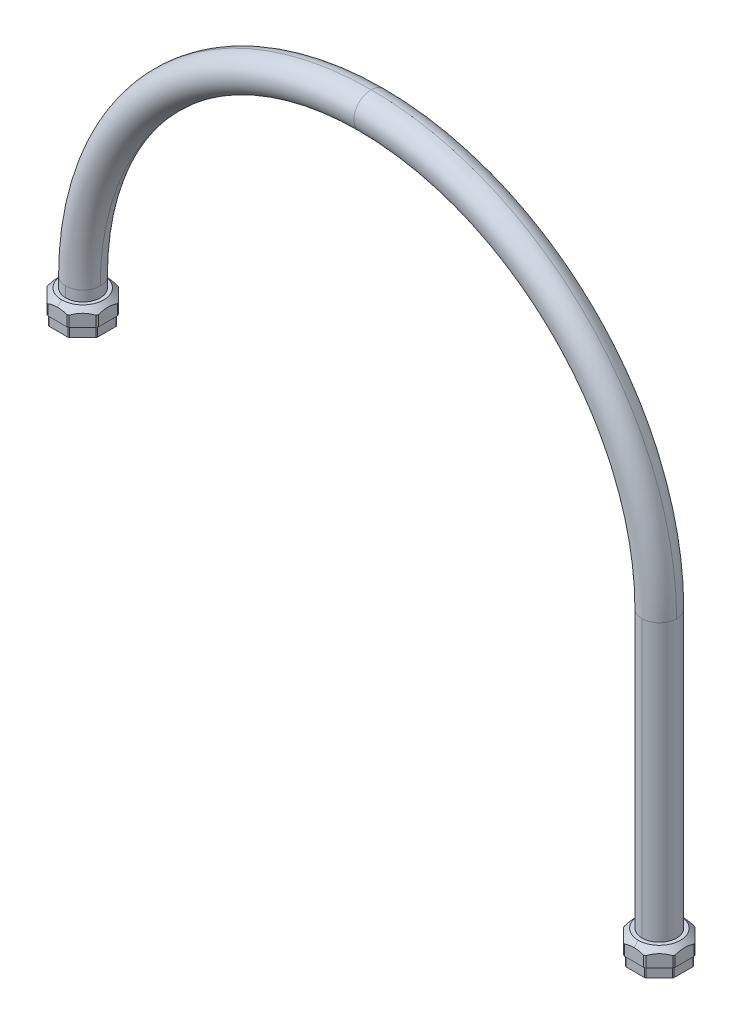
ISO-10303-21;
HEADER;
FILE_DESCRIPTION(('STEP AP214'),'2;1');
FILE_NAME('part.step','',(''),(''),'','','');
FILE_SCHEMA(('AUTOMOTIVE_DESIGN { 1 0 10303 214 1 1 1 1 }'));
ENDSEC;
DATA;
#1=APPLICATION_CONTEXT('core data for automotive mechanical design processes');
#2=APPLICATION_PROTOCOL_DEFINITION('international standard','automotive_design',2000,#1);
#3=PRODUCT_CONTEXT('',#1,'mechanical');
#4=PRODUCT('Part','Part','',(#3));
#5=PRODUCT_RELATED_PRODUCT_CATEGORY('part','',(#4));
#6=PRODUCT_DEFINITION_FORMATION('','',#4);
#7=PRODUCT_DEFINITION_CONTEXT('part definition',#1,'design');
#8=PRODUCT_DEFINITION('design','',#6,#7);
#9=PRODUCT_DEFINITION_SHAPE('','',#8);
#10=(LENGTH_UNIT() NAMED_UNIT(*) SI_UNIT(.MILLI.,.METRE.));
#11=(NAMED_UNIT(*) PLANE_ANGLE_UNIT() SI_UNIT($,.RADIAN.));
#12=(NAMED_UNIT(*) SI_UNIT($,.STERADIAN.) SOLID_ANGLE_UNIT());
#13=UNCERTAINTY_MEASURE_WITH_UNIT(LENGTH_MEASURE(1.E-05),#10,'distance_accuracy_value','');
#14=(GEOMETRIC_REPRESENTATION_CONTEXT(3) GLOBAL_UNCERTAINTY_ASSIGNED_CONTEXT((#13)) GLOBAL_UNIT_ASSIGNED_CONTEXT((#10,
#11,#12)) REPRESENTATION_CONTEXT('',''));
#15=CARTESIAN_POINT('',(0.,0.,0.));
#16=DIRECTION('',(0.,0.,1.));
#17=DIRECTION('',(1.,0.,0.));
#18=AXIS2_PLACEMENT_3D('',#15,#16,#17);
#19=CARTESIAN_POINT('',(-534.299,268.19,0.));
#20=DIRECTION('',(0.,-1.,0.));
#21=DIRECTION('',(0.,0.,-1.));
#22=AXIS2_PLACEMENT_3D('',#19,#20,#21);
#23=CONICAL_SURFACE('',#22,22.25,0.7853981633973);
#24=CARTESIAN_POINT('',(-534.299,265.44,0.));
#25=DIRECTION('',(0.,1.,0.));
#26=DIRECTION('',(0.936,0.,-0.352));
#27=AXIS2_PLACEMENT_3D('',#24,#25,#26);
#28=CIRCLE('',#27,25.);
#29=CARTESIAN_POINT('',(-510.899,265.44,-8.8));
#30=VERTEX_POINT('',#29);
#31=CARTESIAN_POINT('',(-511.5301616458,265.44,-10.32375900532));
#32=VERTEX_POINT('',#31);
#33=EDGE_CURVE('E10',#30,#32,#28,.T.);
#34=ORIENTED_EDGE('',*,*,#33,.T.);
#35=CARTESIAN_POINT('',(-511.5301616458,265.44,-10.32375900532));
#36=CARTESIAN_POINT('',(-511.6662158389,265.5077282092,-10.45981319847));
#37=CARTESIAN_POINT('',(-511.9375833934,265.6389133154,-10.73118075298));
#38=CARTESIAN_POINT('',(-512.341284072,265.8223515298,-11.13488143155));
#39=CARTESIAN_POINT('',(-512.7450624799,265.9938504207,-11.53865983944));
#40=CARTESIAN_POINT('',(-513.1443550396,266.1514040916,-11.93795239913));
#41=CARTESIAN_POINT('',(-513.5407129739,266.2957625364,-12.33431033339));
#42=CARTESIAN_POINT('',(-513.9327955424,266.4265164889,-12.72639290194));
#43=CARTESIAN_POINT('',(-514.3197908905,266.5436629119,-13.11338825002));
#44=CARTESIAN_POINT('',(-514.7039443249,266.6480891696,-13.4975416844));
#45=CARTESIAN_POINT('',(-515.0871858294,266.7403263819,-13.8807831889));
#46=CARTESIAN_POINT('',(-515.4706037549,266.8205256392,-14.2642011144));
#47=CARTESIAN_POINT('',(-515.8547125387,266.8886186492,-14.64830989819));
#48=CARTESIAN_POINT('',(-516.2386172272,266.9443030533,-15.03221458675));
#49=CARTESIAN_POINT('',(-516.6207467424,266.9873578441,-15.41434410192));
#50=CARTESIAN_POINT('',(-517.0002859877,267.0178551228,-15.79388334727));
#51=CARTESIAN_POINT('',(-517.3781693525,267.0360289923,-16.17176671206));
#52=CARTESIAN_POINT('',(-517.7546839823,267.0420219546,-16.54828134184));
#53=CARTESIAN_POINT('',(-518.1319665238,267.0358820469,-16.92556388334));
#54=CARTESIAN_POINT('',(-518.5095245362,267.0175631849,-17.30312189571));
#55=CARTESIAN_POINT('',(-518.8883681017,266.9869918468,-17.6819654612));
#56=CARTESIAN_POINT('',(-519.2699515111,266.9438902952,-18.06354887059));
#57=CARTESIAN_POINT('',(-519.6536084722,266.8881460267,-18.44720583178));
#58=CARTESIAN_POINT('',(-520.0376857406,266.8199697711,-18.83128310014));
#59=CARTESIAN_POINT('',(-520.4216095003,266.7395697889,-19.21520685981));
#60=CARTESIAN_POINT('',(-520.8055907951,266.6470373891,-19.5991881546));
#61=CARTESIAN_POINT('',(-521.1906112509,266.5422354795,-19.98420861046));
#62=CARTESIAN_POINT('',(-521.5785089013,266.4246427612,-20.37210626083));
#63=CARTESIAN_POINT('',(-521.9707273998,266.2936535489,-20.76432475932));
#64=CARTESIAN_POINT('',(-522.3667392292,266.1492332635,-21.16033658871));
#65=CARTESIAN_POINT('',(-522.7645564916,265.9921054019,-21.55815385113));
#66=CARTESIAN_POINT('',(-523.1667035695,265.8211975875,-21.96030092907));
#67=CARTESIAN_POINT('',(-523.5687036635,265.6384848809,-22.36230102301));
#68=CARTESIAN_POINT('',(-523.8394309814,265.5076066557,-22.6330283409));
#69=CARTESIAN_POINT('',(-523.9752409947,265.44,-22.76883835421));
#70=(BOUNDED_CURVE() B_SPLINE_CURVE(3,(#35,#36,#37,#38,#39,#40,#41,#42,#43,#44,#45,#46,#47,#48,
#49,#50,#51,#52,#53,#54,#55,#56,#57,#58,#59,#60,#61,#62,#63,#64,#65,#66,#67,#68,#69),
.UNSPECIFIED.,.F.,.F.) B_SPLINE_CURVE_WITH_KNOTS((4,1,1,1,1,1,1,1,1,1,1,1,1,1,1,1,1,1,1,1,1,1,1,
1,1,1,1,1,1,1,1,1,4),(0.,0.03125,0.0625,0.09375,0.125,0.15625,0.1875,0.21875,0.25,0.28125,
0.3125,0.34375,0.375,0.40625,0.4375,0.46875,0.5,0.53125,0.5625,0.59375,0.625,0.65625,0.6875,
0.71875,0.75,0.78125,0.8125,0.84375,0.875,0.90625,0.9375,0.96875,1.),
.UNSPECIFIED.) CURVE() GEOMETRIC_REPRESENTATION_ITEM() RATIONAL_B_SPLINE_CURVE((1.,1.,1.,1.,1.,
1.,1.,1.,1.,1.,1.,1.,1.,1.,1.,1.,1.,1.,1.,1.,1.,1.,1.,1.,1.,1.,1.,1.,1.,1.,1.,1.,1.,1.,1.)) REPRESENTATION_ITEM(''));
#71=CARTESIAN_POINT('',(-523.9752409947,265.44,-22.76883835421));
#72=VERTEX_POINT('',#71);
#73=EDGE_CURVE('E26',#32,#72,#70,.T.);
#74=ORIENTED_EDGE('',*,*,#73,.T.);
#75=CARTESIAN_POINT('',(-534.299,265.44,0.));
#76=DIRECTION('',(0.,1.,0.));
#77=DIRECTION('',(0.412950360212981,0.,-0.910753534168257));
#78=AXIS2_PLACEMENT_3D('',#75,#76,#77);
#79=CIRCLE('',#78,25.);
#80=CARTESIAN_POINT('',(-525.499,265.44,-23.4));
#81=VERTEX_POINT('',#80);
#82=EDGE_CURVE('E1082',#72,#81,#79,.T.);
#83=ORIENTED_EDGE('',*,*,#82,.T.);
#84=CARTESIAN_POINT('',(-525.499,265.44,-23.4));
#85=CARTESIAN_POINT('',(-525.6889032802,265.5068459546,-23.4));
#86=CARTESIAN_POINT('',(-526.0680594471,265.6365181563,-23.4));
#87=CARTESIAN_POINT('',(-526.6350880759,265.8188894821,-23.4));
#88=CARTESIAN_POINT('',(-527.1998679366,265.9888076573,-23.4));
#89=CARTESIAN_POINT('',(-527.761871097,266.1460349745,-23.4));
#90=CARTESIAN_POINT('',(-528.3216879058,266.2906569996,-23.4));
#91=CARTESIAN_POINT('',(-528.8779905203,266.422298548,-23.40000000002));
#92=CARTESIAN_POINT('',(-529.4307122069,266.5409712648,-23.39999999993));
#93=CARTESIAN_POINT('',(-529.9797455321,266.6467606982,-23.40000000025));
#94=CARTESIAN_POINT('',(-530.5313117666,266.7406889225,-23.39999999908));
#95=CARTESIAN_POINT('',(-531.0772865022,266.8213069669,-23.40000000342));
#96=CARTESIAN_POINT('',(-531.6199954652,266.8891876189,-23.39999998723));
#97=CARTESIAN_POINT('',(-532.1592790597,266.9444118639,-23.40000004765));
#98=CARTESIAN_POINT('',(-532.6968070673,266.9872518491,-23.39999982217));
#99=CARTESIAN_POINT('',(-533.2322752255,267.0177194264,-23.40000066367));
#100=CARTESIAN_POINT('',(-533.7649216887,267.0359327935,-23.39999752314));
#101=CARTESIAN_POINT('',(-534.1209724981,267.0399893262,-23.40000533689));
#102=CARTESIAN_POINT('',(-534.2989999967,267.0399893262,-23.40000533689));
#103=(BOUNDED_CURVE() B_SPLINE_CURVE(3,(#84,#85,#86,#87,#88,#89,#90,#91,#92,#93,#94,#95,#96,#97,
#98,#99,#100,#101,#102),.UNSPECIFIED.,.F.,.F.) B_SPLINE_CURVE_WITH_KNOTS((4,1,1,1,1,1,1,1,1,1,1,
1,1,1,1,1,4),(0.,0.0625,0.125,0.1875,0.25,0.3125,0.375,0.4375,0.5,0.5625,0.625,0.6875,0.75,
0.8125,0.875,0.9375,1.),
.UNSPECIFIED.) CURVE() GEOMETRIC_REPRESENTATION_ITEM() RATIONAL_B_SPLINE_CURVE((1.,1.,1.,1.,1.,
1.,1.,1.,1.,1.,1.,1.,1.,1.,1.,1.,1.,1.,1.)) REPRESENTATION_ITEM(''));
#104=CARTESIAN_POINT('',(-534.2989999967,267.0399893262,-23.40000533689));
#105=VERTEX_POINT('',#104);
#106=EDGE_CURVE('E1086',#81,#105,#103,.T.);
#107=ORIENTED_EDGE('',*,*,#106,.T.);
#108=DIRECTION('',(5.90588019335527E-10,-0.707107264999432,-0.707106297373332));
#109=VECTOR('',#108,1.);
#110=CARTESIAN_POINT('',(-534.299,270.94,-19.5));
#111=LINE('',#110,#109);
#112=CARTESIAN_POINT('',(-534.299,270.94,-19.5));
#113=VERTEX_POINT('',#112);
#114=EDGE_CURVE('E288',#113,#105,#111,.T.);
#115=ORIENTED_EDGE('',*,*,#114,.F.);
#116=CARTESIAN_POINT('',(-534.299,270.94,0.));
#117=DIRECTION('',(0.,1.,0.));
#118=DIRECTION('',(0.,0.,1.));
#119=AXIS2_PLACEMENT_3D('',#116,#117,#118);
#120=CIRCLE('',#119,19.5);
#121=CARTESIAN_POINT('',(-534.299,270.94,19.5));
#122=VERTEX_POINT('',#121);
#123=EDGE_CURVE('E300',#122,#113,#120,.T.);
#124=ORIENTED_EDGE('',*,*,#123,.F.);
#125=DIRECTION('',(-5.90588423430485E-10,-0.707107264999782,0.707106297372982));
#126=VECTOR('',#125,1.);
#127=CARTESIAN_POINT('',(-534.299,270.94,19.5));
#128=LINE('',#127,#126);
#129=CARTESIAN_POINT('',(-534.2990000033,267.0399919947,23.40000266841));
#130=VERTEX_POINT('',#129);
#131=EDGE_CURVE('E1324',#122,#130,#128,.T.);
#132=ORIENTED_EDGE('',*,*,#131,.T.);
#133=CARTESIAN_POINT('',(-534.2990000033,267.0399919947,23.40000266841));
#134=CARTESIAN_POINT('',(-534.2092848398,267.0399919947,23.40000266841));
#135=CARTESIAN_POINT('',(-534.0297432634,267.0389715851,23.39999876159));
#136=CARTESIAN_POINT('',(-533.7601687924,267.0343139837,23.40000033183));
#137=CARTESIAN_POINT('',(-533.4901171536,267.0265434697,23.39999991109));
#138=CARTESIAN_POINT('',(-533.2194320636,267.0156317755,23.40000002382));
#139=CARTESIAN_POINT('',(-532.9479592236,267.0015537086,23.39999999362));
#140=CARTESIAN_POINT('',(-532.6758907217,266.9842994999,23.40000000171));
#141=CARTESIAN_POINT('',(-532.4034044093,266.9638703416,23.39999999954));
#142=CARTESIAN_POINT('',(-532.1306291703,266.9402718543,23.40000000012));
#143=CARTESIAN_POINT('',(-531.8576924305,266.9135168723,23.39999999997));
#144=CARTESIAN_POINT('',(-531.5846675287,266.8836191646,23.40000000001));
#145=CARTESIAN_POINT('',(-531.3116399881,266.8505981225,23.4));
#146=CARTESIAN_POINT('',(-531.0388194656,266.8144952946,23.4));
#147=CARTESIAN_POINT('',(-530.766354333,266.7753553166,23.4));
#148=CARTESIAN_POINT('',(-530.4939705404,266.7331625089,23.4));
#149=CARTESIAN_POINT('',(-530.2214761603,266.6879015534,23.4));
#150=CARTESIAN_POINT('',(-529.9490832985,266.6396242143,23.4));
#151=CARTESIAN_POINT('',(-529.6768915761,266.5883726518,23.4));
#152=CARTESIAN_POINT('',(-529.4047772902,266.534147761,23.4));
#153=CARTESIAN_POINT('',(-529.1325853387,266.4769397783,23.4));
#154=CARTESIAN_POINT('',(-528.8597614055,266.4166428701,23.4));
#155=CARTESIAN_POINT('',(-528.5858558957,266.3531503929,23.4));
#156=CARTESIAN_POINT('',(-528.3109568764,266.2864715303,23.4));
#157=CARTESIAN_POINT('',(-528.0351015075,266.2166090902,23.4));
#158=CARTESIAN_POINT('',(-527.758194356,266.1435324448,23.4));
#159=CARTESIAN_POINT('',(-527.4801516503,266.0672110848,23.4));
#160=CARTESIAN_POINT('',(-527.2009106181,265.9876184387,23.4));
#161=CARTESIAN_POINT('',(-526.9204137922,265.9047279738,23.4));
#162=CARTESIAN_POINT('',(-526.6386790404,265.8185354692,23.4));
#163=CARTESIAN_POINT('',(-526.3557172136,265.7290367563,23.4));
#164=CARTESIAN_POINT('',(-526.0715061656,265.6362183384,23.4));
#165=CARTESIAN_POINT('',(-525.7860181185,265.5400651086,23.4));
#166=CARTESIAN_POINT('',(-525.5948170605,265.4737276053,23.4));
#167=CARTESIAN_POINT('',(-525.499,265.44,23.4));
#168=(BOUNDED_CURVE() B_SPLINE_CURVE(3,(#133,#134,#135,#136,#137,#138,#139,#140,#141,#142,#143,
#144,#145,#146,#147,#148,#149,#150,#151,#152,#153,#154,#155,#156,#157,#158,#159,#160,#161,#162,
#163,#164,#165,#166,#167),.UNSPECIFIED.,.F.,.F.) B_SPLINE_CURVE_WITH_KNOTS((4,1,1,1,1,1,1,1,1,1,
1,1,1,1,1,1,1,1,1,1,1,1,1,1,1,1,1,1,1,1,1,1,4),(0.,0.03125,0.0625,0.09375,0.125,0.15625,0.1875,
0.21875,0.25,0.28125,0.3125,0.34375,0.375,0.40625,0.4375,0.46875,0.5,0.53125,0.5625,0.59375,
0.625,0.65625,0.6875,0.71875,0.75,0.78125,0.8125,0.84375,0.875,0.90625,0.9375,0.96875,1.),
.UNSPECIFIED.) CURVE() GEOMETRIC_REPRESENTATION_ITEM() RATIONAL_B_SPLINE_CURVE((1.,1.,1.,1.,1.,
1.,1.,1.,1.,1.,1.,1.,1.,1.,1.,1.,1.,1.,1.,1.,1.,1.,1.,1.,1.,1.,1.,1.,1.,1.,1.,1.,1.,1.,1.)) REPRESENTATION_ITEM(''));
#169=CARTESIAN_POINT('',(-525.499,265.44,23.4));
#170=VERTEX_POINT('',#169);
#171=EDGE_CURVE('E1319',#130,#170,#168,.T.);
#172=ORIENTED_EDGE('',*,*,#171,.T.);
#173=CARTESIAN_POINT('',(-534.299,265.44,0.));
#174=DIRECTION('',(0.,1.,0.));
#175=DIRECTION('',(0.352,0.,0.936));
#176=AXIS2_PLACEMENT_3D('',#173,#174,#175);
#177=CIRCLE('',#176,25.);
#178=CARTESIAN_POINT('',(-523.9752409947,265.44,22.76883835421));
#179=VERTEX_POINT('',#178);
#180=EDGE_CURVE('E1325',#170,#179,#177,.T.);
#181=ORIENTED_EDGE('',*,*,#180,.T.);
#182=CARTESIAN_POINT('',(-523.9752409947,265.44,22.76883835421));
#183=CARTESIAN_POINT('',(-523.8391868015,265.5077282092,22.63278416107));
#184=CARTESIAN_POINT('',(-523.567819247,265.6389133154,22.36141660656));
#185=CARTESIAN_POINT('',(-523.1641185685,265.8223515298,21.95771592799));
#186=CARTESIAN_POINT('',(-522.7603401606,265.9938504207,21.55393752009));
#187=CARTESIAN_POINT('',(-522.3610476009,266.1514040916,21.1546449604));
#188=CARTESIAN_POINT('',(-521.9646896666,266.2957625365,20.75828702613));
#189=CARTESIAN_POINT('',(-521.572607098,266.4265164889,20.36620445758));
#190=CARTESIAN_POINT('',(-521.18561175,266.5436629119,19.97920910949));
#191=CARTESIAN_POINT('',(-520.8014583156,266.6480891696,19.59505567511));
#192=CARTESIAN_POINT('',(-520.4182168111,266.7403263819,19.21181417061));
#193=CARTESIAN_POINT('',(-520.0347988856,266.8205256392,18.82839624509));
#194=CARTESIAN_POINT('',(-519.6506901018,266.8886186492,18.44428746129));
#195=CARTESIAN_POINT('',(-519.2667854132,266.9443030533,18.06038277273));
#196=CARTESIAN_POINT('',(-518.884655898,266.9873578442,17.67825325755));
#197=CARTESIAN_POINT('',(-518.5051166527,267.0178551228,17.2987140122));
#198=CARTESIAN_POINT('',(-518.1272332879,267.0360289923,16.92083064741));
#199=CARTESIAN_POINT('',(-517.7507186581,267.0420219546,16.54431601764));
#200=CARTESIAN_POINT('',(-517.3734361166,267.0358820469,16.16703347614));
#201=CARTESIAN_POINT('',(-516.9958781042,267.0175631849,15.78947546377));
#202=CARTESIAN_POINT('',(-516.6170345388,266.9869918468,15.41063189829));
#203=CARTESIAN_POINT('',(-516.2354511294,266.9438902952,15.0290484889));
#204=CARTESIAN_POINT('',(-515.8517941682,266.8881460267,14.64539152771));
#205=CARTESIAN_POINT('',(-515.4677168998,266.8199697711,14.26131425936));
#206=CARTESIAN_POINT('',(-515.0837931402,266.7395697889,13.87739049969));
#207=CARTESIAN_POINT('',(-514.6998118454,266.6470373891,13.4934092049));
#208=CARTESIAN_POINT('',(-514.3147913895,266.5422354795,13.10838874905));
#209=CARTESIAN_POINT('',(-513.9268937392,266.4246427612,12.72049109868));
#210=CARTESIAN_POINT('',(-513.5346752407,266.2936535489,12.32827260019));
#211=CARTESIAN_POINT('',(-513.1386634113,266.1492332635,11.93226077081));
#212=CARTESIAN_POINT('',(-512.7408461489,265.9921054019,11.5344435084));
#213=CARTESIAN_POINT('',(-512.3386990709,265.8211975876,11.13229643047));
#214=CARTESIAN_POINT('',(-511.936698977,265.6384848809,10.73029633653));
#215=CARTESIAN_POINT('',(-511.6659716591,265.5076066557,10.45956901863));
#216=CARTESIAN_POINT('',(-511.5301616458,265.44,10.32375900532));
#217=(BOUNDED_CURVE() B_SPLINE_CURVE(3,(#182,#183,#184,#185,#186,#187,#188,#189,#190,#191,#192,
#193,#194,#195,#196,#197,#198,#199,#200,#201,#202,#203,#204,#205,#206,#207,#208,#209,#210,#211,
#212,#213,#214,#215,#216),.UNSPECIFIED.,.F.,.F.) B_SPLINE_CURVE_WITH_KNOTS((4,1,1,1,1,1,1,1,1,1,
1,1,1,1,1,1,1,1,1,1,1,1,1,1,1,1,1,1,1,1,1,1,4),(0.,0.03125,0.0625,0.09375,0.125,0.15625,0.1875,
0.21875,0.25,0.28125,0.3125,0.34375,0.375,0.40625,0.4375,0.46875,0.5,0.53125,0.5625,0.59375,
0.625,0.65625,0.6875,0.71875,0.75,0.78125,0.8125,0.84375,0.875,0.90625,0.9375,0.96875,1.),
.UNSPECIFIED.) CURVE() GEOMETRIC_REPRESENTATION_ITEM() RATIONAL_B_SPLINE_CURVE((1.,1.,1.,1.,1.,
1.,1.,1.,1.,1.,1.,1.,1.,1.,1.,1.,1.,1.,1.,1.,1.,1.,1.,1.,1.,1.,1.,1.,1.,1.,1.,1.,1.,1.,1.)) REPRESENTATION_ITEM(''));
#218=CARTESIAN_POINT('',(-511.5301616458,265.44,10.32375900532));
#219=VERTEX_POINT('',#218);
#220=EDGE_CURVE('E1126',#179,#219,#217,.T.);
#221=ORIENTED_EDGE('',*,*,#220,.T.);
#222=CARTESIAN_POINT('',(-534.299,265.44,0.));
#223=DIRECTION('',(0.,1.,0.));
#224=DIRECTION('',(0.910753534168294,0.,0.412950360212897));
#225=AXIS2_PLACEMENT_3D('',#222,#223,#224);
#226=CIRCLE('',#225,25.);
#227=CARTESIAN_POINT('',(-510.899,265.44,8.8));
#228=VERTEX_POINT('',#227);
#229=EDGE_CURVE('E1122',#219,#228,#226,.T.);
#230=ORIENTED_EDGE('',*,*,#229,.T.);
#231=CARTESIAN_POINT('',(-510.899,265.44,8.8));
#232=CARTESIAN_POINT('',(-510.899,265.4744314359,8.702183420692));
#233=CARTESIAN_POINT('',(-510.899,265.5420995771,8.50708579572));
#234=CARTESIAN_POINT('',(-510.899,265.6399940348,8.216159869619));
#235=CARTESIAN_POINT('',(-510.899,265.7344030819,7.926630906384));
#236=CARTESIAN_POINT('',(-510.899,265.825403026,7.63828144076));
#237=CARTESIAN_POINT('',(-510.899,265.9130664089,7.350881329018));
#238=CARTESIAN_POINT('',(-510.899,265.9974275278,7.064302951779));
#239=CARTESIAN_POINT('',(-510.899,266.0785129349,6.778430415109));
#240=CARTESIAN_POINT('',(-510.899,266.1562944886,6.493337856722));
#241=CARTESIAN_POINT('',(-510.899,266.2307538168,6.209081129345));
#242=CARTESIAN_POINT('',(-510.899,266.3018869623,5.925671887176));
#243=CARTESIAN_POINT('',(-510.899,266.3696869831,5.643139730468));
#244=CARTESIAN_POINT('',(-510.899,266.4341109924,5.361686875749));
#245=CARTESIAN_POINT('',(-510.899,266.495140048,5.081457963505));
#246=CARTESIAN_POINT('',(-510.899,266.5528230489,4.802297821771));
#247=CARTESIAN_POINT('',(-510.899,266.6071969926,4.524078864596));
#248=CARTESIAN_POINT('',(-510.899,266.6582785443,4.246765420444));
#249=CARTESIAN_POINT('',(-510.899,266.7060922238,3.970274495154));
#250=CARTESIAN_POINT('',(-510.899,266.7506599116,3.69452336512));
#251=CARTESIAN_POINT('',(-510.899,266.7920034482,3.419414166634));
#252=CARTESIAN_POINT('',(-510.899,266.8301474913,3.144803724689));
#253=CARTESIAN_POINT('',(-510.899,266.865106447,2.870586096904));
#254=CARTESIAN_POINT('',(-510.899,266.8968791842,2.596765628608));
#255=CARTESIAN_POINT('',(-510.899,266.9254689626,2.323320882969));
#256=CARTESIAN_POINT('',(-510.899,266.9508810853,2.050208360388));
#257=CARTESIAN_POINT('',(-510.899,266.97311989,1.777387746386));
#258=CARTESIAN_POINT('',(-510.899,266.9921899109,1.504807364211));
#259=CARTESIAN_POINT('',(-510.899,267.0080920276,1.232452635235));
#260=CARTESIAN_POINT('',(-510.899,267.0208222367,0.960454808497));
#261=CARTESIAN_POINT('',(-510.899,267.0303926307,0.6887090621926));
#262=CARTESIAN_POINT('',(-510.899,267.0368172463,0.416721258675));
#263=CARTESIAN_POINT('',(-510.899,267.0400851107,0.1442487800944));
#264=CARTESIAN_POINT('',(-510.899,267.040177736,-0.1287194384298));
#265=CARTESIAN_POINT('',(-510.899,267.0370768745,-0.4022138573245));
#266=CARTESIAN_POINT('',(-510.899,267.0307688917,-0.6761094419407));
#267=CARTESIAN_POINT('',(-510.899,267.0212397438,-0.9505036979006));
#268=CARTESIAN_POINT('',(-510.899,267.0084589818,-1.225711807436));
#269=CARTESIAN_POINT('',(-510.899,266.9924048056,-1.50168448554));
#270=CARTESIAN_POINT('',(-510.899,266.9730770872,-1.778156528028));
#271=CARTESIAN_POINT('',(-510.899,266.9504786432,-2.054991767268));
#272=CARTESIAN_POINT('',(-510.899,266.924616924,-2.332080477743));
#273=CARTESIAN_POINT('',(-510.899,266.8955049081,-2.609322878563));
#274=CARTESIAN_POINT('',(-510.899,266.8631588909,-2.886639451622));
#275=CARTESIAN_POINT('',(-510.899,266.8276114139,-3.163862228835));
#276=CARTESIAN_POINT('',(-510.899,266.788917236,-3.440741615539));
#277=CARTESIAN_POINT('',(-510.899,266.7470796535,-3.717442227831));
#278=CARTESIAN_POINT('',(-510.899,266.7020668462,-3.994283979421));
#279=CARTESIAN_POINT('',(-510.899,266.6539134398,-4.271138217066));
#280=CARTESIAN_POINT('',(-510.899,266.6026823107,-4.547778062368));
#281=CARTESIAN_POINT('',(-510.899,266.5483744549,-4.824336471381));
#282=CARTESIAN_POINT('',(-510.899,266.4909867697,-5.100942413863));
#283=CARTESIAN_POINT('',(-510.899,266.4304131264,-5.378168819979));
#284=CARTESIAN_POINT('',(-510.899,266.3664984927,-5.656678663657));
#285=CARTESIAN_POINT('',(-510.899,266.2992599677,-5.936320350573));
#286=CARTESIAN_POINT('',(-510.899,266.2287483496,-6.216855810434));
#287=CARTESIAN_POINT('',(-510.899,266.1549193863,-6.498444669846));
#288=CARTESIAN_POINT('',(-510.899,266.0777156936,-6.781268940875));
#289=CARTESIAN_POINT('',(-510.899,265.9970918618,-7.065448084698));
#290=CARTESIAN_POINT('',(-510.899,265.9129970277,-7.35110584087));
#291=CARTESIAN_POINT('',(-510.899,265.8254421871,-7.638153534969));
#292=CARTESIAN_POINT('',(-510.899,265.7344500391,-7.926485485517));
#293=CARTESIAN_POINT('',(-510.899,265.6399964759,-8.216154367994));
#294=CARTESIAN_POINT('',(-510.899,265.5420547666,-8.50721726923));
#295=CARTESIAN_POINT('',(-510.899,265.4744097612,-8.70224499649));
#296=CARTESIAN_POINT('',(-510.899,265.44,-8.8));
#297=(BOUNDED_CURVE() B_SPLINE_CURVE(3,(#231,#232,#233,#234,#235,#236,#237,#238,#239,#240,#241,
#242,#243,#244,#245,#246,#247,#248,#249,#250,#251,#252,#253,#254,#255,#256,#257,#258,#259,#260,
#261,#262,#263,#264,#265,#266,#267,#268,#269,#270,#271,#272,#273,#274,#275,#276,#277,#278,#279,
#280,#281,#282,#283,#284,#285,#286,#287,#288,#289,#290,#291,#292,#293,#294,#295,#296),
.UNSPECIFIED.,.F.,.F.) B_SPLINE_CURVE_WITH_KNOTS((4,1,1,1,1,1,1,1,1,1,1,1,1,1,1,1,1,1,1,1,1,1,1,
1,1,1,1,1,1,1,1,1,1,1,1,1,1,1,1,1,1,1,1,1,1,1,1,1,1,1,1,1,1,1,1,1,1,1,1,1,1,1,1,4),(0.,
0.01587301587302,0.03174603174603,0.04761904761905,0.06349206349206,0.07936507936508,
0.0952380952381,0.1111111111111,0.1269841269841,0.1428571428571,0.1587301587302,0.1746031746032,
0.1904761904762,0.2063492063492,0.2222222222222,0.2380952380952,0.2539682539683,0.2698412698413,
0.2857142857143,0.3015873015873,0.3174603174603,0.3333333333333,0.3492063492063,0.3650793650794,
0.3809523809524,0.3968253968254,0.4126984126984,0.4285714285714,0.4444444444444,0.4603174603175,
0.4761904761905,0.4920634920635,0.5079365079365,0.5238095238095,0.5396825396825,0.5555555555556,
0.5714285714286,0.5873015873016,0.6031746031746,0.6190476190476,0.6349206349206,0.6507936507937,
0.6666666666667,0.6825396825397,0.6984126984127,0.7142857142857,0.7301587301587,0.7460317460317,
0.7619047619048,0.7777777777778,0.7936507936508,0.8095238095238,0.8253968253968,0.8412698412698,
0.8571428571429,0.8730158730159,0.8888888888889,0.9047619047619,0.9206349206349,0.9365079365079,
0.952380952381,0.968253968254,0.984126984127,1.),
.UNSPECIFIED.) CURVE() GEOMETRIC_REPRESENTATION_ITEM() RATIONAL_B_SPLINE_CURVE((1.,1.,1.,1.,1.,
1.,1.,1.,1.,1.,1.,1.,1.,1.,1.,1.,1.,1.,1.,1.,1.,1.,1.,1.,1.,1.,1.,1.,1.,1.,1.,1.,1.,1.,1.,1.,1.,
1.,1.,1.,1.,1.,1.,1.,1.,1.,1.,1.,1.,1.,1.,1.,1.,1.,1.,1.,1.,1.,1.,1.,1.,1.,1.,1.,1.,1.)) REPRESENTATION_ITEM(''));
#298=EDGE_CURVE('E1127',#228,#30,#297,.T.);
#299=ORIENTED_EDGE('',*,*,#298,.T.);
#300=EDGE_LOOP('',(#34,#74,#83,#107,#115,#124,#132,#172,#181,#221,#230,#299));
#301=FACE_BOUND('',#300,.T.);
#302=ADVANCED_FACE('F15',(#301),#23,.T.);
#303=CARTESIAN_POINT('',(-510.899,255.64,9.69259735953));
#304=DIRECTION('',(1.,0.,0.));
#305=DIRECTION('',(0.,1.,0.));
#306=AXIS2_PLACEMENT_3D('',#303,#304,#305);
#307=PLANE('',#306);
#308=DIRECTION('',(0.,0.,1.));
#309=VECTOR('',#308,1.);
#310=CARTESIAN_POINT('',(-510.899,255.64,-8.8));
#311=LINE('',#310,#309);
#312=CARTESIAN_POINT('',(-510.899,255.64,-8.8));
#313=VERTEX_POINT('',#312);
#314=CARTESIAN_POINT('',(-510.899,255.64,8.8));
#315=VERTEX_POINT('',#314);
#316=EDGE_CURVE('E1047',#313,#315,#311,.T.);
#317=ORIENTED_EDGE('',*,*,#316,.F.);
#318=DIRECTION('',(0.,-1.,0.));
#319=VECTOR('',#318,1.);
#320=CARTESIAN_POINT('',(-510.899,265.44,-8.8));
#321=LINE('',#320,#319);
#322=EDGE_CURVE('E1216',#30,#313,#321,.T.);
#323=ORIENTED_EDGE('',*,*,#322,.F.);
#324=ORIENTED_EDGE('',*,*,#298,.F.);
#325=DIRECTION('',(0.,1.,0.));
#326=VECTOR('',#325,1.);
#327=CARTESIAN_POINT('',(-510.899,255.64,8.8));
#328=LINE('',#327,#326);
#329=EDGE_CURVE('E1038',#315,#228,#328,.T.);
#330=ORIENTED_EDGE('',*,*,#329,.F.);
#331=EDGE_LOOP('',(#317,#323,#324,#330));
#332=FACE_BOUND('',#331,.T.);
#333=ADVANCED_FACE('F1775',(#332),#307,.T.);
#334=CARTESIAN_POINT('',(-534.299,246.701,0.));
#335=DIRECTION('',(0.,-1.,0.));
#336=DIRECTION('',(0.,0.,-1.));
#337=AXIS2_PLACEMENT_3D('',#334,#335,#336);
#338=CYLINDRICAL_SURFACE('',#337,25.);
#339=ORIENTED_EDGE('',*,*,#229,.F.);
#340=DIRECTION('',(0.,-1.,0.));
#341=VECTOR('',#340,1.);
#342=CARTESIAN_POINT('',(-511.5301616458,265.44,10.32375900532));
#343=LINE('',#342,#341);
#344=CARTESIAN_POINT('',(-511.5301616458,255.64,10.32375900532));
#345=VERTEX_POINT('',#344);
#346=EDGE_CURVE('E1045',#219,#345,#343,.T.);
#347=ORIENTED_EDGE('',*,*,#346,.T.);
#348=CARTESIAN_POINT('',(-534.299,255.64,0.));
#349=DIRECTION('',(0.,-1.,0.));
#350=DIRECTION('',(0.936,0.,0.352));
#351=AXIS2_PLACEMENT_3D('',#348,#349,#350);
#352=CIRCLE('',#351,25.);
#353=EDGE_CURVE('E1051',#315,#345,#352,.T.);
#354=ORIENTED_EDGE('',*,*,#353,.F.);
#355=ORIENTED_EDGE('',*,*,#329,.T.);
#356=EDGE_LOOP('',(#339,#347,#354,#355));
#357=FACE_BOUND('',#356,.T.);
#358=ADVANCED_FACE('F1781',(#357),#338,.T.);
#359=CARTESIAN_POINT('',(-509.299,255.64,0.));
#360=DIRECTION('',(0.,1.,0.));
#361=DIRECTION('',(1.,0.,0.));
#362=AXIS2_PLACEMENT_3D('',#359,#360,#361);
#363=PLANE('',#362);
#364=CARTESIAN_POINT('',(-534.299,255.64,0.));
#365=DIRECTION('',(0.,-1.,0.));
#366=DIRECTION('',(-0.412950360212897,0.,-0.910753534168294));
#367=AXIS2_PLACEMENT_3D('',#364,#365,#366);
#368=CIRCLE('',#367,25.);
#369=CARTESIAN_POINT('',(-544.6227590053,255.64,-22.76883835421));
#370=VERTEX_POINT('',#369);
#371=CARTESIAN_POINT('',(-543.099,255.64,-23.4));
#372=VERTEX_POINT('',#371);
#373=EDGE_CURVE('E1046',#370,#372,#368,.T.);
#374=ORIENTED_EDGE('',*,*,#373,.T.);
#375=DIRECTION('',(1.,0.,0.));
#376=VECTOR('',#375,1.);
#377=CARTESIAN_POINT('',(-543.099,255.64,-23.4));
#378=LINE('',#377,#376);
#379=CARTESIAN_POINT('',(-525.499,255.64,-23.4));
#380=VERTEX_POINT('',#379);
#381=EDGE_CURVE('E1192',#372,#380,#378,.T.);
#382=ORIENTED_EDGE('',*,*,#381,.T.);
#383=CARTESIAN_POINT('',(-534.299,255.64,0.));
#384=DIRECTION('',(0.,-1.,0.));
#385=DIRECTION('',(0.352,0.,-0.936));
#386=AXIS2_PLACEMENT_3D('',#383,#384,#385);
#387=CIRCLE('',#386,25.);
#388=CARTESIAN_POINT('',(-523.9752409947,255.64,-22.76883835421));
#389=VERTEX_POINT('',#388);
#390=EDGE_CURVE('E1221',#380,#389,#387,.T.);
#391=ORIENTED_EDGE('',*,*,#390,.T.);
#392=DIRECTION('',(0.707106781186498,0.,0.707106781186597));
#393=VECTOR('',#392,1.);
#394=CARTESIAN_POINT('',(-523.9752409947,255.64,-22.76883835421));
#395=LINE('',#394,#393);
#396=CARTESIAN_POINT('',(-511.5301616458,255.64,-10.32375900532));
#397=VERTEX_POINT('',#396);
#398=EDGE_CURVE('E1225',#389,#397,#395,.T.);
#399=ORIENTED_EDGE('',*,*,#398,.T.);
#400=CARTESIAN_POINT('',(-534.299,255.64,0.));
#401=DIRECTION('',(0.,-1.,0.));
#402=DIRECTION('',(0.910753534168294,0.,-0.412950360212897));
#403=AXIS2_PLACEMENT_3D('',#400,#401,#402);
#404=CIRCLE('',#403,25.);
#405=EDGE_CURVE('E1050',#397,#313,#404,.T.);
#406=ORIENTED_EDGE('',*,*,#405,.T.);
#407=ORIENTED_EDGE('',*,*,#316,.T.);
#408=ORIENTED_EDGE('',*,*,#353,.T.);
#409=DIRECTION('',(-0.707106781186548,0.,0.707106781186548));
#410=VECTOR('',#409,1.);
#411=CARTESIAN_POINT('',(-511.5301616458,255.64,10.32375900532));
#412=LINE('',#411,#410);
#413=CARTESIAN_POINT('',(-523.9752409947,255.64,22.76883835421));
#414=VERTEX_POINT('',#413);
#415=EDGE_CURVE('E1212',#345,#414,#412,.T.);
#416=ORIENTED_EDGE('',*,*,#415,.T.);
#417=CARTESIAN_POINT('',(-534.299,255.64,0.));
#418=DIRECTION('',(0.,-1.,0.));
#419=DIRECTION('',(0.412950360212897,0.,0.910753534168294));
#420=AXIS2_PLACEMENT_3D('',#417,#418,#419);
#421=CIRCLE('',#420,25.);
#422=CARTESIAN_POINT('',(-525.499,255.64,23.4));
#423=VERTEX_POINT('',#422);
#424=EDGE_CURVE('E895',#414,#423,#421,.T.);
#425=ORIENTED_EDGE('',*,*,#424,.T.);
#426=DIRECTION('',(-1.,0.,0.));
#427=VECTOR('',#426,1.);
#428=CARTESIAN_POINT('',(-525.499,255.64,23.4));
#429=LINE('',#428,#427);
#430=CARTESIAN_POINT('',(-543.099,255.64,23.4));
#431=VERTEX_POINT('',#430);
#432=EDGE_CURVE('E891',#423,#431,#429,.T.);
#433=ORIENTED_EDGE('',*,*,#432,.T.);
#434=CARTESIAN_POINT('',(-534.299,255.64,0.));
#435=DIRECTION('',(0.,-1.,0.));
#436=DIRECTION('',(-0.352,0.,0.936));
#437=AXIS2_PLACEMENT_3D('',#434,#435,#436);
#438=CIRCLE('',#437,25.);
#439=CARTESIAN_POINT('',(-544.6227590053,255.64,22.76883835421));
#440=VERTEX_POINT('',#439);
#441=EDGE_CURVE('E896',#431,#440,#438,.T.);
#442=ORIENTED_EDGE('',*,*,#441,.T.);
#443=DIRECTION('',(-0.707106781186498,0.,-0.707106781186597));
#444=VECTOR('',#443,1.);
#445=CARTESIAN_POINT('',(-544.6227590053,255.64,22.76883835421));
#446=LINE('',#445,#444);
#447=CARTESIAN_POINT('',(-557.0678383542,255.64,10.32375900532));
#448=VERTEX_POINT('',#447);
#449=EDGE_CURVE('E967',#440,#448,#446,.T.);
#450=ORIENTED_EDGE('',*,*,#449,.T.);
#451=CARTESIAN_POINT('',(-534.299,255.64,0.));
#452=DIRECTION('',(0.,-1.,0.));
#453=DIRECTION('',(-0.910753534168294,0.,0.412950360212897));
#454=AXIS2_PLACEMENT_3D('',#451,#452,#453);
#455=CIRCLE('',#454,25.);
#456=CARTESIAN_POINT('',(-557.699,255.64,8.8));
#457=VERTEX_POINT('',#456);
#458=EDGE_CURVE('E1151',#448,#457,#455,.T.);
#459=ORIENTED_EDGE('',*,*,#458,.T.);
#460=DIRECTION('',(0.,0.,-1.));
#461=VECTOR('',#460,1.);
#462=CARTESIAN_POINT('',(-557.699,255.64,8.8));
#463=LINE('',#462,#461);
#464=CARTESIAN_POINT('',(-557.699,255.64,-8.8));
#465=VERTEX_POINT('',#464);
#466=EDGE_CURVE('E831',#457,#465,#463,.T.);
#467=ORIENTED_EDGE('',*,*,#466,.T.);
#468=CARTESIAN_POINT('',(-534.299,255.64,0.));
#469=DIRECTION('',(0.,-1.,0.));
#470=DIRECTION('',(-0.936,0.,-0.352));
#471=AXIS2_PLACEMENT_3D('',#468,#469,#470);
#472=CIRCLE('',#471,25.);
#473=CARTESIAN_POINT('',(-557.0678383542,255.64,-10.32375900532));
#474=VERTEX_POINT('',#473);
#475=EDGE_CURVE('E827',#465,#474,#472,.T.);
#476=ORIENTED_EDGE('',*,*,#475,.T.);
#477=DIRECTION('',(0.707106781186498,0.,-0.707106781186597));
#478=VECTOR('',#477,1.);
#479=CARTESIAN_POINT('',(-557.0678383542,255.64,-10.32375900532));
#480=LINE('',#479,#478);
#481=EDGE_CURVE('E832',#474,#370,#480,.T.);
#482=ORIENTED_EDGE('',*,*,#481,.T.);
#483=EDGE_LOOP('',(#374,#382,#391,#399,#406,#407,#408,#416,#425,#433,#442,#450,#459,#467,#476,#482));
#484=FACE_BOUND('',#483,.T.);
#485=CARTESIAN_POINT('',(-534.299,255.64,0.));
#486=DIRECTION('',(0.,1.,0.));
#487=DIRECTION('',(0.,0.,1.));
#488=AXIS2_PLACEMENT_3D('',#485,#486,#487);
#489=CIRCLE('',#488,20.3);
#490=CARTESIAN_POINT('',(-534.299,255.64,20.3));
#491=VERTEX_POINT('',#490);
#492=CARTESIAN_POINT('',(-534.299,255.64,-20.3));
#493=VERTEX_POINT('',#492);
#494=EDGE_CURVE('E1194',#491,#493,#489,.T.);
#495=ORIENTED_EDGE('',*,*,#494,.T.);
#496=CARTESIAN_POINT('',(-534.299,255.64,0.));
#497=DIRECTION('',(0.,1.,0.));
#498=DIRECTION('',(0.,0.,-1.));
#499=AXIS2_PLACEMENT_3D('',#496,#497,#498);
#500=CIRCLE('',#499,20.3);
#501=EDGE_CURVE('E1197',#493,#491,#500,.T.);
#502=ORIENTED_EDGE('',*,*,#501,.T.);
#503=EDGE_LOOP('',(#495,#502));
#504=FACE_BOUND('',#503,.T.);
#505=ADVANCED_FACE('F1684',(#484,#504),#363,.F.);
#506=CARTESIAN_POINT('',(-534.299,246.701,0.));
#507=DIRECTION('',(0.,-1.,0.));
#508=DIRECTION('',(0.,0.,-1.));
#509=AXIS2_PLACEMENT_3D('',#506,#507,#508);
#510=CYLINDRICAL_SURFACE('',#509,20.3);
#511=DIRECTION('',(0.,-1.,0.));
#512=VECTOR('',#511,1.);
#513=CARTESIAN_POINT('',(-534.299,255.64,20.3));
#514=LINE('',#513,#512);
#515=CARTESIAN_POINT('',(-534.299,255.201,20.3));
#516=VERTEX_POINT('',#515);
#517=EDGE_CURVE('E1062',#491,#516,#514,.T.);
#518=ORIENTED_EDGE('',*,*,#517,.F.);
#519=ORIENTED_EDGE('',*,*,#501,.F.);
#520=DIRECTION('',(0.,-1.,0.));
#521=VECTOR('',#520,1.);
#522=CARTESIAN_POINT('',(-534.299,255.64,-20.3));
#523=LINE('',#522,#521);
#524=CARTESIAN_POINT('',(-534.299,255.201,-20.3));
#525=VERTEX_POINT('',#524);
#526=EDGE_CURVE('E1271',#493,#525,#523,.T.);
#527=ORIENTED_EDGE('',*,*,#526,.T.);
#528=CARTESIAN_POINT('',(-534.299,255.201,0.));
#529=DIRECTION('',(0.,-1.,0.));
#530=DIRECTION('',(0.,0.,1.));
#531=AXIS2_PLACEMENT_3D('',#528,#529,#530);
#532=CIRCLE('',#531,20.3);
#533=EDGE_CURVE('E837',#516,#525,#532,.T.);
#534=ORIENTED_EDGE('',*,*,#533,.F.);
#535=EDGE_LOOP('',(#518,#519,#527,#534));
#536=FACE_BOUND('',#535,.T.);
#537=ADVANCED_FACE('F2473',(#536),#510,.T.);
#538=CARTESIAN_POINT('',(-513.999,255.201,0.));
#539=DIRECTION('',(0.,-1.,0.));
#540=DIRECTION('',(0.,0.,-1.));
#541=AXIS2_PLACEMENT_3D('',#538,#539,#540);
#542=PLANE('',#541);
#543=DIRECTION('',(0.,0.,1.));
#544=VECTOR('',#543,1.);
#545=CARTESIAN_POINT('',(-511.999,255.201,-8.735702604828));
#546=LINE('',#545,#544);
#547=CARTESIAN_POINT('',(-511.999,255.201,-8.735702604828));
#548=VERTEX_POINT('',#547);
#549=CARTESIAN_POINT('',(-511.999,255.201,8.735702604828));
#550=VERTEX_POINT('',#549);
#551=EDGE_CURVE('E1403',#548,#550,#546,.T.);
#552=ORIENTED_EDGE('',*,*,#551,.F.);
#553=CARTESIAN_POINT('',(-534.299,255.201,0.));
#554=DIRECTION('',(0.,1.,0.));
#555=DIRECTION('',(0.931106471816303,0.,-0.364747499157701));
#556=AXIS2_PLACEMENT_3D('',#553,#554,#555);
#557=CIRCLE('',#556,23.95);
#558=CARTESIAN_POINT('',(-512.3534442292,255.201,-9.591406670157));
#559=VERTEX_POINT('',#558);
#560=EDGE_CURVE('E1301',#548,#559,#557,.T.);
#561=ORIENTED_EDGE('',*,*,#560,.T.);
#562=DIRECTION('',(-0.707106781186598,0.,-0.707106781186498));
#563=VECTOR('',#562,1.);
#564=CARTESIAN_POINT('',(-512.3534442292,255.201,-9.591406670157));
#565=LINE('',#564,#563);
#566=CARTESIAN_POINT('',(-524.7075933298,255.201,-21.94555577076));
#567=VERTEX_POINT('',#566);
#568=EDGE_CURVE('E815',#559,#567,#565,.T.);
#569=ORIENTED_EDGE('',*,*,#568,.T.);
#570=CARTESIAN_POINT('',(-534.299,255.201,0.));
#571=DIRECTION('',(0.,1.,0.));
#572=DIRECTION('',(0.400476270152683,0.,-0.91630713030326));
#573=AXIS2_PLACEMENT_3D('',#570,#571,#572);
#574=CIRCLE('',#573,23.95);
#575=CARTESIAN_POINT('',(-525.5632973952,255.201,-22.3));
#576=VERTEX_POINT('',#575);
#577=EDGE_CURVE('E751',#567,#576,#574,.T.);
#578=ORIENTED_EDGE('',*,*,#577,.T.);
#579=DIRECTION('',(1.,0.,0.));
#580=VECTOR('',#579,1.);
#581=CARTESIAN_POINT('',(-543.0347026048,255.201,-22.3));
#582=LINE('',#581,#580);
#583=CARTESIAN_POINT('',(-543.0347026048,255.201,-22.3));
#584=VERTEX_POINT('',#583);
#585=EDGE_CURVE('E820',#584,#576,#582,.T.);
#586=ORIENTED_EDGE('',*,*,#585,.F.);
#587=CARTESIAN_POINT('',(-534.299,255.201,0.));
#588=DIRECTION('',(0.,1.,0.));
#589=DIRECTION('',(-0.364747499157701,0.,-0.931106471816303));
#590=AXIS2_PLACEMENT_3D('',#587,#588,#589);
#591=CIRCLE('',#590,23.95);
#592=CARTESIAN_POINT('',(-543.8904066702,255.201,-21.94555577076));
#593=VERTEX_POINT('',#592);
#594=EDGE_CURVE('E747',#584,#593,#591,.T.);
#595=ORIENTED_EDGE('',*,*,#594,.T.);
#596=DIRECTION('',(-0.707106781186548,0.,0.707106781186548));
#597=VECTOR('',#596,1.);
#598=CARTESIAN_POINT('',(-543.8904066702,255.201,-21.94555577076));
#599=LINE('',#598,#597);
#600=CARTESIAN_POINT('',(-556.2445557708,255.201,-9.591406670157));
#601=VERTEX_POINT('',#600);
#602=EDGE_CURVE('E752',#593,#601,#599,.T.);
#603=ORIENTED_EDGE('',*,*,#602,.T.);
#604=CARTESIAN_POINT('',(-534.299,255.201,0.));
#605=DIRECTION('',(0.,1.,0.));
#606=DIRECTION('',(-0.91630713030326,0.,-0.400476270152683));
#607=AXIS2_PLACEMENT_3D('',#604,#605,#606);
#608=CIRCLE('',#607,23.95);
#609=CARTESIAN_POINT('',(-556.599,255.201,-8.735702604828));
#610=VERTEX_POINT('',#609);
#611=EDGE_CURVE('E943',#601,#610,#608,.T.);
#612=ORIENTED_EDGE('',*,*,#611,.T.);
#613=DIRECTION('',(0.,0.,-1.));
#614=VECTOR('',#613,1.);
#615=CARTESIAN_POINT('',(-556.599,255.201,8.735702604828));
#616=LINE('',#615,#614);
#617=CARTESIAN_POINT('',(-556.599,255.201,8.735702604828));
#618=VERTEX_POINT('',#617);
#619=EDGE_CURVE('E1330',#618,#610,#616,.T.);
#620=ORIENTED_EDGE('',*,*,#619,.F.);
#621=CARTESIAN_POINT('',(-534.299,255.201,0.));
#622=DIRECTION('',(0.,1.,0.));
#623=DIRECTION('',(-0.931106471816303,0.,0.364747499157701));
#624=AXIS2_PLACEMENT_3D('',#621,#622,#623);
#625=CIRCLE('',#624,23.95);
#626=CARTESIAN_POINT('',(-556.2445557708,255.201,9.591406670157));
#627=VERTEX_POINT('',#626);
#628=EDGE_CURVE('E947',#618,#627,#625,.T.);
#629=ORIENTED_EDGE('',*,*,#628,.T.);
#630=DIRECTION('',(0.707106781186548,0.,0.707106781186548));
#631=VECTOR('',#630,1.);
#632=CARTESIAN_POINT('',(-556.2445557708,255.201,9.591406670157));
#633=LINE('',#632,#631);
#634=CARTESIAN_POINT('',(-543.8904066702,255.201,21.94555577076));
#635=VERTEX_POINT('',#634);
#636=EDGE_CURVE('E986',#627,#635,#633,.T.);
#637=ORIENTED_EDGE('',*,*,#636,.T.);
#638=CARTESIAN_POINT('',(-534.299,255.201,0.));
#639=DIRECTION('',(0.,1.,0.));
#640=DIRECTION('',(-0.400476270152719,0.,0.916307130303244));
#641=AXIS2_PLACEMENT_3D('',#638,#639,#640);
#642=CIRCLE('',#641,23.95);
#643=CARTESIAN_POINT('',(-543.0347026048,255.201,22.3));
#644=VERTEX_POINT('',#643);
#645=EDGE_CURVE('E952',#635,#644,#642,.T.);
#646=ORIENTED_EDGE('',*,*,#645,.T.);
#647=DIRECTION('',(-1.,0.,0.));
#648=VECTOR('',#647,1.);
#649=CARTESIAN_POINT('',(-525.5632973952,255.201,22.3));
#650=LINE('',#649,#648);
#651=CARTESIAN_POINT('',(-525.5632973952,255.201,22.3));
#652=VERTEX_POINT('',#651);
#653=EDGE_CURVE('E1201',#652,#644,#650,.T.);
#654=ORIENTED_EDGE('',*,*,#653,.F.);
#655=CARTESIAN_POINT('',(-534.299,255.201,0.));
#656=DIRECTION('',(0.,1.,0.));
#657=DIRECTION('',(0.364747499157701,0.,0.931106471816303));
#658=AXIS2_PLACEMENT_3D('',#655,#656,#657);
#659=CIRCLE('',#658,23.95);
#660=CARTESIAN_POINT('',(-524.7075933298,255.201,21.94555577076));
#661=VERTEX_POINT('',#660);
#662=EDGE_CURVE('E948',#652,#661,#659,.T.);
#663=ORIENTED_EDGE('',*,*,#662,.T.);
#664=DIRECTION('',(0.707106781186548,0.,-0.707106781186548));
#665=VECTOR('',#664,1.);
#666=CARTESIAN_POINT('',(-524.7075933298,255.201,21.94555577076));
#667=LINE('',#666,#665);
#668=CARTESIAN_POINT('',(-512.3534442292,255.201,9.591406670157));
#669=VERTEX_POINT('',#668);
#670=EDGE_CURVE('E861',#661,#669,#667,.T.);
#671=ORIENTED_EDGE('',*,*,#670,.T.);
#672=CARTESIAN_POINT('',(-534.299,255.201,0.));
#673=DIRECTION('',(0.,1.,0.));
#674=DIRECTION('',(0.916307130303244,0.,0.400476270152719));
#675=AXIS2_PLACEMENT_3D('',#672,#673,#674);
#676=CIRCLE('',#675,23.95);
#677=EDGE_CURVE('E840',#669,#550,#676,.T.);
#678=ORIENTED_EDGE('',*,*,#677,.T.);
#679=EDGE_LOOP('',(#552,#561,#569,#578,#586,#595,#603,#612,#620,#629,#637,#646,#654,#663,#671,#678));
#680=FACE_BOUND('',#679,.T.);
#681=ORIENTED_EDGE('',*,*,#533,.T.);
#682=CARTESIAN_POINT('',(-534.299,255.201,0.));
#683=DIRECTION('',(0.,-1.,0.));
#684=DIRECTION('',(0.,0.,-1.));
#685=AXIS2_PLACEMENT_3D('',#682,#683,#684);
#686=CIRCLE('',#685,20.3);
#687=EDGE_CURVE('E841',#525,#516,#686,.T.);
#688=ORIENTED_EDGE('',*,*,#687,.T.);
#689=EDGE_LOOP('',(#681,#688));
#690=FACE_BOUND('',#689,.T.);
#691=ADVANCED_FACE('F1931',(#680,#690),#542,.F.);
#692=CARTESIAN_POINT('',(-534.299,246.701,0.));
#693=DIRECTION('',(0.,-1.,0.));
#694=DIRECTION('',(0.,0.,-1.));
#695=AXIS2_PLACEMENT_3D('',#692,#693,#694);
#696=CYLINDRICAL_SURFACE('',#695,23.95);
#697=DIRECTION('',(0.,1.,0.));
#698=VECTOR('',#697,1.);
#699=CARTESIAN_POINT('',(-511.999,246.701,8.735702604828));
#700=LINE('',#699,#698);
#701=CARTESIAN_POINT('',(-511.999,246.701,8.735702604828));
#702=VERTEX_POINT('',#701);
#703=EDGE_CURVE('E1070',#702,#550,#700,.T.);
#704=ORIENTED_EDGE('',*,*,#703,.T.);
#705=ORIENTED_EDGE('',*,*,#677,.F.);
#706=DIRECTION('',(0.,-1.,0.));
#707=VECTOR('',#706,1.);
#708=CARTESIAN_POINT('',(-512.3534442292,255.201,9.591406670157));
#709=LINE('',#708,#707);
#710=CARTESIAN_POINT('',(-512.3534442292,246.701,9.591406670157));
#711=VERTEX_POINT('',#710);
#712=EDGE_CURVE('E1147',#669,#711,#709,.T.);
#713=ORIENTED_EDGE('',*,*,#712,.T.);
#714=CARTESIAN_POINT('',(-534.299,246.701,0.));
#715=DIRECTION('',(0.,-1.,0.));
#716=DIRECTION('',(0.931106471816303,0.,0.364747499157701));
#717=AXIS2_PLACEMENT_3D('',#714,#715,#716);
#718=CIRCLE('',#717,23.95);
#719=EDGE_CURVE('E883',#702,#711,#718,.T.);
#720=ORIENTED_EDGE('',*,*,#719,.F.);
#721=EDGE_LOOP('',(#704,#705,#713,#720));
#722=FACE_BOUND('',#721,.T.);
#723=ADVANCED_FACE('F1925',(#722),#696,.T.);
#724=CARTESIAN_POINT('',(-510.349,246.701,0.));
#725=DIRECTION('',(0.,1.,0.));
#726=DIRECTION('',(1.,0.,0.));
#727=AXIS2_PLACEMENT_3D('',#724,#725,#726);
#728=PLANE('',#727);
#729=DIRECTION('',(0.707106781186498,0.,-0.707106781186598));
#730=VECTOR('',#729,1.);
#731=CARTESIAN_POINT('',(-556.2445557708,246.701,-9.591406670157));
#732=LINE('',#731,#730);
#733=CARTESIAN_POINT('',(-556.2445557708,246.701,-9.591406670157));
#734=VERTEX_POINT('',#733);
#735=CARTESIAN_POINT('',(-543.8904066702,246.701,-21.94555577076));
#736=VERTEX_POINT('',#735);
#737=EDGE_CURVE('E1143',#734,#736,#732,.T.);
#738=ORIENTED_EDGE('',*,*,#737,.T.);
#739=CARTESIAN_POINT('',(-534.299,246.701,0.));
#740=DIRECTION('',(0.,-1.,0.));
#741=DIRECTION('',(-0.400476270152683,0.,-0.91630713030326));
#742=AXIS2_PLACEMENT_3D('',#739,#740,#741);
#743=CIRCLE('',#742,23.95);
#744=CARTESIAN_POINT('',(-543.0347026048,246.701,-22.3));
#745=VERTEX_POINT('',#744);
#746=EDGE_CURVE('E1112',#736,#745,#743,.T.);
#747=ORIENTED_EDGE('',*,*,#746,.T.);
#748=DIRECTION('',(-1.,0.,0.));
#749=VECTOR('',#748,1.);
#750=CARTESIAN_POINT('',(-525.5632973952,246.701,-22.3));
#751=LINE('',#750,#749);
#752=CARTESIAN_POINT('',(-525.5632973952,246.701,-22.3));
#753=VERTEX_POINT('',#752);
#754=EDGE_CURVE('E801',#753,#745,#751,.T.);
#755=ORIENTED_EDGE('',*,*,#754,.F.);
#756=CARTESIAN_POINT('',(-534.299,246.701,0.));
#757=DIRECTION('',(0.,-1.,0.));
#758=DIRECTION('',(0.364747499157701,0.,-0.931106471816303));
#759=AXIS2_PLACEMENT_3D('',#756,#757,#758);
#760=CIRCLE('',#759,23.95);
#761=CARTESIAN_POINT('',(-524.7075933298,246.701,-21.94555577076));
#762=VERTEX_POINT('',#761);
#763=EDGE_CURVE('E1108',#753,#762,#760,.T.);
#764=ORIENTED_EDGE('',*,*,#763,.T.);
#765=DIRECTION('',(0.707106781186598,0.,0.707106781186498));
#766=VECTOR('',#765,1.);
#767=CARTESIAN_POINT('',(-524.7075933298,246.701,-21.94555577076));
#768=LINE('',#767,#766);
#769=CARTESIAN_POINT('',(-512.3534442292,246.701,-9.591406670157));
#770=VERTEX_POINT('',#769);
#771=EDGE_CURVE('E882',#762,#770,#768,.T.);
#772=ORIENTED_EDGE('',*,*,#771,.T.);
#773=CARTESIAN_POINT('',(-534.299,246.701,0.));
#774=DIRECTION('',(0.,-1.,0.));
#775=DIRECTION('',(0.916307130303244,0.,-0.400476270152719));
#776=AXIS2_PLACEMENT_3D('',#773,#774,#775);
#777=CIRCLE('',#776,23.95);
#778=CARTESIAN_POINT('',(-511.999,246.701,-8.735702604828));
#779=VERTEX_POINT('',#778);
#780=EDGE_CURVE('E878',#770,#779,#777,.T.);
#781=ORIENTED_EDGE('',*,*,#780,.T.);
#782=DIRECTION('',(0.,0.,-1.));
#783=VECTOR('',#782,1.);
#784=CARTESIAN_POINT('',(-511.999,246.701,8.735702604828));
#785=LINE('',#784,#783);
#786=EDGE_CURVE('E1484',#702,#779,#785,.T.);
#787=ORIENTED_EDGE('',*,*,#786,.F.);
#788=ORIENTED_EDGE('',*,*,#719,.T.);
#789=DIRECTION('',(-0.707106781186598,0.,0.707106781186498));
#790=VECTOR('',#789,1.);
#791=CARTESIAN_POINT('',(-512.3534442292,246.701,9.591406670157));
#792=LINE('',#791,#790);
#793=CARTESIAN_POINT('',(-524.7075933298,246.701,21.94555577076));
#794=VERTEX_POINT('',#793);
#795=EDGE_CURVE('E1142',#711,#794,#792,.T.);
#796=ORIENTED_EDGE('',*,*,#795,.T.);
#797=CARTESIAN_POINT('',(-534.299,246.701,0.));
#798=DIRECTION('',(0.,-1.,0.));
#799=DIRECTION('',(0.400476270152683,0.,0.91630713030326));
#800=AXIS2_PLACEMENT_3D('',#797,#798,#799);
#801=CIRCLE('',#800,23.95);
#802=CARTESIAN_POINT('',(-525.5632973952,246.701,22.3));
#803=VERTEX_POINT('',#802);
#804=EDGE_CURVE('E1138',#794,#803,#801,.T.);
#805=ORIENTED_EDGE('',*,*,#804,.T.);
#806=DIRECTION('',(1.,0.,0.));
#807=VECTOR('',#806,1.);
#808=CARTESIAN_POINT('',(-543.0347026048,246.701,22.3));
#809=LINE('',#808,#807);
#810=CARTESIAN_POINT('',(-543.0347026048,246.701,22.3));
#811=VERTEX_POINT('',#810);
#812=EDGE_CURVE('E1204',#811,#803,#809,.T.);
#813=ORIENTED_EDGE('',*,*,#812,.F.);
#814=CARTESIAN_POINT('',(-534.299,246.701,0.));
#815=DIRECTION('',(0.,-1.,0.));
#816=DIRECTION('',(-0.364747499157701,0.,0.931106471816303));
#817=AXIS2_PLACEMENT_3D('',#814,#815,#816);
#818=CIRCLE('',#817,23.95);
#819=CARTESIAN_POINT('',(-543.8904066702,246.701,21.94555577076));
#820=VERTEX_POINT('',#819);
#821=EDGE_CURVE('E937',#811,#820,#818,.T.);
#822=ORIENTED_EDGE('',*,*,#821,.T.);
#823=DIRECTION('',(-0.707106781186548,0.,-0.707106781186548));
#824=VECTOR('',#823,1.);
#825=CARTESIAN_POINT('',(-543.8904066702,246.701,21.94555577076));
#826=LINE('',#825,#824);
#827=CARTESIAN_POINT('',(-556.2445557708,246.701,9.591406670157));
#828=VERTEX_POINT('',#827);
#829=EDGE_CURVE('E933',#820,#828,#826,.T.);
#830=ORIENTED_EDGE('',*,*,#829,.T.);
#831=CARTESIAN_POINT('',(-534.299,246.701,0.));
#832=DIRECTION('',(0.,-1.,0.));
#833=DIRECTION('',(-0.91630713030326,0.,0.400476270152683));
#834=AXIS2_PLACEMENT_3D('',#831,#832,#833);
#835=CIRCLE('',#834,23.95);
#836=CARTESIAN_POINT('',(-556.599,246.701,8.735702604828));
#837=VERTEX_POINT('',#836);
#838=EDGE_CURVE('E913',#828,#837,#835,.T.);
#839=ORIENTED_EDGE('',*,*,#838,.T.);
#840=DIRECTION('',(0.,0.,1.));
#841=VECTOR('',#840,1.);
#842=CARTESIAN_POINT('',(-556.599,246.701,-8.735702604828));
#843=LINE('',#842,#841);
#844=CARTESIAN_POINT('',(-556.599,246.701,-8.735702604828));
#845=VERTEX_POINT('',#844);
#846=EDGE_CURVE('E1333',#845,#837,#843,.T.);
#847=ORIENTED_EDGE('',*,*,#846,.F.);
#848=CARTESIAN_POINT('',(-534.299,246.701,0.));
#849=DIRECTION('',(0.,-1.,0.));
#850=DIRECTION('',(-0.931106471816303,0.,-0.364747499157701));
#851=AXIS2_PLACEMENT_3D('',#848,#849,#850);
#852=CIRCLE('',#851,23.95);
#853=EDGE_CURVE('E910',#845,#734,#852,.T.);
#854=ORIENTED_EDGE('',*,*,#853,.T.);
#855=EDGE_LOOP('',(#738,#747,#755,#764,#772,#781,#787,#788,#796,#805,#813,#822,#830,#839,#847,#854));
#856=FACE_BOUND('',#855,.T.);
#857=ADVANCED_FACE('F1930',(#856),#728,.F.);
#858=CARTESIAN_POINT('',(-534.299,246.701,0.));
#859=DIRECTION('',(0.,-1.,0.));
#860=DIRECTION('',(0.,0.,-1.));
#861=AXIS2_PLACEMENT_3D('',#858,#859,#860);
#862=CYLINDRICAL_SURFACE('',#861,23.95);
#863=DIRECTION('',(0.,-1.,0.));
#864=VECTOR('',#863,1.);
#865=CARTESIAN_POINT('',(-556.2445557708,255.201,-9.591406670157));
#866=LINE('',#865,#864);
#867=EDGE_CURVE('E914',#601,#734,#866,.T.);
#868=ORIENTED_EDGE('',*,*,#867,.T.);
#869=ORIENTED_EDGE('',*,*,#853,.F.);
#870=DIRECTION('',(0.,1.,0.));
#871=VECTOR('',#870,1.);
#872=CARTESIAN_POINT('',(-556.599,246.701,-8.735702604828));
#873=LINE('',#872,#871);
#874=EDGE_CURVE('E1385',#845,#610,#873,.T.);
#875=ORIENTED_EDGE('',*,*,#874,.T.);
#876=ORIENTED_EDGE('',*,*,#611,.F.);
#877=EDGE_LOOP('',(#868,#869,#875,#876));
#878=FACE_BOUND('',#877,.T.);
#879=ADVANCED_FACE('F2385',(#878),#862,.T.);
#880=CARTESIAN_POINT('',(-556.599,255.201,-9.23696244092));
#881=DIRECTION('',(1.,0.,0.));
#882=DIRECTION('',(0.,1.,0.));
#883=AXIS2_PLACEMENT_3D('',#880,#881,#882);
#884=PLANE('',#883);
#885=ORIENTED_EDGE('',*,*,#874,.F.);
#886=ORIENTED_EDGE('',*,*,#846,.T.);
#887=DIRECTION('',(0.,-1.,0.));
#888=VECTOR('',#887,1.);
#889=CARTESIAN_POINT('',(-556.599,255.201,8.735702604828));
#890=LINE('',#889,#888);
#891=EDGE_CURVE('E1315',#618,#837,#890,.T.);
#892=ORIENTED_EDGE('',*,*,#891,.F.);
#893=ORIENTED_EDGE('',*,*,#619,.T.);
#894=EDGE_LOOP('',(#885,#886,#892,#893));
#895=FACE_BOUND('',#894,.T.);
#896=ADVANCED_FACE('F2411',(#895),#884,.F.);
#897=CARTESIAN_POINT('',(-534.299,246.701,0.));
#898=DIRECTION('',(0.,-1.,0.));
#899=DIRECTION('',(0.,0.,-1.));
#900=AXIS2_PLACEMENT_3D('',#897,#898,#899);
#901=CYLINDRICAL_SURFACE('',#900,23.95);
#902=DIRECTION('',(0.,1.,0.));
#903=VECTOR('',#902,1.);
#904=CARTESIAN_POINT('',(-556.2445557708,246.701,9.591406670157));
#905=LINE('',#904,#903);
#906=EDGE_CURVE('E1334',#828,#627,#905,.T.);
#907=ORIENTED_EDGE('',*,*,#906,.T.);
#908=ORIENTED_EDGE('',*,*,#628,.F.);
#909=ORIENTED_EDGE('',*,*,#891,.T.);
#910=ORIENTED_EDGE('',*,*,#838,.F.);
#911=EDGE_LOOP('',(#907,#908,#909,#910));
#912=FACE_BOUND('',#911,.T.);
#913=ADVANCED_FACE('F2406',(#912),#901,.T.);
#914=CARTESIAN_POINT('',(-556.599,255.201,9.23696244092));
#915=DIRECTION('',(0.707106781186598,0.,-0.707106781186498));
#916=DIRECTION('',(0.,-1.,0.));
#917=AXIS2_PLACEMENT_3D('',#914,#915,#916);
#918=PLANE('',#917);
#919=ORIENTED_EDGE('',*,*,#906,.F.);
#920=ORIENTED_EDGE('',*,*,#829,.F.);
#921=DIRECTION('',(0.,-1.,0.));
#922=VECTOR('',#921,1.);
#923=CARTESIAN_POINT('',(-543.8904066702,255.201,21.94555577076));
#924=LINE('',#923,#922);
#925=EDGE_CURVE('E1232',#635,#820,#924,.T.);
#926=ORIENTED_EDGE('',*,*,#925,.F.);
#927=ORIENTED_EDGE('',*,*,#636,.F.);
#928=EDGE_LOOP('',(#919,#920,#926,#927));
#929=FACE_BOUND('',#928,.T.);
#930=ADVANCED_FACE('F2054',(#929),#918,.F.);
#931=CARTESIAN_POINT('',(-534.299,246.701,0.));
#932=DIRECTION('',(0.,-1.,0.));
#933=DIRECTION('',(0.,0.,-1.));
#934=AXIS2_PLACEMENT_3D('',#931,#932,#933);
#935=CYLINDRICAL_SURFACE('',#934,23.95);
#936=DIRECTION('',(0.,1.,0.));
#937=VECTOR('',#936,1.);
#938=CARTESIAN_POINT('',(-543.0347026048,246.701,22.3));
#939=LINE('',#938,#937);
#940=EDGE_CURVE('E1311',#811,#644,#939,.T.);
#941=ORIENTED_EDGE('',*,*,#940,.T.);
#942=ORIENTED_EDGE('',*,*,#645,.F.);
#943=ORIENTED_EDGE('',*,*,#925,.T.);
#944=ORIENTED_EDGE('',*,*,#821,.F.);
#945=EDGE_LOOP('',(#941,#942,#943,#944));
#946=FACE_BOUND('',#945,.T.);
#947=ADVANCED_FACE('F2049',(#946),#935,.T.);
#948=CARTESIAN_POINT('',(-543.5359624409,255.201,22.3));
#949=DIRECTION('',(0.,0.,-1.));
#950=DIRECTION('',(0.,-1.,0.));
#951=AXIS2_PLACEMENT_3D('',#948,#949,#950);
#952=PLANE('',#951);
#953=ORIENTED_EDGE('',*,*,#940,.F.);
#954=ORIENTED_EDGE('',*,*,#812,.T.);
#955=DIRECTION('',(0.,-1.,0.));
#956=VECTOR('',#955,1.);
#957=CARTESIAN_POINT('',(-525.5632973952,255.201,22.3));
#958=LINE('',#957,#956);
#959=EDGE_CURVE('E1071',#652,#803,#958,.T.);
#960=ORIENTED_EDGE('',*,*,#959,.F.);
#961=ORIENTED_EDGE('',*,*,#653,.T.);
#962=EDGE_LOOP('',(#953,#954,#960,#961));
#963=FACE_BOUND('',#962,.T.);
#964=ADVANCED_FACE('F1983',(#963),#952,.F.);
#965=CARTESIAN_POINT('',(-534.299,246.701,0.));
#966=DIRECTION('',(0.,-1.,0.));
#967=DIRECTION('',(0.,0.,-1.));
#968=AXIS2_PLACEMENT_3D('',#965,#966,#967);
#969=CYLINDRICAL_SURFACE('',#968,23.95);
#970=DIRECTION('',(0.,1.,0.));
#971=VECTOR('',#970,1.);
#972=CARTESIAN_POINT('',(-524.7075933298,246.701,21.94555577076));
#973=LINE('',#972,#971);
#974=EDGE_CURVE('E19',#794,#661,#973,.T.);
#975=ORIENTED_EDGE('',*,*,#974,.T.);
#976=ORIENTED_EDGE('',*,*,#662,.F.);
#977=ORIENTED_EDGE('',*,*,#959,.T.);
#978=ORIENTED_EDGE('',*,*,#804,.F.);
#979=EDGE_LOOP('',(#975,#976,#977,#978));
#980=FACE_BOUND('',#979,.T.);
#981=ADVANCED_FACE('F1977',(#980),#969,.T.);
#982=CARTESIAN_POINT('',(-525.0620375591,255.201,22.3));
#983=DIRECTION('',(-0.707106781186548,0.,-0.707106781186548));
#984=DIRECTION('',(-0.707106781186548,0.,0.707106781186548));
#985=AXIS2_PLACEMENT_3D('',#982,#983,#984);
#986=PLANE('',#985);
#987=ORIENTED_EDGE('',*,*,#974,.F.);
#988=ORIENTED_EDGE('',*,*,#795,.F.);
#989=ORIENTED_EDGE('',*,*,#712,.F.);
#990=ORIENTED_EDGE('',*,*,#670,.F.);
#991=EDGE_LOOP('',(#987,#988,#989,#990));
#992=FACE_BOUND('',#991,.T.);
#993=ADVANCED_FACE('F1982',(#992),#986,.F.);
#994=CARTESIAN_POINT('',(-543.5359624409,255.201,-22.3));
#995=DIRECTION('',(0.707106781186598,0.,0.707106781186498));
#996=DIRECTION('',(0.,-1.,0.));
#997=AXIS2_PLACEMENT_3D('',#994,#995,#996);
#998=PLANE('',#997);
#999=DIRECTION('',(0.,1.,0.));
#1000=VECTOR('',#999,1.);
#1001=CARTESIAN_POINT('',(-543.8904066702,246.701,-21.94555577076));
#1002=LINE('',#1001,#1000);
#1003=EDGE_CURVE('E800',#736,#593,#1002,.T.);
#1004=ORIENTED_EDGE('',*,*,#1003,.F.);
#1005=ORIENTED_EDGE('',*,*,#737,.F.);
#1006=ORIENTED_EDGE('',*,*,#867,.F.);
#1007=ORIENTED_EDGE('',*,*,#602,.F.);
#1008=EDGE_LOOP('',(#1004,#1005,#1006,#1007));
#1009=FACE_BOUND('',#1008,.T.);
#1010=ADVANCED_FACE('F2111',(#1009),#998,.F.);
#1011=CARTESIAN_POINT('',(-534.299,246.701,0.));
#1012=DIRECTION('',(0.,-1.,0.));
#1013=DIRECTION('',(0.,0.,-1.));
#1014=AXIS2_PLACEMENT_3D('',#1011,#1012,#1013);
#1015=CYLINDRICAL_SURFACE('',#1014,23.95);
#1016=ORIENTED_EDGE('',*,*,#1003,.T.);
#1017=ORIENTED_EDGE('',*,*,#594,.F.);
#1018=DIRECTION('',(0.,-1.,0.));
#1019=VECTOR('',#1018,1.);
#1020=CARTESIAN_POINT('',(-543.0347026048,255.201,-22.3));
#1021=LINE('',#1020,#1019);
#1022=EDGE_CURVE('E796',#584,#745,#1021,.T.);
#1023=ORIENTED_EDGE('',*,*,#1022,.T.);
#1024=ORIENTED_EDGE('',*,*,#746,.F.);
#1025=EDGE_LOOP('',(#1016,#1017,#1023,#1024));
#1026=FACE_BOUND('',#1025,.T.);
#1027=ADVANCED_FACE('F2106',(#1026),#1015,.T.);
#1028=CARTESIAN_POINT('',(-525.0620375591,255.201,-22.3));
#1029=DIRECTION('',(0.,0.,1.));
#1030=DIRECTION('',(1.,0.,0.));
#1031=AXIS2_PLACEMENT_3D('',#1028,#1029,#1030);
#1032=PLANE('',#1031);
#1033=DIRECTION('',(0.,1.,0.));
#1034=VECTOR('',#1033,1.);
#1035=CARTESIAN_POINT('',(-525.5632973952,246.701,-22.3));
#1036=LINE('',#1035,#1034);
#1037=EDGE_CURVE('E886',#753,#576,#1036,.T.);
#1038=ORIENTED_EDGE('',*,*,#1037,.F.);
#1039=ORIENTED_EDGE('',*,*,#754,.T.);
#1040=ORIENTED_EDGE('',*,*,#1022,.F.);
#1041=ORIENTED_EDGE('',*,*,#585,.T.);
#1042=EDGE_LOOP('',(#1038,#1039,#1040,#1041));
#1043=FACE_BOUND('',#1042,.T.);
#1044=ADVANCED_FACE('F1791',(#1043),#1032,.F.);
#1045=CARTESIAN_POINT('',(-534.299,246.701,0.));
#1046=DIRECTION('',(0.,-1.,0.));
#1047=DIRECTION('',(0.,0.,-1.));
#1048=AXIS2_PLACEMENT_3D('',#1045,#1046,#1047);
#1049=CYLINDRICAL_SURFACE('',#1048,23.95);
#1050=ORIENTED_EDGE('',*,*,#1037,.T.);
#1051=ORIENTED_EDGE('',*,*,#577,.F.);
#1052=DIRECTION('',(0.,-1.,0.));
#1053=VECTOR('',#1052,1.);
#1054=CARTESIAN_POINT('',(-524.7075933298,255.201,-21.94555577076));
#1055=LINE('',#1054,#1053);
#1056=EDGE_CURVE('E1025',#567,#762,#1055,.T.);
#1057=ORIENTED_EDGE('',*,*,#1056,.T.);
#1058=ORIENTED_EDGE('',*,*,#763,.F.);
#1059=EDGE_LOOP('',(#1050,#1051,#1057,#1058));
#1060=FACE_BOUND('',#1059,.T.);
#1061=ADVANCED_FACE('F1787',(#1060),#1049,.T.);
#1062=CARTESIAN_POINT('',(-511.999,255.201,-9.23696244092));
#1063=DIRECTION('',(-0.707106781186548,0.,0.707106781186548));
#1064=DIRECTION('',(0.,1.,0.));
#1065=AXIS2_PLACEMENT_3D('',#1062,#1063,#1064);
#1066=PLANE('',#1065);
#1067=DIRECTION('',(0.,1.,0.));
#1068=VECTOR('',#1067,1.);
#1069=CARTESIAN_POINT('',(-512.3534442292,246.701,-9.591406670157));
#1070=LINE('',#1069,#1068);
#1071=EDGE_CURVE('E1021',#770,#559,#1070,.T.);
#1072=ORIENTED_EDGE('',*,*,#1071,.F.);
#1073=ORIENTED_EDGE('',*,*,#771,.F.);
#1074=ORIENTED_EDGE('',*,*,#1056,.F.);
#1075=ORIENTED_EDGE('',*,*,#568,.F.);
#1076=EDGE_LOOP('',(#1072,#1073,#1074,#1075));
#1077=FACE_BOUND('',#1076,.T.);
#1078=ADVANCED_FACE('F1790',(#1077),#1066,.F.);
#1079=CARTESIAN_POINT('',(-534.299,246.701,0.));
#1080=DIRECTION('',(0.,-1.,0.));
#1081=DIRECTION('',(0.,0.,-1.));
#1082=AXIS2_PLACEMENT_3D('',#1079,#1080,#1081);
#1083=CYLINDRICAL_SURFACE('',#1082,23.95);
#1084=ORIENTED_EDGE('',*,*,#1071,.T.);
#1085=ORIENTED_EDGE('',*,*,#560,.F.);
#1086=DIRECTION('',(0.,-1.,0.));
#1087=VECTOR('',#1086,1.);
#1088=CARTESIAN_POINT('',(-511.999,255.201,-8.735702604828));
#1089=LINE('',#1088,#1087);
#1090=EDGE_CURVE('E1026',#548,#779,#1089,.T.);
#1091=ORIENTED_EDGE('',*,*,#1090,.T.);
#1092=ORIENTED_EDGE('',*,*,#780,.F.);
#1093=EDGE_LOOP('',(#1084,#1085,#1091,#1092));
#1094=FACE_BOUND('',#1093,.T.);
#1095=ADVANCED_FACE('F2223',(#1094),#1083,.T.);
#1096=CARTESIAN_POINT('',(-511.999,255.201,9.23696244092));
#1097=DIRECTION('',(-1.,0.,0.));
#1098=DIRECTION('',(0.,0.,1.));
#1099=AXIS2_PLACEMENT_3D('',#1096,#1097,#1098);
#1100=PLANE('',#1099);
#1101=ORIENTED_EDGE('',*,*,#703,.F.);
#1102=ORIENTED_EDGE('',*,*,#786,.T.);
#1103=ORIENTED_EDGE('',*,*,#1090,.F.);
#1104=ORIENTED_EDGE('',*,*,#551,.T.);
#1105=EDGE_LOOP('',(#1101,#1102,#1103,#1104));
#1106=FACE_BOUND('',#1105,.T.);
#1107=ADVANCED_FACE('F1957',(#1106),#1100,.F.);
#1108=CARTESIAN_POINT('',(-534.299,246.701,0.));
#1109=DIRECTION('',(0.,-1.,0.));
#1110=DIRECTION('',(0.,0.,-1.));
#1111=AXIS2_PLACEMENT_3D('',#1108,#1109,#1110);
#1112=CYLINDRICAL_SURFACE('',#1111,20.3);
#1113=ORIENTED_EDGE('',*,*,#526,.F.);
#1114=ORIENTED_EDGE('',*,*,#494,.F.);
#1115=ORIENTED_EDGE('',*,*,#517,.T.);
#1116=ORIENTED_EDGE('',*,*,#687,.F.);
#1117=EDGE_LOOP('',(#1113,#1114,#1115,#1116));
#1118=FACE_BOUND('',#1117,.T.);
#1119=ADVANCED_FACE('F1952',(#1118),#1112,.T.);
#1120=CARTESIAN_POINT('',(-543.9915973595,255.64,-23.4));
#1121=DIRECTION('',(-0.707106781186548,0.,-0.707106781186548));
#1122=DIRECTION('',(-0.707106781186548,0.,0.707106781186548));
#1123=AXIS2_PLACEMENT_3D('',#1120,#1121,#1122);
#1124=PLANE('',#1123);
#1125=ORIENTED_EDGE('',*,*,#481,.F.);
#1126=DIRECTION('',(0.,-1.,0.));
#1127=VECTOR('',#1126,1.);
#1128=CARTESIAN_POINT('',(-557.0678383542,265.44,-10.32375900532));
#1129=LINE('',#1128,#1127);
#1130=CARTESIAN_POINT('',(-557.0678383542,265.44,-10.32375900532));
#1131=VERTEX_POINT('',#1130);
#1132=EDGE_CURVE('E1056',#1131,#474,#1129,.T.);
#1133=ORIENTED_EDGE('',*,*,#1132,.F.);
#1134=CARTESIAN_POINT('',(-544.6227590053,265.44,-22.76883835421));
#1135=CARTESIAN_POINT('',(-544.7588131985,265.5077282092,-22.63278416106));
#1136=CARTESIAN_POINT('',(-545.030180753,265.6389133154,-22.36141660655));
#1137=CARTESIAN_POINT('',(-545.4338814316,265.8223515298,-21.95771592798));
#1138=CARTESIAN_POINT('',(-545.8376598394,265.9938504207,-21.55393752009));
#1139=CARTESIAN_POINT('',(-546.2369523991,266.1514040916,-21.15464496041));
#1140=CARTESIAN_POINT('',(-546.6333103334,266.2957625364,-20.75828702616));
#1141=CARTESIAN_POINT('',(-547.0253929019,266.4265164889,-20.36620445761));
#1142=CARTESIAN_POINT('',(-547.41238825,266.5436629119,-19.97920910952));
#1143=CARTESIAN_POINT('',(-547.7965416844,266.6480891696,-19.59505567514));
#1144=CARTESIAN_POINT('',(-548.1797831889,266.7403263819,-19.21181417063));
#1145=CARTESIAN_POINT('',(-548.5632011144,266.8205256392,-18.82839624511));
#1146=CARTESIAN_POINT('',(-548.9473098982,266.8886186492,-18.44428746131));
#1147=CARTESIAN_POINT('',(-549.3312145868,266.9443030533,-18.06038277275));
#1148=CARTESIAN_POINT('',(-549.7133441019,266.9873578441,-17.67825325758));
#1149=CARTESIAN_POINT('',(-550.0928833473,267.0178551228,-17.29871401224));
#1150=CARTESIAN_POINT('',(-550.4707667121,267.0360289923,-16.92083064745));
#1151=CARTESIAN_POINT('',(-550.8472813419,267.0420219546,-16.54431601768));
#1152=CARTESIAN_POINT('',(-551.2245638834,267.0358820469,-16.16703347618));
#1153=CARTESIAN_POINT('',(-551.6021218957,267.0175631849,-15.78947546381));
#1154=CARTESIAN_POINT('',(-551.9809654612,266.9869918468,-15.41063189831));
#1155=CARTESIAN_POINT('',(-552.3625488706,266.9438902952,-15.02904848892));
#1156=CARTESIAN_POINT('',(-552.7462058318,266.8881460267,-14.64539152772));
#1157=CARTESIAN_POINT('',(-553.1302831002,266.8199697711,-14.26131425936));
#1158=CARTESIAN_POINT('',(-553.5142068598,266.7395697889,-13.87739049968));
#1159=CARTESIAN_POINT('',(-553.8981881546,266.6470373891,-13.49340920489));
#1160=CARTESIAN_POINT('',(-554.2832086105,266.5422354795,-13.10838874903));
#1161=CARTESIAN_POINT('',(-554.6711062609,266.4246427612,-12.72049109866));
#1162=CARTESIAN_POINT('',(-555.0633247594,266.2936535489,-12.32827260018));
#1163=CARTESIAN_POINT('',(-555.4593365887,266.1492332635,-11.9322607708));
#1164=CARTESIAN_POINT('',(-555.8571538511,265.9921054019,-11.5344435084));
#1165=CARTESIAN_POINT('',(-556.2593009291,265.8211975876,-11.13229643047));
#1166=CARTESIAN_POINT('',(-556.661301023,265.6384848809,-10.73029633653));
#1167=CARTESIAN_POINT('',(-556.9320283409,265.5076066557,-10.45956901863));
#1168=CARTESIAN_POINT('',(-557.0678383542,265.44,-10.32375900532));
#1169=(BOUNDED_CURVE() B_SPLINE_CURVE(3,(#1134,#1135,#1136,#1137,#1138,#1139,#1140,#1141,#1142,
#1143,#1144,#1145,#1146,#1147,#1148,#1149,#1150,#1151,#1152,#1153,#1154,#1155,#1156,#1157,#1158,
#1159,#1160,#1161,#1162,#1163,#1164,#1165,#1166,#1167,#1168),.UNSPECIFIED.,.F.,
.F.) B_SPLINE_CURVE_WITH_KNOTS((4,1,1,1,1,1,1,1,1,1,1,1,1,1,1,1,1,1,1,1,1,1,1,1,1,1,1,1,1,1,1,1,
4),(0.,0.03125,0.0625,0.09375,0.125,0.15625,0.1875,0.21875,0.25,0.28125,0.3125,0.34375,0.375,
0.40625,0.4375,0.46875,0.5,0.53125,0.5625,0.59375,0.625,0.65625,0.6875,0.71875,0.75,0.78125,
0.8125,0.84375,0.875,0.90625,0.9375,0.96875,1.),
.UNSPECIFIED.) CURVE() GEOMETRIC_REPRESENTATION_ITEM() RATIONAL_B_SPLINE_CURVE((1.,1.,1.,1.,1.,
1.,1.,1.,1.,1.,1.,1.,1.,1.,1.,1.,1.,1.,1.,1.,1.,1.,1.,1.,1.,1.,1.,1.,1.,1.,1.,1.,1.,1.,1.)) REPRESENTATION_ITEM(''));
#1170=CARTESIAN_POINT('',(-544.6227590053,265.44,-22.76883835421));
#1171=VERTEX_POINT('',#1170);
#1172=EDGE_CURVE('E1364',#1171,#1131,#1169,.T.);
#1173=ORIENTED_EDGE('',*,*,#1172,.F.);
#1174=DIRECTION('',(0.,1.,0.));
#1175=VECTOR('',#1174,1.);
#1176=CARTESIAN_POINT('',(-544.6227590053,255.64,-22.76883835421));
#1177=LINE('',#1176,#1175);
#1178=EDGE_CURVE('E1063',#370,#1171,#1177,.T.);
#1179=ORIENTED_EDGE('',*,*,#1178,.F.);
#1180=EDGE_LOOP('',(#1125,#1133,#1173,#1179));
#1181=FACE_BOUND('',#1180,.T.);
#1182=ADVANCED_FACE('F1692',(#1181),#1124,.T.);
#1183=CARTESIAN_POINT('',(-534.299,246.701,0.));
#1184=DIRECTION('',(0.,-1.,0.));
#1185=DIRECTION('',(0.,0.,-1.));
#1186=AXIS2_PLACEMENT_3D('',#1183,#1184,#1185);
#1187=CYLINDRICAL_SURFACE('',#1186,25.);
#1188=CARTESIAN_POINT('',(-534.299,265.44,0.));
#1189=DIRECTION('',(0.,1.,0.));
#1190=DIRECTION('',(-0.352,0.,-0.936));
#1191=AXIS2_PLACEMENT_3D('',#1188,#1189,#1190);
#1192=CIRCLE('',#1191,25.);
#1193=CARTESIAN_POINT('',(-543.099,265.44,-23.4));
#1194=VERTEX_POINT('',#1193);
#1195=EDGE_CURVE('E1360',#1194,#1171,#1192,.T.);
#1196=ORIENTED_EDGE('',*,*,#1195,.F.);
#1197=DIRECTION('',(0.,-1.,0.));
#1198=VECTOR('',#1197,1.);
#1199=CARTESIAN_POINT('',(-543.099,265.44,-23.4));
#1200=LINE('',#1199,#1198);
#1201=EDGE_CURVE('E1058',#1194,#372,#1200,.T.);
#1202=ORIENTED_EDGE('',*,*,#1201,.T.);
#1203=ORIENTED_EDGE('',*,*,#373,.F.);
#1204=ORIENTED_EDGE('',*,*,#1178,.T.);
#1205=EDGE_LOOP('',(#1196,#1202,#1203,#1204));
#1206=FACE_BOUND('',#1205,.T.);
#1207=ADVANCED_FACE('F1690',(#1206),#1187,.T.);
#1208=CARTESIAN_POINT('',(-524.6064026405,255.64,-23.4));
#1209=DIRECTION('',(0.,0.,-1.));
#1210=DIRECTION('',(0.,-1.,0.));
#1211=AXIS2_PLACEMENT_3D('',#1208,#1209,#1210);
#1212=PLANE('',#1211);
#1213=ORIENTED_EDGE('',*,*,#381,.F.);
#1214=ORIENTED_EDGE('',*,*,#1201,.F.);
#1215=CARTESIAN_POINT('',(-534.2989999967,267.0399893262,-23.40000533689));
#1216=CARTESIAN_POINT('',(-534.3887151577,267.0399893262,-23.40000533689));
#1217=CARTESIAN_POINT('',(-534.5682567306,267.0389728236,-23.39999752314));
#1218=CARTESIAN_POINT('',(-534.8378312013,267.034313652,-23.40000066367));
#1219=CARTESIAN_POINT('',(-535.1078828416,267.0265435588,-23.39999982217));
#1220=CARTESIAN_POINT('',(-535.3785679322,267.0156317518,-23.40000004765));
#1221=CARTESIAN_POINT('',(-535.6500407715,267.0015537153,-23.39999998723));
#1222=CARTESIAN_POINT('',(-535.9221092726,266.9842994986,-23.40000000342));
#1223=CARTESIAN_POINT('',(-536.1945955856,266.9638703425,-23.39999999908));
#1224=CARTESIAN_POINT('',(-536.4673708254,266.9402718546,-23.40000000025));
#1225=CARTESIAN_POINT('',(-536.7403075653,266.9135168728,-23.39999999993));
#1226=CARTESIAN_POINT('',(-537.013332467,266.8836191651,-23.40000000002));
#1227=CARTESIAN_POINT('',(-537.2863600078,266.850598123,-23.4));
#1228=CARTESIAN_POINT('',(-537.5591805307,266.8144952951,-23.4));
#1229=CARTESIAN_POINT('',(-537.8316456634,266.7753553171,-23.4));
#1230=CARTESIAN_POINT('',(-538.1040294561,266.7331625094,-23.4));
#1231=CARTESIAN_POINT('',(-538.3765238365,266.687901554,-23.4));
#1232=CARTESIAN_POINT('',(-538.6489166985,266.6396242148,-23.4));
#1233=CARTESIAN_POINT('',(-538.921108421,266.5883726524,-23.4));
#1234=CARTESIAN_POINT('',(-539.193222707,266.5341477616,-23.4));
#1235=CARTESIAN_POINT('',(-539.4654146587,266.4769397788,-23.4));
#1236=CARTESIAN_POINT('',(-539.7382385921,266.4166428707,-23.4));
#1237=CARTESIAN_POINT('',(-540.0121441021,266.3531503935,-23.4));
#1238=CARTESIAN_POINT('',(-540.2870431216,266.2864715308,-23.4));
#1239=CARTESIAN_POINT('',(-540.5628984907,266.2166090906,-23.4));
#1240=CARTESIAN_POINT('',(-540.8398056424,266.1435324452,-23.4));
#1241=CARTESIAN_POINT('',(-541.1178483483,266.0672110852,-23.4));
#1242=CARTESIAN_POINT('',(-541.3970893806,265.9876184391,-23.4));
#1243=CARTESIAN_POINT('',(-541.6775862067,265.9047279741,-23.4));
#1244=CARTESIAN_POINT('',(-541.9593209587,265.8185354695,-23.4));
#1245=CARTESIAN_POINT('',(-542.2422827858,265.7290367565,-23.4));
#1246=CARTESIAN_POINT('',(-542.526493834,265.6362183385,-23.4));
#1247=CARTESIAN_POINT('',(-542.8119818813,265.5400651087,-23.4));
#1248=CARTESIAN_POINT('',(-543.0031829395,265.4737276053,-23.4));
#1249=CARTESIAN_POINT('',(-543.099,265.44,-23.4));
#1250=(BOUNDED_CURVE() B_SPLINE_CURVE(3,(#1215,#1216,#1217,#1218,#1219,#1220,#1221,#1222,#1223,
#1224,#1225,#1226,#1227,#1228,#1229,#1230,#1231,#1232,#1233,#1234,#1235,#1236,#1237,#1238,#1239,
#1240,#1241,#1242,#1243,#1244,#1245,#1246,#1247,#1248,#1249),.UNSPECIFIED.,.F.,
.F.) B_SPLINE_CURVE_WITH_KNOTS((4,1,1,1,1,1,1,1,1,1,1,1,1,1,1,1,1,1,1,1,1,1,1,1,1,1,1,1,1,1,1,1,
4),(0.,0.03125,0.0625,0.09375,0.125,0.15625,0.1875,0.21875,0.25,0.28125,0.3125,0.34375,0.375,
0.40625,0.4375,0.46875,0.5,0.53125,0.5625,0.59375,0.625,0.65625,0.6875,0.71875,0.75,0.78125,
0.8125,0.84375,0.875,0.90625,0.9375,0.96875,1.),
.UNSPECIFIED.) CURVE() GEOMETRIC_REPRESENTATION_ITEM() RATIONAL_B_SPLINE_CURVE((1.,1.,1.,1.,1.,
1.,1.,1.,1.,1.,1.,1.,1.,1.,1.,1.,1.,1.,1.,1.,1.,1.,1.,1.,1.,1.,1.,1.,1.,1.,1.,1.,1.,1.,1.)) REPRESENTATION_ITEM(''));
#1251=EDGE_CURVE('E729',#105,#1194,#1250,.T.);
#1252=ORIENTED_EDGE('',*,*,#1251,.F.);
#1253=ORIENTED_EDGE('',*,*,#106,.F.);
#1254=DIRECTION('',(0.,1.,0.));
#1255=VECTOR('',#1254,1.);
#1256=CARTESIAN_POINT('',(-525.499,255.64,-23.4));
#1257=LINE('',#1256,#1255);
#1258=EDGE_CURVE('E1219',#380,#81,#1257,.T.);
#1259=ORIENTED_EDGE('',*,*,#1258,.F.);
#1260=EDGE_LOOP('',(#1213,#1214,#1252,#1253,#1259));
#1261=FACE_BOUND('',#1260,.T.);
#1262=ADVANCED_FACE('F2069',(#1261),#1212,.T.);
#1263=CARTESIAN_POINT('',(-534.299,246.701,0.));
#1264=DIRECTION('',(0.,-1.,0.));
#1265=DIRECTION('',(0.,0.,-1.));
#1266=AXIS2_PLACEMENT_3D('',#1263,#1264,#1265);
#1267=CYLINDRICAL_SURFACE('',#1266,25.);
#1268=ORIENTED_EDGE('',*,*,#82,.F.);
#1269=DIRECTION('',(0.,-1.,0.));
#1270=VECTOR('',#1269,1.);
#1271=CARTESIAN_POINT('',(-523.9752409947,265.44,-22.76883835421));
#1272=LINE('',#1271,#1270);
#1273=EDGE_CURVE('E1229',#72,#389,#1272,.T.);
#1274=ORIENTED_EDGE('',*,*,#1273,.T.);
#1275=ORIENTED_EDGE('',*,*,#390,.F.);
#1276=ORIENTED_EDGE('',*,*,#1258,.T.);
#1277=EDGE_LOOP('',(#1268,#1274,#1275,#1276));
#1278=FACE_BOUND('',#1277,.T.);
#1279=ADVANCED_FACE('F2063',(#1278),#1267,.T.);
#1280=CARTESIAN_POINT('',(-510.899,255.64,-9.69259735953));
#1281=DIRECTION('',(0.707106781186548,0.,-0.707106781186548));
#1282=DIRECTION('',(0.,-1.,0.));
#1283=AXIS2_PLACEMENT_3D('',#1280,#1281,#1282);
#1284=PLANE('',#1283);
#1285=ORIENTED_EDGE('',*,*,#398,.F.);
#1286=ORIENTED_EDGE('',*,*,#1273,.F.);
#1287=ORIENTED_EDGE('',*,*,#73,.F.);
#1288=DIRECTION('',(0.,1.,0.));
#1289=VECTOR('',#1288,1.);
#1290=CARTESIAN_POINT('',(-511.5301616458,255.64,-10.32375900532));
#1291=LINE('',#1290,#1289);
#1292=EDGE_CURVE('E1220',#397,#32,#1291,.T.);
#1293=ORIENTED_EDGE('',*,*,#1292,.F.);
#1294=EDGE_LOOP('',(#1285,#1286,#1287,#1293));
#1295=FACE_BOUND('',#1294,.T.);
#1296=ADVANCED_FACE('F2068',(#1295),#1284,.T.);
#1297=CARTESIAN_POINT('',(-534.299,246.701,0.));
#1298=DIRECTION('',(0.,-1.,0.));
#1299=DIRECTION('',(0.,0.,-1.));
#1300=AXIS2_PLACEMENT_3D('',#1297,#1298,#1299);
#1301=CYLINDRICAL_SURFACE('',#1300,25.);
#1302=ORIENTED_EDGE('',*,*,#33,.F.);
#1303=ORIENTED_EDGE('',*,*,#322,.T.);
#1304=ORIENTED_EDGE('',*,*,#405,.F.);
#1305=ORIENTED_EDGE('',*,*,#1292,.T.);
#1306=EDGE_LOOP('',(#1302,#1303,#1304,#1305));
#1307=FACE_BOUND('',#1306,.T.);
#1308=ADVANCED_FACE('F2210',(#1307),#1301,.T.);
#1309=CARTESIAN_POINT('',(-534.299,268.19,0.));
#1310=DIRECTION('',(0.,-1.,0.));
#1311=DIRECTION('',(0.,0.,-1.));
#1312=AXIS2_PLACEMENT_3D('',#1309,#1310,#1311);
#1313=CONICAL_SURFACE('',#1312,22.25,0.7853981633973);
#1314=ORIENTED_EDGE('',*,*,#1195,.T.);
#1315=ORIENTED_EDGE('',*,*,#1172,.T.);
#1316=CARTESIAN_POINT('',(-534.299,265.44,0.));
#1317=DIRECTION('',(0.,1.,0.));
#1318=DIRECTION('',(-0.910753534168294,0.,-0.412950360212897));
#1319=AXIS2_PLACEMENT_3D('',#1316,#1317,#1318);
#1320=CIRCLE('',#1319,25.);
#1321=CARTESIAN_POINT('',(-557.699,265.44,-8.8));
#1322=VERTEX_POINT('',#1321);
#1323=EDGE_CURVE('E1238',#1131,#1322,#1320,.T.);
#1324=ORIENTED_EDGE('',*,*,#1323,.T.);
#1325=CARTESIAN_POINT('',(-557.699,265.44,-8.8));
#1326=CARTESIAN_POINT('',(-557.699,265.4744314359,-8.702183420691));
#1327=CARTESIAN_POINT('',(-557.699,265.5420995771,-8.507085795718));
#1328=CARTESIAN_POINT('',(-557.699,265.6399940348,-8.216159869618));
#1329=CARTESIAN_POINT('',(-557.699,265.7344030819,-7.926630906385));
#1330=CARTESIAN_POINT('',(-557.699,265.825403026,-7.638281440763));
#1331=CARTESIAN_POINT('',(-557.699,265.9130664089,-7.350881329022));
#1332=CARTESIAN_POINT('',(-557.699,265.9974275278,-7.064302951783));
#1333=CARTESIAN_POINT('',(-557.699,266.0785129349,-6.778430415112));
#1334=CARTESIAN_POINT('',(-557.699,266.1562944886,-6.493337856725));
#1335=CARTESIAN_POINT('',(-557.699,266.2307538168,-6.209081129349));
#1336=CARTESIAN_POINT('',(-557.699,266.3018869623,-5.925671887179));
#1337=CARTESIAN_POINT('',(-557.699,266.3696869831,-5.64313973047));
#1338=CARTESIAN_POINT('',(-557.699,266.4341109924,-5.361686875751));
#1339=CARTESIAN_POINT('',(-557.699,266.495140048,-5.081457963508));
#1340=CARTESIAN_POINT('',(-557.699,266.5528230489,-4.802297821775));
#1341=CARTESIAN_POINT('',(-557.699,266.6071969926,-4.524078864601));
#1342=CARTESIAN_POINT('',(-557.699,266.6582785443,-4.246765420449));
#1343=CARTESIAN_POINT('',(-557.699,266.7060922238,-3.970274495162));
#1344=CARTESIAN_POINT('',(-557.699,266.7506599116,-3.694523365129));
#1345=CARTESIAN_POINT('',(-557.699,266.7920034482,-3.419414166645));
#1346=CARTESIAN_POINT('',(-557.699,266.8301474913,-3.144803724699));
#1347=CARTESIAN_POINT('',(-557.699,266.865106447,-2.870586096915));
#1348=CARTESIAN_POINT('',(-557.699,266.8968791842,-2.596765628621));
#1349=CARTESIAN_POINT('',(-557.699,266.9254689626,-2.323320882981));
#1350=CARTESIAN_POINT('',(-557.699,266.9508810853,-2.050208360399));
#1351=CARTESIAN_POINT('',(-557.699,266.97311989,-1.777387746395));
#1352=CARTESIAN_POINT('',(-557.699,266.9921899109,-1.50480736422));
#1353=CARTESIAN_POINT('',(-557.699,267.0080920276,-1.232452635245));
#1354=CARTESIAN_POINT('',(-557.699,267.0208222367,-0.9604548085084));
#1355=CARTESIAN_POINT('',(-557.699,267.0303926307,-0.6887090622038));
#1356=CARTESIAN_POINT('',(-557.699,267.0368172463,-0.4167212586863));
#1357=CARTESIAN_POINT('',(-557.699,267.0400851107,-0.1442487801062));
#1358=CARTESIAN_POINT('',(-557.699,267.040177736,0.1287194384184));
#1359=CARTESIAN_POINT('',(-557.699,267.0370768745,0.4022138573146));
#1360=CARTESIAN_POINT('',(-557.699,267.0307688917,0.6761094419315));
#1361=CARTESIAN_POINT('',(-557.699,267.0212397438,0.9505036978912));
#1362=CARTESIAN_POINT('',(-557.699,267.0084589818,1.225711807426));
#1363=CARTESIAN_POINT('',(-557.699,266.9924048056,1.50168448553));
#1364=CARTESIAN_POINT('',(-557.699,266.9730770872,1.778156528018));
#1365=CARTESIAN_POINT('',(-557.699,266.9504786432,2.054991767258));
#1366=CARTESIAN_POINT('',(-557.699,266.924616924,2.332080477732));
#1367=CARTESIAN_POINT('',(-557.699,266.8955049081,2.609322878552));
#1368=CARTESIAN_POINT('',(-557.699,266.8631588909,2.886639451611));
#1369=CARTESIAN_POINT('',(-557.699,266.8276114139,3.163862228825));
#1370=CARTESIAN_POINT('',(-557.699,266.788917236,3.440741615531));
#1371=CARTESIAN_POINT('',(-557.699,266.7470796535,3.717442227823));
#1372=CARTESIAN_POINT('',(-557.699,266.7020668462,3.994283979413));
#1373=CARTESIAN_POINT('',(-557.699,266.6539134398,4.271138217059));
#1374=CARTESIAN_POINT('',(-557.699,266.6026823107,4.547778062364));
#1375=CARTESIAN_POINT('',(-557.699,266.5483744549,4.824336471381));
#1376=CARTESIAN_POINT('',(-557.699,266.4909867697,5.100942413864));
#1377=CARTESIAN_POINT('',(-557.699,266.4304131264,5.378168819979));
#1378=CARTESIAN_POINT('',(-557.699,266.3664984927,5.656678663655));
#1379=CARTESIAN_POINT('',(-557.699,266.2992599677,5.936320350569));
#1380=CARTESIAN_POINT('',(-557.699,266.2287483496,6.216855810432));
#1381=CARTESIAN_POINT('',(-557.699,266.1549193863,6.498444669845));
#1382=CARTESIAN_POINT('',(-557.699,266.0777156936,6.781268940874));
#1383=CARTESIAN_POINT('',(-557.699,265.9970918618,7.065448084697));
#1384=CARTESIAN_POINT('',(-557.699,265.9129970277,7.35110584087));
#1385=CARTESIAN_POINT('',(-557.699,265.8254421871,7.63815353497));
#1386=CARTESIAN_POINT('',(-557.699,265.7344500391,7.926485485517));
#1387=CARTESIAN_POINT('',(-557.699,265.6399964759,8.216154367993));
#1388=CARTESIAN_POINT('',(-557.699,265.5420547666,8.507217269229));
#1389=CARTESIAN_POINT('',(-557.699,265.4744097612,8.70224499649));
#1390=CARTESIAN_POINT('',(-557.699,265.44,8.8));
#1391=(BOUNDED_CURVE() B_SPLINE_CURVE(3,(#1325,#1326,#1327,#1328,#1329,#1330,#1331,#1332,#1333,
#1334,#1335,#1336,#1337,#1338,#1339,#1340,#1341,#1342,#1343,#1344,#1345,#1346,#1347,#1348,#1349,
#1350,#1351,#1352,#1353,#1354,#1355,#1356,#1357,#1358,#1359,#1360,#1361,#1362,#1363,#1364,#1365,
#1366,#1367,#1368,#1369,#1370,#1371,#1372,#1373,#1374,#1375,#1376,#1377,#1378,#1379,#1380,#1381,
#1382,#1383,#1384,#1385,#1386,#1387,#1388,#1389,#1390),.UNSPECIFIED.,.F.,
.F.) B_SPLINE_CURVE_WITH_KNOTS((4,1,1,1,1,1,1,1,1,1,1,1,1,1,1,1,1,1,1,1,1,1,1,1,1,1,1,1,1,1,1,1,
1,1,1,1,1,1,1,1,1,1,1,1,1,1,1,1,1,1,1,1,1,1,1,1,1,1,1,1,1,1,1,4),(0.,0.01587301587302,
0.03174603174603,0.04761904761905,0.06349206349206,0.07936507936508,0.0952380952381,
0.1111111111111,0.1269841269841,0.1428571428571,0.1587301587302,0.1746031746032,0.1904761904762,
0.2063492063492,0.2222222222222,0.2380952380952,0.2539682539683,0.2698412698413,0.2857142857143,
0.3015873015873,0.3174603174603,0.3333333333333,0.3492063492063,0.3650793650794,0.3809523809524,
0.3968253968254,0.4126984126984,0.4285714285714,0.4444444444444,0.4603174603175,0.4761904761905,
0.4920634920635,0.5079365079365,0.5238095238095,0.5396825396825,0.5555555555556,0.5714285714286,
0.5873015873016,0.6031746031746,0.6190476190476,0.6349206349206,0.6507936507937,0.6666666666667,
0.6825396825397,0.6984126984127,0.7142857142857,0.7301587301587,0.7460317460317,0.7619047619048,
0.7777777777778,0.7936507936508,0.8095238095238,0.8253968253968,0.8412698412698,0.8571428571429,
0.8730158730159,0.8888888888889,0.9047619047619,0.9206349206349,0.9365079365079,0.952380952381,
0.968253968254,0.984126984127,1.),
.UNSPECIFIED.) CURVE() GEOMETRIC_REPRESENTATION_ITEM() RATIONAL_B_SPLINE_CURVE((1.,1.,1.,1.,1.,
1.,1.,1.,1.,1.,1.,1.,1.,1.,1.,1.,1.,1.,1.,1.,1.,1.,1.,1.,1.,1.,1.,1.,1.,1.,1.,1.,1.,1.,1.,1.,1.,
1.,1.,1.,1.,1.,1.,1.,1.,1.,1.,1.,1.,1.,1.,1.,1.,1.,1.,1.,1.,1.,1.,1.,1.,1.,1.,1.,1.,1.)) REPRESENTATION_ITEM(''));
#1392=CARTESIAN_POINT('',(-557.699,265.44,8.8));
#1393=VERTEX_POINT('',#1392);
#1394=EDGE_CURVE('E972',#1322,#1393,#1391,.T.);
#1395=ORIENTED_EDGE('',*,*,#1394,.T.);
#1396=CARTESIAN_POINT('',(-534.299,265.44,0.));
#1397=DIRECTION('',(0.,1.,0.));
#1398=DIRECTION('',(-0.936,0.,0.352));
#1399=AXIS2_PLACEMENT_3D('',#1396,#1397,#1398);
#1400=CIRCLE('',#1399,25.);
#1401=CARTESIAN_POINT('',(-557.0678383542,265.44,10.32375900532));
#1402=VERTEX_POINT('',#1401);
#1403=EDGE_CURVE('E968',#1393,#1402,#1400,.T.);
#1404=ORIENTED_EDGE('',*,*,#1403,.T.);
#1405=CARTESIAN_POINT('',(-557.0678383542,265.44,10.32375900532));
#1406=CARTESIAN_POINT('',(-556.9317841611,265.5077282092,10.45981319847));
#1407=CARTESIAN_POINT('',(-556.6604166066,265.6389133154,10.73118075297));
#1408=CARTESIAN_POINT('',(-556.256715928,265.8223515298,11.13488143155));
#1409=CARTESIAN_POINT('',(-555.8529375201,265.9938504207,11.53865983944));
#1410=CARTESIAN_POINT('',(-555.4536449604,266.1514040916,11.93795239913));
#1411=CARTESIAN_POINT('',(-555.0572870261,266.2957625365,12.33431033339));
#1412=CARTESIAN_POINT('',(-554.6652044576,266.4265164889,12.72639290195));
#1413=CARTESIAN_POINT('',(-554.2782091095,266.5436629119,13.11338825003));
#1414=CARTESIAN_POINT('',(-553.8940556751,266.6480891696,13.4975416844));
#1415=CARTESIAN_POINT('',(-553.5108141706,266.7403263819,13.88078318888));
#1416=CARTESIAN_POINT('',(-553.1273962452,266.8205256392,14.26420111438));
#1417=CARTESIAN_POINT('',(-552.7432874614,266.8886186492,14.64830989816));
#1418=CARTESIAN_POINT('',(-552.3593827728,266.9443030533,15.03221458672));
#1419=CARTESIAN_POINT('',(-551.9772532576,266.9873578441,15.41434410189));
#1420=CARTESIAN_POINT('',(-551.5977140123,267.0178551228,15.79388334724));
#1421=CARTESIAN_POINT('',(-551.2198306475,267.0360289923,16.17176671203));
#1422=CARTESIAN_POINT('',(-550.8433160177,267.0420219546,16.54828134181));
#1423=CARTESIAN_POINT('',(-550.4660334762,267.0358820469,16.92556388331));
#1424=CARTESIAN_POINT('',(-550.0884754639,267.0175631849,17.30312189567));
#1425=CARTESIAN_POINT('',(-549.7096318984,266.9869918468,17.68196546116));
#1426=CARTESIAN_POINT('',(-549.328048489,266.9438902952,18.06354887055));
#1427=CARTESIAN_POINT('',(-548.9443915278,266.8881460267,18.44720583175));
#1428=CARTESIAN_POINT('',(-548.5603142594,266.8199697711,18.83128310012));
#1429=CARTESIAN_POINT('',(-548.1763904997,266.7395697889,19.2152068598));
#1430=CARTESIAN_POINT('',(-547.7924092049,266.6470373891,19.59918815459));
#1431=CARTESIAN_POINT('',(-547.4073887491,266.5422354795,19.98420861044));
#1432=CARTESIAN_POINT('',(-547.0194910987,266.4246427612,20.37210626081));
#1433=CARTESIAN_POINT('',(-546.6272726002,266.2936535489,20.76432475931));
#1434=CARTESIAN_POINT('',(-546.2312607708,266.1492332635,21.1603365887));
#1435=CARTESIAN_POINT('',(-545.8334435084,265.9921054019,21.55815385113));
#1436=CARTESIAN_POINT('',(-545.4312964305,265.8211975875,21.96030092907));
#1437=CARTESIAN_POINT('',(-545.0292963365,265.6384848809,22.36230102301));
#1438=CARTESIAN_POINT('',(-544.7585690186,265.5076066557,22.6330283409));
#1439=CARTESIAN_POINT('',(-544.6227590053,265.44,22.76883835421));
#1440=(BOUNDED_CURVE() B_SPLINE_CURVE(3,(#1405,#1406,#1407,#1408,#1409,#1410,#1411,#1412,#1413,
#1414,#1415,#1416,#1417,#1418,#1419,#1420,#1421,#1422,#1423,#1424,#1425,#1426,#1427,#1428,#1429,
#1430,#1431,#1432,#1433,#1434,#1435,#1436,#1437,#1438,#1439),.UNSPECIFIED.,.F.,
.F.) B_SPLINE_CURVE_WITH_KNOTS((4,1,1,1,1,1,1,1,1,1,1,1,1,1,1,1,1,1,1,1,1,1,1,1,1,1,1,1,1,1,1,1,
4),(0.,0.03125,0.0625,0.09375,0.125,0.15625,0.1875,0.21875,0.25,0.28125,0.3125,0.34375,0.375,
0.40625,0.4375,0.46875,0.5,0.53125,0.5625,0.59375,0.625,0.65625,0.6875,0.71875,0.75,0.78125,
0.8125,0.84375,0.875,0.90625,0.9375,0.96875,1.),
.UNSPECIFIED.) CURVE() GEOMETRIC_REPRESENTATION_ITEM() RATIONAL_B_SPLINE_CURVE((1.,1.,1.,1.,1.,
1.,1.,1.,1.,1.,1.,1.,1.,1.,1.,1.,1.,1.,1.,1.,1.,1.,1.,1.,1.,1.,1.,1.,1.,1.,1.,1.,1.,1.,1.)) REPRESENTATION_ITEM(''));
#1441=CARTESIAN_POINT('',(-544.6227590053,265.44,22.76883835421));
#1442=VERTEX_POINT('',#1441);
#1443=EDGE_CURVE('E794',#1402,#1442,#1440,.T.);
#1444=ORIENTED_EDGE('',*,*,#1443,.T.);
#1445=CARTESIAN_POINT('',(-534.299,265.44,0.));
#1446=DIRECTION('',(0.,1.,0.));
#1447=DIRECTION('',(-0.412950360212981,0.,0.910753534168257));
#1448=AXIS2_PLACEMENT_3D('',#1445,#1446,#1447);
#1449=CIRCLE('',#1448,25.);
#1450=CARTESIAN_POINT('',(-543.099,265.44,23.4));
#1451=VERTEX_POINT('',#1450);
#1452=EDGE_CURVE('E790',#1442,#1451,#1449,.T.);
#1453=ORIENTED_EDGE('',*,*,#1452,.T.);
#1454=CARTESIAN_POINT('',(-543.099,265.44,23.4));
#1455=CARTESIAN_POINT('',(-542.9090967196,265.5068459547,23.4));
#1456=CARTESIAN_POINT('',(-542.5299405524,265.6365181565,23.4));
#1457=CARTESIAN_POINT('',(-541.9629119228,265.8188894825,23.4));
#1458=CARTESIAN_POINT('',(-541.398132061,265.988807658,23.4));
#1459=CARTESIAN_POINT('',(-540.8361288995,266.1460349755,23.4));
#1460=CARTESIAN_POINT('',(-540.2763120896,266.2906570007,23.4));
#1461=CARTESIAN_POINT('',(-539.7200094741,266.4222985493,23.40000000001));
#1462=CARTESIAN_POINT('',(-539.1672877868,266.5409712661,23.39999999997));
#1463=CARTESIAN_POINT('',(-538.618254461,266.6467606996,23.40000000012));
#1464=CARTESIAN_POINT('',(-538.0666882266,266.7406889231,23.39999999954));
#1465=CARTESIAN_POINT('',(-537.520713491,266.8213069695,23.40000000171));
#1466=CARTESIAN_POINT('',(-536.9780045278,266.8891876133,23.39999999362));
#1467=CARTESIAN_POINT('',(-536.4387209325,266.9444118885,23.40000002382));
#1468=CARTESIAN_POINT('',(-535.9011929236,266.9872517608,23.39999991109));
#1469=CARTESIAN_POINT('',(-535.3657247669,267.0177197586,23.40000033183));
#1470=CARTESIAN_POINT('',(-534.8330783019,267.0359315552,23.39999876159));
#1471=CARTESIAN_POINT('',(-534.4770274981,267.0399919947,23.40000266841));
#1472=CARTESIAN_POINT('',(-534.2990000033,267.0399919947,23.40000266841));
#1473=(BOUNDED_CURVE() B_SPLINE_CURVE(3,(#1454,#1455,#1456,#1457,#1458,#1459,#1460,#1461,#1462,
#1463,#1464,#1465,#1466,#1467,#1468,#1469,#1470,#1471,#1472),.UNSPECIFIED.,.F.,
.F.) B_SPLINE_CURVE_WITH_KNOTS((4,1,1,1,1,1,1,1,1,1,1,1,1,1,1,1,4),(0.,0.0625,0.125,0.1875,0.25,
0.3125,0.375,0.4375,0.5,0.5625,0.625,0.6875,0.75,0.8125,0.875,0.9375,1.),
.UNSPECIFIED.) CURVE() GEOMETRIC_REPRESENTATION_ITEM() RATIONAL_B_SPLINE_CURVE((1.,1.,1.,1.,1.,
1.,1.,1.,1.,1.,1.,1.,1.,1.,1.,1.,1.,1.,1.)) REPRESENTATION_ITEM(''));
#1474=EDGE_CURVE('E795',#1451,#130,#1473,.T.);
#1475=ORIENTED_EDGE('',*,*,#1474,.T.);
#1476=ORIENTED_EDGE('',*,*,#131,.F.);
#1477=CARTESIAN_POINT('',(-534.299,270.94,0.));
#1478=DIRECTION('',(0.,1.,0.));
#1479=DIRECTION('',(0.,0.,-1.));
#1480=AXIS2_PLACEMENT_3D('',#1477,#1478,#1479);
#1481=CIRCLE('',#1480,19.5);
#1482=EDGE_CURVE('E730',#113,#122,#1481,.T.);
#1483=ORIENTED_EDGE('',*,*,#1482,.F.);
#1484=ORIENTED_EDGE('',*,*,#114,.T.);
#1485=ORIENTED_EDGE('',*,*,#1251,.T.);
#1486=EDGE_LOOP('',(#1314,#1315,#1324,#1395,#1404,#1444,#1453,#1475,#1476,#1483,#1484,#1485));
#1487=FACE_BOUND('',#1486,.T.);
#1488=ADVANCED_FACE('F1694',(#1487),#1313,.T.);
#1489=CARTESIAN_POINT('',(-534.299,270.94,0.));
#1490=DIRECTION('',(0.,-1.,0.));
#1491=DIRECTION('',(0.,0.,-1.));
#1492=AXIS2_PLACEMENT_3D('',#1489,#1490,#1491);
#1493=PLANE('',#1492);
#1494=ORIENTED_EDGE('',*,*,#123,.T.);
#1495=ORIENTED_EDGE('',*,*,#1482,.T.);
#1496=EDGE_LOOP('',(#1494,#1495));
#1497=FACE_BOUND('',#1496,.T.);
#1498=CARTESIAN_POINT('',(-534.,270.94,0.));
#1499=DIRECTION('',(0.,-1.,0.));
#1500=DIRECTION('',(0.,0.,1.));
#1501=AXIS2_PLACEMENT_3D('',#1498,#1499,#1500);
#1502=CIRCLE('',#1501,16.);
#1503=CARTESIAN_POINT('',(-534.,270.94,16.));
#1504=VERTEX_POINT('',#1503);
#1505=CARTESIAN_POINT('',(-534.,270.94,-16.));
#1506=VERTEX_POINT('',#1505);
#1507=EDGE_CURVE('E868',#1504,#1506,#1502,.T.);
#1508=ORIENTED_EDGE('',*,*,#1507,.T.);
#1509=CARTESIAN_POINT('',(-534.,270.94,0.));
#1510=DIRECTION('',(0.,-1.,0.));
#1511=DIRECTION('',(0.,0.,-1.));
#1512=AXIS2_PLACEMENT_3D('',#1509,#1510,#1511);
#1513=CIRCLE('',#1512,16.);
#1514=EDGE_CURVE('E872',#1506,#1504,#1513,.T.);
#1515=ORIENTED_EDGE('',*,*,#1514,.T.);
#1516=EDGE_LOOP('',(#1508,#1515));
#1517=FACE_BOUND('',#1516,.T.);
#1518=ADVANCED_FACE('F1716',(#1497,#1517),#1493,.F.);
#1519=CARTESIAN_POINT('',(-534.,260.5,0.));
#1520=DIRECTION('',(0.,1.,0.));
#1521=DIRECTION('',(0.,0.,1.));
#1522=AXIS2_PLACEMENT_3D('',#1519,#1520,#1521);
#1523=CYLINDRICAL_SURFACE('',#1522,16.);
#1524=CARTESIAN_POINT('',(-534.,280.5,0.));
#1525=DIRECTION('',(0.,1.,0.));
#1526=DIRECTION('',(0.,0.,1.));
#1527=AXIS2_PLACEMENT_3D('',#1524,#1525,#1526);
#1528=CIRCLE('',#1527,16.);
#1529=CARTESIAN_POINT('',(-534.,280.5,16.));
#1530=VERTEX_POINT('',#1529);
#1531=CARTESIAN_POINT('',(-518.,280.5,0.));
#1532=VERTEX_POINT('',#1531);
#1533=EDGE_CURVE('E1359',#1530,#1532,#1528,.T.);
#1534=ORIENTED_EDGE('',*,*,#1533,.F.);
#1535=DIRECTION('',(0.,1.,0.));
#1536=VECTOR('',#1535,1.);
#1537=CARTESIAN_POINT('',(-534.,270.94,16.));
#1538=LINE('',#1537,#1536);
#1539=EDGE_CURVE('E1247',#1504,#1530,#1538,.T.);
#1540=ORIENTED_EDGE('',*,*,#1539,.F.);
#1541=ORIENTED_EDGE('',*,*,#1514,.F.);
#1542=DIRECTION('',(0.,1.,0.));
#1543=VECTOR('',#1542,1.);
#1544=CARTESIAN_POINT('',(-534.,270.94,-16.));
#1545=LINE('',#1544,#1543);
#1546=CARTESIAN_POINT('',(-534.,280.5,-16.));
#1547=VERTEX_POINT('',#1546);
#1548=EDGE_CURVE('E825',#1506,#1547,#1545,.T.);
#1549=ORIENTED_EDGE('',*,*,#1548,.T.);
#1550=CARTESIAN_POINT('',(-534.,280.5,0.));
#1551=DIRECTION('',(0.,1.,0.));
#1552=DIRECTION('',(1.,0.,0.));
#1553=AXIS2_PLACEMENT_3D('',#1550,#1551,#1552);
#1554=CIRCLE('',#1553,16.);
#1555=EDGE_CURVE('E1134',#1532,#1547,#1554,.T.);
#1556=ORIENTED_EDGE('',*,*,#1555,.F.);
#1557=EDGE_LOOP('',(#1534,#1540,#1541,#1549,#1556));
#1558=FACE_BOUND('',#1557,.T.);
#1559=ADVANCED_FACE('F1719',(#1558),#1523,.T.);
#1560=CARTESIAN_POINT('',(-267.,280.5,0.));
#1561=DIRECTION('',(0.,0.,1.));
#1562=DIRECTION('',(1.,0.,0.));
#1563=AXIS2_PLACEMENT_3D('',#1560,#1561,#1562);
#1564=TOROIDAL_SURFACE('',#1563,267.,16.);
#1565=CARTESIAN_POINT('',(-534.,280.5,0.));
#1566=DIRECTION('',(0.,1.,0.));
#1567=DIRECTION('',(0.,0.,-1.));
#1568=AXIS2_PLACEMENT_3D('',#1565,#1566,#1567);
#1569=CIRCLE('',#1568,16.);
#1570=CARTESIAN_POINT('',(-550.,280.5,0.));
#1571=VERTEX_POINT('',#1570);
#1572=EDGE_CURVE('E821',#1547,#1571,#1569,.T.);
#1573=ORIENTED_EDGE('',*,*,#1572,.T.);
#1574=CARTESIAN_POINT('',(-267.,280.5,0.));
#1575=DIRECTION('',(0.,0.,1.));
#1576=DIRECTION('',(0.,1.,0.));
#1577=AXIS2_PLACEMENT_3D('',#1574,#1575,#1576);
#1578=CIRCLE('',#1577,283.);
#1579=CARTESIAN_POINT('',(-267.,563.5,0.));
#1580=VERTEX_POINT('',#1579);
#1581=EDGE_CURVE('E1246',#1580,#1571,#1578,.T.);
#1582=ORIENTED_EDGE('',*,*,#1581,.F.);
#1583=CARTESIAN_POINT('',(-267.,547.5,0.));
#1584=DIRECTION('',(1.,0.,0.));
#1585=DIRECTION('',(0.,-1.,0.));
#1586=AXIS2_PLACEMENT_3D('',#1583,#1584,#1585);
#1587=CIRCLE('',#1586,16.);
#1588=CARTESIAN_POINT('',(-267.,531.5,0.));
#1589=VERTEX_POINT('',#1588);
#1590=EDGE_CURVE('E714',#1589,#1580,#1587,.T.);
#1591=ORIENTED_EDGE('',*,*,#1590,.F.);
#1592=CARTESIAN_POINT('',(-267.,280.5,0.));
#1593=DIRECTION('',(0.,0.,1.));
#1594=DIRECTION('',(0.,1.,0.));
#1595=AXIS2_PLACEMENT_3D('',#1592,#1593,#1594);
#1596=CIRCLE('',#1595,251.);
#1597=EDGE_CURVE('E826',#1589,#1532,#1596,.T.);
#1598=ORIENTED_EDGE('',*,*,#1597,.T.);
#1599=ORIENTED_EDGE('',*,*,#1555,.T.);
#1600=EDGE_LOOP('',(#1573,#1582,#1591,#1598,#1599));
#1601=FACE_BOUND('',#1600,.T.);
#1602=ADVANCED_FACE('F1737',(#1601),#1564,.T.);
#1603=CARTESIAN_POINT('',(-267.,280.5,0.));
#1604=DIRECTION('',(0.,0.,1.));
#1605=DIRECTION('',(1.,0.,0.));
#1606=AXIS2_PLACEMENT_3D('',#1603,#1604,#1605);
#1607=TOROIDAL_SURFACE('',#1606,267.,16.);
#1608=ORIENTED_EDGE('',*,*,#1533,.T.);
#1609=ORIENTED_EDGE('',*,*,#1597,.F.);
#1610=CARTESIAN_POINT('',(-267.,547.5,0.));
#1611=DIRECTION('',(1.,0.,0.));
#1612=DIRECTION('',(0.,1.,0.));
#1613=AXIS2_PLACEMENT_3D('',#1610,#1611,#1612);
#1614=CIRCLE('',#1613,16.);
#1615=EDGE_CURVE('E958',#1580,#1589,#1614,.T.);
#1616=ORIENTED_EDGE('',*,*,#1615,.F.);
#1617=ORIENTED_EDGE('',*,*,#1581,.T.);
#1618=CARTESIAN_POINT('',(-534.,280.5,0.));
#1619=DIRECTION('',(0.,1.,0.));
#1620=DIRECTION('',(-1.,0.,0.));
#1621=AXIS2_PLACEMENT_3D('',#1618,#1619,#1620);
#1622=CIRCLE('',#1621,16.);
#1623=EDGE_CURVE('E1239',#1571,#1530,#1622,.T.);
#1624=ORIENTED_EDGE('',*,*,#1623,.T.);
#1625=EDGE_LOOP('',(#1608,#1609,#1616,#1617,#1624));
#1626=FACE_BOUND('',#1625,.T.);
#1627=ADVANCED_FACE('F1732',(#1626),#1607,.T.);
#1628=CARTESIAN_POINT('',(-534.,260.5,0.));
#1629=DIRECTION('',(0.,1.,0.));
#1630=DIRECTION('',(0.,0.,1.));
#1631=AXIS2_PLACEMENT_3D('',#1628,#1629,#1630);
#1632=CYLINDRICAL_SURFACE('',#1631,16.);
#1633=ORIENTED_EDGE('',*,*,#1548,.F.);
#1634=ORIENTED_EDGE('',*,*,#1507,.F.);
#1635=ORIENTED_EDGE('',*,*,#1539,.T.);
#1636=ORIENTED_EDGE('',*,*,#1623,.F.);
#1637=ORIENTED_EDGE('',*,*,#1572,.F.);
#1638=EDGE_LOOP('',(#1633,#1634,#1635,#1636,#1637));
#1639=FACE_BOUND('',#1638,.T.);
#1640=ADVANCED_FACE('F1726',(#1639),#1632,.T.);
#1641=CARTESIAN_POINT('',(-267.,280.5,0.));
#1642=DIRECTION('',(0.,0.,1.));
#1643=DIRECTION('',(1.,0.,0.));
#1644=AXIS2_PLACEMENT_3D('',#1641,#1642,#1643);
#1645=TOROIDAL_SURFACE('',#1644,267.,16.);
#1646=CARTESIAN_POINT('',(0.,280.5,0.));
#1647=DIRECTION('',(0.,1.,0.));
#1648=DIRECTION('',(0.,0.,1.));
#1649=AXIS2_PLACEMENT_3D('',#1646,#1647,#1648);
#1650=CIRCLE('',#1649,16.);
#1651=CARTESIAN_POINT('',(0.,280.5,16.));
#1652=VERTEX_POINT('',#1651);
#1653=CARTESIAN_POINT('',(16.,280.5,0.));
#1654=VERTEX_POINT('',#1653);
#1655=EDGE_CURVE('E1308',#1652,#1654,#1650,.T.);
#1656=ORIENTED_EDGE('',*,*,#1655,.T.);
#1657=CARTESIAN_POINT('',(-267.,280.5,0.));
#1658=DIRECTION('',(0.,0.,1.));
#1659=DIRECTION('',(1.,0.,0.));
#1660=AXIS2_PLACEMENT_3D('',#1657,#1658,#1659);
#1661=CIRCLE('',#1660,283.);
#1662=EDGE_CURVE('E962',#1654,#1580,#1661,.T.);
#1663=ORIENTED_EDGE('',*,*,#1662,.T.);
#1664=ORIENTED_EDGE('',*,*,#1615,.T.);
#1665=CARTESIAN_POINT('',(-267.,280.5,0.));
#1666=DIRECTION('',(0.,0.,1.));
#1667=DIRECTION('',(1.,0.,0.));
#1668=AXIS2_PLACEMENT_3D('',#1665,#1666,#1667);
#1669=CIRCLE('',#1668,251.);
#1670=CARTESIAN_POINT('',(-16.,280.5,0.));
#1671=VERTEX_POINT('',#1670);
#1672=EDGE_CURVE('E953',#1671,#1589,#1669,.T.);
#1673=ORIENTED_EDGE('',*,*,#1672,.F.);
#1674=CARTESIAN_POINT('',(0.,280.5,0.));
#1675=DIRECTION('',(0.,1.,0.));
#1676=DIRECTION('',(-1.,0.,0.));
#1677=AXIS2_PLACEMENT_3D('',#1674,#1675,#1676);
#1678=CIRCLE('',#1677,16.);
#1679=EDGE_CURVE('E963',#1671,#1652,#1678,.T.);
#1680=ORIENTED_EDGE('',*,*,#1679,.T.);
#1681=EDGE_LOOP('',(#1656,#1663,#1664,#1673,#1680));
#1682=FACE_BOUND('',#1681,.T.);
#1683=ADVANCED_FACE('F1743',(#1682),#1645,.T.);
#1684=CARTESIAN_POINT('',(0.,280.5,0.));
#1685=DIRECTION('',(0.,-1.,0.));
#1686=DIRECTION('',(0.,0.,-1.));
#1687=AXIS2_PLACEMENT_3D('',#1684,#1685,#1686);
#1688=CYLINDRICAL_SURFACE('',#1687,16.);
#1689=CARTESIAN_POINT('',(0.,280.5,0.));
#1690=DIRECTION('',(0.,1.,0.));
#1691=DIRECTION('',(0.,0.,-1.));
#1692=AXIS2_PLACEMENT_3D('',#1689,#1690,#1691);
#1693=CIRCLE('',#1692,16.);
#1694=CARTESIAN_POINT('',(0.,280.5,-16.));
#1695=VERTEX_POINT('',#1694);
#1696=EDGE_CURVE('E957',#1695,#1671,#1693,.T.);
#1697=ORIENTED_EDGE('',*,*,#1696,.F.);
#1698=DIRECTION('',(0.,-1.,0.));
#1699=VECTOR('',#1698,1.);
#1700=CARTESIAN_POINT('',(0.,280.5,-16.));
#1701=LINE('',#1700,#1699);
#1702=CARTESIAN_POINT('',(0.,24.239,-16.));
#1703=VERTEX_POINT('',#1702);
#1704=EDGE_CURVE('E1208',#1695,#1703,#1701,.T.);
#1705=ORIENTED_EDGE('',*,*,#1704,.T.);
#1706=CARTESIAN_POINT('',(0.,24.239,0.));
#1707=DIRECTION('',(0.,-1.,0.));
#1708=DIRECTION('',(0.,0.,1.));
#1709=AXIS2_PLACEMENT_3D('',#1706,#1707,#1708);
#1710=CIRCLE('',#1709,16.);
#1711=CARTESIAN_POINT('',(0.,24.239,16.));
#1712=VERTEX_POINT('',#1711);
#1713=EDGE_CURVE('E788',#1712,#1703,#1710,.T.);
#1714=ORIENTED_EDGE('',*,*,#1713,.F.);
#1715=DIRECTION('',(0.,-1.,0.));
#1716=VECTOR('',#1715,1.);
#1717=CARTESIAN_POINT('',(0.,280.5,16.));
#1718=LINE('',#1717,#1716);
#1719=EDGE_CURVE('E1081',#1652,#1712,#1718,.T.);
#1720=ORIENTED_EDGE('',*,*,#1719,.F.);
#1721=ORIENTED_EDGE('',*,*,#1679,.F.);
#1722=EDGE_LOOP('',(#1697,#1705,#1714,#1720,#1721));
#1723=FACE_BOUND('',#1722,.T.);
#1724=ADVANCED_FACE('F1747',(#1723),#1688,.T.);
#1725=CARTESIAN_POINT('',(0.,280.5,0.));
#1726=DIRECTION('',(0.,-1.,0.));
#1727=DIRECTION('',(0.,0.,-1.));
#1728=AXIS2_PLACEMENT_3D('',#1725,#1726,#1727);
#1729=CYLINDRICAL_SURFACE('',#1728,16.);
#1730=ORIENTED_EDGE('',*,*,#1719,.T.);
#1731=CARTESIAN_POINT('',(0.,24.239,0.));
#1732=DIRECTION('',(0.,-1.,0.));
#1733=DIRECTION('',(1.,0.,0.));
#1734=AXIS2_PLACEMENT_3D('',#1731,#1732,#1733);
#1735=CIRCLE('',#1734,16.);
#1736=CARTESIAN_POINT('',(16.,24.239,0.));
#1737=VERTEX_POINT('',#1736);
#1738=EDGE_CURVE('E925',#1737,#1712,#1735,.T.);
#1739=ORIENTED_EDGE('',*,*,#1738,.F.);
#1740=CARTESIAN_POINT('',(0.,24.239,0.));
#1741=DIRECTION('',(0.,-1.,0.));
#1742=DIRECTION('',(0.,0.,-1.));
#1743=AXIS2_PLACEMENT_3D('',#1740,#1741,#1742);
#1744=CIRCLE('',#1743,16.);
#1745=EDGE_CURVE('E932',#1703,#1737,#1744,.T.);
#1746=ORIENTED_EDGE('',*,*,#1745,.F.);
#1747=ORIENTED_EDGE('',*,*,#1704,.F.);
#1748=CARTESIAN_POINT('',(0.,280.5,0.));
#1749=DIRECTION('',(0.,1.,0.));
#1750=DIRECTION('',(1.,0.,0.));
#1751=AXIS2_PLACEMENT_3D('',#1748,#1749,#1750);
#1752=CIRCLE('',#1751,16.);
#1753=EDGE_CURVE('E1404',#1654,#1695,#1752,.T.);
#1754=ORIENTED_EDGE('',*,*,#1753,.F.);
#1755=ORIENTED_EDGE('',*,*,#1655,.F.);
#1756=EDGE_LOOP('',(#1730,#1739,#1746,#1747,#1754,#1755));
#1757=FACE_BOUND('',#1756,.T.);
#1758=ADVANCED_FACE('F1750',(#1757),#1729,.T.);
#1759=CARTESIAN_POINT('',(-267.,280.5,0.));
#1760=DIRECTION('',(0.,0.,1.));
#1761=DIRECTION('',(1.,0.,0.));
#1762=AXIS2_PLACEMENT_3D('',#1759,#1760,#1761);
#1763=TOROIDAL_SURFACE('',#1762,267.,16.);
#1764=ORIENTED_EDGE('',*,*,#1696,.T.);
#1765=ORIENTED_EDGE('',*,*,#1672,.T.);
#1766=ORIENTED_EDGE('',*,*,#1590,.T.);
#1767=ORIENTED_EDGE('',*,*,#1662,.F.);
#1768=ORIENTED_EDGE('',*,*,#1753,.T.);
#1769=EDGE_LOOP('',(#1764,#1765,#1766,#1767,#1768));
#1770=FACE_BOUND('',#1769,.T.);
#1771=ADVANCED_FACE('F1739',(#1770),#1763,.T.);
#1772=CARTESIAN_POINT('',(0.,24.239,0.));
#1773=DIRECTION('',(0.,-1.,0.));
#1774=DIRECTION('',(0.,0.,-1.));
#1775=AXIS2_PLACEMENT_3D('',#1772,#1773,#1774);
#1776=PLANE('',#1775);
#1777=CARTESIAN_POINT('',(0.,24.239,0.));
#1778=DIRECTION('',(0.,1.,0.));
#1779=DIRECTION('',(0.,0.,1.));
#1780=AXIS2_PLACEMENT_3D('',#1777,#1778,#1779);
#1781=CIRCLE('',#1780,19.5);
#1782=CARTESIAN_POINT('',(0.,24.239,19.5));
#1783=VERTEX_POINT('',#1782);
#1784=CARTESIAN_POINT('',(0.,24.239,-19.5));
#1785=VERTEX_POINT('',#1784);
#1786=EDGE_CURVE('E787',#1783,#1785,#1781,.T.);
#1787=ORIENTED_EDGE('',*,*,#1786,.T.);
#1788=CARTESIAN_POINT('',(0.,24.239,0.));
#1789=DIRECTION('',(0.,1.,0.));
#1790=DIRECTION('',(0.,0.,-1.));
#1791=AXIS2_PLACEMENT_3D('',#1788,#1789,#1790);
#1792=CIRCLE('',#1791,19.5);
#1793=EDGE_CURVE('E784',#1785,#1783,#1792,.T.);
#1794=ORIENTED_EDGE('',*,*,#1793,.T.);
#1795=EDGE_LOOP('',(#1787,#1794));
#1796=FACE_BOUND('',#1795,.T.);
#1797=ORIENTED_EDGE('',*,*,#1713,.T.);
#1798=ORIENTED_EDGE('',*,*,#1745,.T.);
#1799=ORIENTED_EDGE('',*,*,#1738,.T.);
#1800=EDGE_LOOP('',(#1797,#1798,#1799));
#1801=FACE_BOUND('',#1800,.T.);
#1802=ADVANCED_FACE('F1754',(#1796,#1801),#1776,.F.);
#1803=CARTESIAN_POINT('',(0.,21.489,0.));
#1804=DIRECTION('',(0.,-1.,0.));
#1805=DIRECTION('',(0.,0.,-1.));
#1806=AXIS2_PLACEMENT_3D('',#1803,#1804,#1805);
#1807=CONICAL_SURFACE('',#1806,22.25,0.7853981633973);
#1808=CARTESIAN_POINT('',(0.,18.739,0.));
#1809=DIRECTION('',(0.,1.,0.));
#1810=DIRECTION('',(-0.352,0.,-0.936));
#1811=AXIS2_PLACEMENT_3D('',#1808,#1809,#1810);
#1812=CIRCLE('',#1811,25.);
#1813=CARTESIAN_POINT('',(-8.8,18.739,-23.4));
#1814=VERTEX_POINT('',#1813);
#1815=CARTESIAN_POINT('',(-10.32375900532,18.739,-22.76883835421));
#1816=VERTEX_POINT('',#1815);
#1817=EDGE_CURVE('E737',#1814,#1816,#1812,.T.);
#1818=ORIENTED_EDGE('',*,*,#1817,.T.);
#1819=CARTESIAN_POINT('',(-10.32375900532,18.739,-22.76883835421));
#1820=CARTESIAN_POINT('',(-10.45981319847,18.80672820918,-22.63278416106));
#1821=CARTESIAN_POINT('',(-10.73118075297,18.93791331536,-22.36141660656));
#1822=CARTESIAN_POINT('',(-11.13488143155,19.1213515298,-21.95771592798));
#1823=CARTESIAN_POINT('',(-11.53865983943,19.2928504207,-21.5539375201));
#1824=CARTESIAN_POINT('',(-11.93795239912,19.45040409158,-21.15464496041));
#1825=CARTESIAN_POINT('',(-12.33431033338,19.59476253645,-20.75828702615));
#1826=CARTESIAN_POINT('',(-12.72639290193,19.72551648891,-20.3662044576));
#1827=CARTESIAN_POINT('',(-13.11338825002,19.84266291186,-19.97920910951));
#1828=CARTESIAN_POINT('',(-13.4975416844,19.94708916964,-19.59505567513));
#1829=CARTESIAN_POINT('',(-13.8807831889,20.03932638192,-19.21181417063));
#1830=CARTESIAN_POINT('',(-14.2642011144,20.11952563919,-18.82839624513));
#1831=CARTESIAN_POINT('',(-14.64830989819,20.18761864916,-18.44428746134));
#1832=CARTESIAN_POINT('',(-15.03221458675,20.24330305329,-18.06038277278));
#1833=CARTESIAN_POINT('',(-15.41434410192,20.28635784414,-17.67825325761));
#1834=CARTESIAN_POINT('',(-15.79388334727,20.31685512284,-17.29871401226));
#1835=CARTESIAN_POINT('',(-16.17176671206,20.33502899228,-16.92083064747));
#1836=CARTESIAN_POINT('',(-16.54828134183,20.34102195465,-16.5443160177));
#1837=CARTESIAN_POINT('',(-16.92556388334,20.33488204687,-16.16703347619));
#1838=CARTESIAN_POINT('',(-17.3031218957,20.3165631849,-15.78947546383));
#1839=CARTESIAN_POINT('',(-17.68196546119,20.28599184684,-15.41063189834));
#1840=CARTESIAN_POINT('',(-18.06354887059,20.24289029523,-15.02904848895));
#1841=CARTESIAN_POINT('',(-18.44720583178,20.18714602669,-14.64539152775));
#1842=CARTESIAN_POINT('',(-18.83128310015,20.11896977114,-14.26131425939));
#1843=CARTESIAN_POINT('',(-19.21520685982,20.03856978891,-13.87739049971));
#1844=CARTESIAN_POINT('',(-19.59918815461,19.94603738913,-13.49340920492));
#1845=CARTESIAN_POINT('',(-19.98420861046,19.84123547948,-13.10838874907));
#1846=CARTESIAN_POINT('',(-20.37210626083,19.72364276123,-12.7204910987));
#1847=CARTESIAN_POINT('',(-20.76432475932,19.59265354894,-12.32827260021));
#1848=CARTESIAN_POINT('',(-21.16033658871,19.44823326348,-11.93226077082));
#1849=CARTESIAN_POINT('',(-21.55815385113,19.29110540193,-11.5344435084));
#1850=CARTESIAN_POINT('',(-21.96030092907,19.12019758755,-11.13229643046));
#1851=CARTESIAN_POINT('',(-22.36230102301,18.93748488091,-10.73029633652));
#1852=CARTESIAN_POINT('',(-22.6330283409,18.80660665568,-10.45956901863));
#1853=CARTESIAN_POINT('',(-22.76883835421,18.739,-10.32375900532));
#1854=(BOUNDED_CURVE() B_SPLINE_CURVE(3,(#1819,#1820,#1821,#1822,#1823,#1824,#1825,#1826,#1827,
#1828,#1829,#1830,#1831,#1832,#1833,#1834,#1835,#1836,#1837,#1838,#1839,#1840,#1841,#1842,#1843,
#1844,#1845,#1846,#1847,#1848,#1849,#1850,#1851,#1852,#1853),.UNSPECIFIED.,.F.,
.F.) B_SPLINE_CURVE_WITH_KNOTS((4,1,1,1,1,1,1,1,1,1,1,1,1,1,1,1,1,1,1,1,1,1,1,1,1,1,1,1,1,1,1,1,
4),(0.,0.03125,0.0625,0.09375,0.125,0.15625,0.1875,0.21875,0.25,0.28125,0.3125,0.34375,0.375,
0.40625,0.4375,0.46875,0.5,0.53125,0.5625,0.59375,0.625,0.65625,0.6875,0.71875,0.75,0.78125,
0.8125,0.84375,0.875,0.90625,0.9375,0.96875,1.),
.UNSPECIFIED.) CURVE() GEOMETRIC_REPRESENTATION_ITEM() RATIONAL_B_SPLINE_CURVE((1.,1.,1.,1.,1.,
1.,1.,1.,1.,1.,1.,1.,1.,1.,1.,1.,1.,1.,1.,1.,1.,1.,1.,1.,1.,1.,1.,1.,1.,1.,1.,1.,1.,1.,1.)) REPRESENTATION_ITEM(''));
#1855=CARTESIAN_POINT('',(-22.76883835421,18.739,-10.32375900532));
#1856=VERTEX_POINT('',#1855);
#1857=EDGE_CURVE('E731',#1816,#1856,#1854,.T.);
#1858=ORIENTED_EDGE('',*,*,#1857,.T.);
#1859=CARTESIAN_POINT('',(0.,18.739,0.));
#1860=DIRECTION('',(0.,1.,0.));
#1861=DIRECTION('',(-0.910753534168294,0.,-0.412950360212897));
#1862=AXIS2_PLACEMENT_3D('',#1859,#1860,#1861);
#1863=CIRCLE('',#1862,25.);
#1864=CARTESIAN_POINT('',(-23.4,18.739,-8.8));
#1865=VERTEX_POINT('',#1864);
#1866=EDGE_CURVE('E738',#1856,#1865,#1863,.T.);
#1867=ORIENTED_EDGE('',*,*,#1866,.T.);
#1868=CARTESIAN_POINT('',(-23.4,18.739,-8.8));
#1869=CARTESIAN_POINT('',(-23.4,18.77343143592,-8.702183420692));
#1870=CARTESIAN_POINT('',(-23.4,18.84109957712,-8.507085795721));
#1871=CARTESIAN_POINT('',(-23.4,18.93899403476,-8.216159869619));
#1872=CARTESIAN_POINT('',(-23.4,19.03340308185,-7.926630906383));
#1873=CARTESIAN_POINT('',(-23.4,19.12440302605,-7.638281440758));
#1874=CARTESIAN_POINT('',(-23.4,19.21206640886,-7.350881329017));
#1875=CARTESIAN_POINT('',(-23.4,19.29642752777,-7.064302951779));
#1876=CARTESIAN_POINT('',(-23.4,19.37751293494,-6.77843041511));
#1877=CARTESIAN_POINT('',(-23.4,19.45529448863,-6.493337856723));
#1878=CARTESIAN_POINT('',(-23.4,19.52975381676,-6.209081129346));
#1879=CARTESIAN_POINT('',(-23.4,19.60088696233,-5.925671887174));
#1880=CARTESIAN_POINT('',(-23.4,19.66868698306,-5.643139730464));
#1881=CARTESIAN_POINT('',(-23.4,19.73311099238,-5.361686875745));
#1882=CARTESIAN_POINT('',(-23.4,19.79414004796,-5.081457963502));
#1883=CARTESIAN_POINT('',(-23.4,19.85182304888,-4.80229782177));
#1884=CARTESIAN_POINT('',(-23.4,19.90619699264,-4.524078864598));
#1885=CARTESIAN_POINT('',(-23.4,19.95727854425,-4.246765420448));
#1886=CARTESIAN_POINT('',(-23.4,20.00509222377,-3.970274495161));
#1887=CARTESIAN_POINT('',(-23.4,20.04965991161,-3.694523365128));
#1888=CARTESIAN_POINT('',(-23.4,20.09100344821,-3.419414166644));
#1889=CARTESIAN_POINT('',(-23.4,20.1291474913,-3.144803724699));
#1890=CARTESIAN_POINT('',(-23.4,20.164106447,-2.870586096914));
#1891=CARTESIAN_POINT('',(-23.4,20.19587918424,-2.596765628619));
#1892=CARTESIAN_POINT('',(-23.4,20.22446896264,-2.323320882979));
#1893=CARTESIAN_POINT('',(-23.4,20.24988108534,-2.050208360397));
#1894=CARTESIAN_POINT('',(-23.4,20.27211989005,-1.777387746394));
#1895=CARTESIAN_POINT('',(-23.4,20.29118991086,-1.50480736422));
#1896=CARTESIAN_POINT('',(-23.4,20.30709202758,-1.232452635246));
#1897=CARTESIAN_POINT('',(-23.4,20.31982223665,-0.9604548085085));
#1898=CARTESIAN_POINT('',(-23.4,20.32939263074,-0.6887090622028));
#1899=CARTESIAN_POINT('',(-23.4,20.33581724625,-0.4167212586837));
#1900=CARTESIAN_POINT('',(-23.4,20.33908511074,-0.1442487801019));
#1901=CARTESIAN_POINT('',(-23.4,20.33917773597,0.1287194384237));
#1902=CARTESIAN_POINT('',(-23.4,20.33607687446,0.4022138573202));
#1903=CARTESIAN_POINT('',(-23.4,20.3297688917,0.6761094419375));
#1904=CARTESIAN_POINT('',(-23.4,20.32023974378,0.9505036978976));
#1905=CARTESIAN_POINT('',(-23.4,20.30745898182,1.225711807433));
#1906=CARTESIAN_POINT('',(-23.4,20.29140480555,1.501684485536));
#1907=CARTESIAN_POINT('',(-23.4,20.27207708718,1.778156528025));
#1908=CARTESIAN_POINT('',(-23.4,20.24947864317,2.054991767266));
#1909=CARTESIAN_POINT('',(-23.4,20.22361692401,2.33208047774));
#1910=CARTESIAN_POINT('',(-23.4,20.19450490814,2.609322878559));
#1911=CARTESIAN_POINT('',(-23.4,20.16215889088,2.886639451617));
#1912=CARTESIAN_POINT('',(-23.4,20.12661141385,3.16386222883));
#1913=CARTESIAN_POINT('',(-23.4,20.08791723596,3.440741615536));
#1914=CARTESIAN_POINT('',(-23.4,20.04607965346,3.717442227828));
#1915=CARTESIAN_POINT('',(-23.4,20.00106684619,3.994283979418));
#1916=CARTESIAN_POINT('',(-23.4,19.95291343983,4.271138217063));
#1917=CARTESIAN_POINT('',(-23.4,19.90168231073,4.547778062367));
#1918=CARTESIAN_POINT('',(-23.4,19.84737445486,4.824336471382));
#1919=CARTESIAN_POINT('',(-23.4,19.78998676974,5.100942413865));
#1920=CARTESIAN_POINT('',(-23.4,19.72941312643,5.37816881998));
#1921=CARTESIAN_POINT('',(-23.4,19.66549849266,5.656678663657));
#1922=CARTESIAN_POINT('',(-23.4,19.59825996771,5.936320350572));
#1923=CARTESIAN_POINT('',(-23.4,19.52774834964,6.216855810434));
#1924=CARTESIAN_POINT('',(-23.4,19.45391938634,6.498444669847));
#1925=CARTESIAN_POINT('',(-23.4,19.37671569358,6.781268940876));
#1926=CARTESIAN_POINT('',(-23.4,19.29609186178,7.065448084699));
#1927=CARTESIAN_POINT('',(-23.4,19.21199702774,7.35110584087));
#1928=CARTESIAN_POINT('',(-23.4,19.12444218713,7.63815353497));
#1929=CARTESIAN_POINT('',(-23.4,19.03345003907,7.926485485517));
#1930=CARTESIAN_POINT('',(-23.4,18.93899647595,8.216154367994));
#1931=CARTESIAN_POINT('',(-23.4,18.84105476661,8.507217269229));
#1932=CARTESIAN_POINT('',(-23.4,18.77340976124,8.70224499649));
#1933=CARTESIAN_POINT('',(-23.4,18.739,8.8));
#1934=(BOUNDED_CURVE() B_SPLINE_CURVE(3,(#1868,#1869,#1870,#1871,#1872,#1873,#1874,#1875,#1876,
#1877,#1878,#1879,#1880,#1881,#1882,#1883,#1884,#1885,#1886,#1887,#1888,#1889,#1890,#1891,#1892,
#1893,#1894,#1895,#1896,#1897,#1898,#1899,#1900,#1901,#1902,#1903,#1904,#1905,#1906,#1907,#1908,
#1909,#1910,#1911,#1912,#1913,#1914,#1915,#1916,#1917,#1918,#1919,#1920,#1921,#1922,#1923,#1924,
#1925,#1926,#1927,#1928,#1929,#1930,#1931,#1932,#1933),.UNSPECIFIED.,.F.,
.F.) B_SPLINE_CURVE_WITH_KNOTS((4,1,1,1,1,1,1,1,1,1,1,1,1,1,1,1,1,1,1,1,1,1,1,1,1,1,1,1,1,1,1,1,
1,1,1,1,1,1,1,1,1,1,1,1,1,1,1,1,1,1,1,1,1,1,1,1,1,1,1,1,1,1,1,4),(0.,0.01587301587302,
0.03174603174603,0.04761904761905,0.06349206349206,0.07936507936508,0.0952380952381,
0.1111111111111,0.1269841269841,0.1428571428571,0.1587301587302,0.1746031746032,0.1904761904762,
0.2063492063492,0.2222222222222,0.2380952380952,0.2539682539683,0.2698412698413,0.2857142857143,
0.3015873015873,0.3174603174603,0.3333333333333,0.3492063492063,0.3650793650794,0.3809523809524,
0.3968253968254,0.4126984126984,0.4285714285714,0.4444444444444,0.4603174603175,0.4761904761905,
0.4920634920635,0.5079365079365,0.5238095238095,0.5396825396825,0.5555555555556,0.5714285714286,
0.5873015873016,0.6031746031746,0.6190476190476,0.6349206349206,0.6507936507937,0.6666666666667,
0.6825396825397,0.6984126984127,0.7142857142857,0.7301587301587,0.7460317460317,0.7619047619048,
0.7777777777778,0.7936507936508,0.8095238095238,0.8253968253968,0.8412698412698,0.8571428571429,
0.8730158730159,0.8888888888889,0.9047619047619,0.9206349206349,0.9365079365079,0.952380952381,
0.968253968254,0.984126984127,1.),
.UNSPECIFIED.) CURVE() GEOMETRIC_REPRESENTATION_ITEM() RATIONAL_B_SPLINE_CURVE((1.,1.,1.,1.,1.,
1.,1.,1.,1.,1.,1.,1.,1.,1.,1.,1.,1.,1.,1.,1.,1.,1.,1.,1.,1.,1.,1.,1.,1.,1.,1.,1.,1.,1.,1.,1.,1.,
1.,1.,1.,1.,1.,1.,1.,1.,1.,1.,1.,1.,1.,1.,1.,1.,1.,1.,1.,1.,1.,1.,1.,1.,1.,1.,1.,1.,1.)) REPRESENTATION_ITEM(''));
#1935=CARTESIAN_POINT('',(-23.4,18.739,8.8));
#1936=VERTEX_POINT('',#1935);
#1937=EDGE_CURVE('E836',#1865,#1936,#1934,.T.);
#1938=ORIENTED_EDGE('',*,*,#1937,.T.);
#1939=CARTESIAN_POINT('',(0.,18.739,0.));
#1940=DIRECTION('',(0.,1.,0.));
#1941=DIRECTION('',(-0.936,0.,0.352));
#1942=AXIS2_PLACEMENT_3D('',#1939,#1940,#1941);
#1943=CIRCLE('',#1942,25.);
#1944=CARTESIAN_POINT('',(-22.76883835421,18.739,10.32375900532));
#1945=VERTEX_POINT('',#1944);
#1946=EDGE_CURVE('E771',#1936,#1945,#1943,.T.);
#1947=ORIENTED_EDGE('',*,*,#1946,.T.);
#1948=CARTESIAN_POINT('',(-22.76883835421,18.739,10.32375900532));
#1949=CARTESIAN_POINT('',(-22.63278416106,18.80672820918,10.45981319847));
#1950=CARTESIAN_POINT('',(-22.36141660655,18.93791331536,10.73118075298));
#1951=CARTESIAN_POINT('',(-21.95771592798,19.1213515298,11.13488143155));
#1952=CARTESIAN_POINT('',(-21.5539375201,19.29285042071,11.53865983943));
#1953=CARTESIAN_POINT('',(-21.15464496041,19.45040409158,11.93795239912));
#1954=CARTESIAN_POINT('',(-20.75828702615,19.59476253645,12.33431033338));
#1955=CARTESIAN_POINT('',(-20.3662044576,19.72551648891,12.72639290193));
#1956=CARTESIAN_POINT('',(-19.97920910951,19.84266291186,13.11338825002));
#1957=CARTESIAN_POINT('',(-19.59505567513,19.94708916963,13.4975416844));
#1958=CARTESIAN_POINT('',(-19.21181417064,20.03932638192,13.88078318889));
#1959=CARTESIAN_POINT('',(-18.82839624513,20.11952563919,14.2642011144));
#1960=CARTESIAN_POINT('',(-18.44428746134,20.18761864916,14.64830989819));
#1961=CARTESIAN_POINT('',(-18.06038277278,20.24330305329,15.03221458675));
#1962=CARTESIAN_POINT('',(-17.67825325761,20.28635784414,15.41434410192));
#1963=CARTESIAN_POINT('',(-17.29871401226,20.31685512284,15.79388334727));
#1964=CARTESIAN_POINT('',(-16.92083064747,20.33502899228,16.17176671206));
#1965=CARTESIAN_POINT('',(-16.5443160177,20.34102195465,16.54828134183));
#1966=CARTESIAN_POINT('',(-16.1670334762,20.33488204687,16.92556388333));
#1967=CARTESIAN_POINT('',(-15.78947546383,20.3165631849,17.3031218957));
#1968=CARTESIAN_POINT('',(-15.41063189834,20.28599184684,17.68196546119));
#1969=CARTESIAN_POINT('',(-15.02904848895,20.24289029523,18.06354887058));
#1970=CARTESIAN_POINT('',(-14.64539152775,20.18714602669,18.44720583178));
#1971=CARTESIAN_POINT('',(-14.26131425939,20.11896977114,18.83128310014));
#1972=CARTESIAN_POINT('',(-13.87739049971,20.03856978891,19.21520685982));
#1973=CARTESIAN_POINT('',(-13.49340920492,19.94603738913,19.59918815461));
#1974=CARTESIAN_POINT('',(-13.10838874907,19.84123547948,19.98420861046));
#1975=CARTESIAN_POINT('',(-12.7204910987,19.72364276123,20.37210626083));
#1976=CARTESIAN_POINT('',(-12.32827260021,19.59265354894,20.76432475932));
#1977=CARTESIAN_POINT('',(-11.93226077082,19.44823326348,21.16033658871));
#1978=CARTESIAN_POINT('',(-11.5344435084,19.29110540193,21.55815385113));
#1979=CARTESIAN_POINT('',(-11.13229643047,19.12019758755,21.96030092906));
#1980=CARTESIAN_POINT('',(-10.73029633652,18.93748488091,22.36230102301));
#1981=CARTESIAN_POINT('',(-10.45956901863,18.80660665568,22.6330283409));
#1982=CARTESIAN_POINT('',(-10.32375900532,18.739,22.76883835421));
#1983=(BOUNDED_CURVE() B_SPLINE_CURVE(3,(#1948,#1949,#1950,#1951,#1952,#1953,#1954,#1955,#1956,
#1957,#1958,#1959,#1960,#1961,#1962,#1963,#1964,#1965,#1966,#1967,#1968,#1969,#1970,#1971,#1972,
#1973,#1974,#1975,#1976,#1977,#1978,#1979,#1980,#1981,#1982),.UNSPECIFIED.,.F.,
.F.) B_SPLINE_CURVE_WITH_KNOTS((4,1,1,1,1,1,1,1,1,1,1,1,1,1,1,1,1,1,1,1,1,1,1,1,1,1,1,1,1,1,1,1,
4),(0.,0.03125,0.0625,0.09375,0.125,0.15625,0.1875,0.21875,0.25,0.28125,0.3125,0.34375,0.375,
0.40625,0.4375,0.46875,0.5,0.53125,0.5625,0.59375,0.625,0.65625,0.6875,0.71875,0.75,0.78125,
0.8125,0.84375,0.875,0.90625,0.9375,0.96875,1.),
.UNSPECIFIED.) CURVE() GEOMETRIC_REPRESENTATION_ITEM() RATIONAL_B_SPLINE_CURVE((1.,1.,1.,1.,1.,
1.,1.,1.,1.,1.,1.,1.,1.,1.,1.,1.,1.,1.,1.,1.,1.,1.,1.,1.,1.,1.,1.,1.,1.,1.,1.,1.,1.,1.,1.)) REPRESENTATION_ITEM(''));
#1984=CARTESIAN_POINT('',(-10.32375900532,18.739,22.76883835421));
#1985=VERTEX_POINT('',#1984);
#1986=EDGE_CURVE('E765',#1945,#1985,#1983,.T.);
#1987=ORIENTED_EDGE('',*,*,#1986,.T.);
#1988=CARTESIAN_POINT('',(0.,18.739,0.));
#1989=DIRECTION('',(0.,1.,0.));
#1990=DIRECTION('',(-0.412950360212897,0.,0.910753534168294));
#1991=AXIS2_PLACEMENT_3D('',#1988,#1989,#1990);
#1992=CIRCLE('',#1991,25.);
#1993=CARTESIAN_POINT('',(-8.8,18.739,23.4));
#1994=VERTEX_POINT('',#1993);
#1995=EDGE_CURVE('E772',#1985,#1994,#1992,.T.);
#1996=ORIENTED_EDGE('',*,*,#1995,.T.);
#1997=CARTESIAN_POINT('',(-8.8,18.739,23.4));
#1998=CARTESIAN_POINT('',(-8.610096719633,18.80584595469,23.4));
#1999=CARTESIAN_POINT('',(-8.230940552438,18.93551815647,23.4));
#2000=CARTESIAN_POINT('',(-7.663911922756,19.11788948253,23.4));
#2001=CARTESIAN_POINT('',(-7.099132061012,19.28780765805,23.4));
#2002=CARTESIAN_POINT('',(-6.537128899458,19.44503497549,23.4));
#2003=CARTESIAN_POINT('',(-5.977312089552,19.58965700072,23.4));
#2004=CARTESIAN_POINT('',(-5.42100947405,19.72129854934,23.40000000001));
#2005=CARTESIAN_POINT('',(-4.868287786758,19.83997126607,23.39999999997));
#2006=CARTESIAN_POINT('',(-4.319254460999,19.94576069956,23.40000000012));
#2007=CARTESIAN_POINT('',(-3.767688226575,20.03968892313,23.39999999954));
#2008=CARTESIAN_POINT('',(-3.221713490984,20.12030696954,23.40000000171));
#2009=CARTESIAN_POINT('',(-2.679004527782,20.18818761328,23.39999999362));
#2010=CARTESIAN_POINT('',(-2.139720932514,20.24341188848,23.40000002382));
#2011=CARTESIAN_POINT('',(-1.602192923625,20.2862517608,23.39999991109));
#2012=CARTESIAN_POINT('',(-1.066724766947,20.31671975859,23.40000033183));
#2013=CARTESIAN_POINT('',(-0.5340783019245,20.33493155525,23.39999876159));
#2014=CARTESIAN_POINT('',(-0.1780274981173,20.33899199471,23.40000266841));
#2015=CARTESIAN_POINT('',(-3.257358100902E-09,20.33899199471,23.40000266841));
#2016=(BOUNDED_CURVE() B_SPLINE_CURVE(3,(#1997,#1998,#1999,#2000,#2001,#2002,#2003,#2004,#2005,
#2006,#2007,#2008,#2009,#2010,#2011,#2012,#2013,#2014,#2015),.UNSPECIFIED.,.F.,
.F.) B_SPLINE_CURVE_WITH_KNOTS((4,1,1,1,1,1,1,1,1,1,1,1,1,1,1,1,4),(0.,0.0625,0.125,0.1875,0.25,
0.3125,0.375,0.4375,0.5,0.5625,0.625,0.6875,0.75,0.8125,0.875,0.9375,1.),
.UNSPECIFIED.) CURVE() GEOMETRIC_REPRESENTATION_ITEM() RATIONAL_B_SPLINE_CURVE((1.,1.,1.,1.,1.,
1.,1.,1.,1.,1.,1.,1.,1.,1.,1.,1.,1.,1.,1.)) REPRESENTATION_ITEM(''));
#2017=CARTESIAN_POINT('',(-3.257358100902E-09,20.33899199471,23.40000266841));
#2018=VERTEX_POINT('',#2017);
#2019=EDGE_CURVE('E1009',#1994,#2018,#2016,.T.);
#2020=ORIENTED_EDGE('',*,*,#2019,.T.);
#2021=DIRECTION('',(-5.90584658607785E-10,-0.707107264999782,0.707106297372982));
#2022=VECTOR('',#2021,1.);
#2023=CARTESIAN_POINT('',(0.,24.239,19.5));
#2024=LINE('',#2023,#2022);
#2025=EDGE_CURVE('E1166',#1783,#2018,#2024,.T.);
#2026=ORIENTED_EDGE('',*,*,#2025,.F.);
#2027=ORIENTED_EDGE('',*,*,#1793,.F.);
#2028=DIRECTION('',(5.90588030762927E-10,-0.707107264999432,-0.707106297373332));
#2029=VECTOR('',#2028,1.);
#2030=CARTESIAN_POINT('',(0.,24.239,-19.5));
#2031=LINE('',#2030,#2029);
#2032=CARTESIAN_POINT('',(3.257352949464E-09,20.33898932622,-23.40000533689));
#2033=VERTEX_POINT('',#2032);
#2034=EDGE_CURVE('E924',#1785,#2033,#2031,.T.);
#2035=ORIENTED_EDGE('',*,*,#2034,.T.);
#2036=CARTESIAN_POINT('',(3.257352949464E-09,20.33898932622,-23.40000533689));
#2037=CARTESIAN_POINT('',(-0.08971515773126,20.33898932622,-23.40000533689));
#2038=CARTESIAN_POINT('',(-0.2692567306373,20.33797282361,-23.39999752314));
#2039=CARTESIAN_POINT('',(-0.5388312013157,20.33331365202,-23.40000066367));
#2040=CARTESIAN_POINT('',(-0.8088828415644,20.32554355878,-23.39999982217));
#2041=CARTESIAN_POINT('',(-1.079567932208,20.31463175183,-23.40000004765));
#2042=CARTESIAN_POINT('',(-1.351040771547,20.30055371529,-23.39999998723));
#2043=CARTESIAN_POINT('',(-1.623109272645,20.2832994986,-23.40000000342));
#2044=CARTESIAN_POINT('',(-1.895595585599,20.26287034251,-23.39999999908));
#2045=CARTESIAN_POINT('',(-2.168370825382,20.23927185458,-23.40000000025));
#2046=CARTESIAN_POINT('',(-2.441307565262,20.2125168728,-23.39999999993));
#2047=CARTESIAN_POINT('',(-2.714332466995,20.18261916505,-23.40000000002));
#2048=CARTESIAN_POINT('',(-2.987360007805,20.14959812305,-23.4));
#2049=CARTESIAN_POINT('',(-3.260180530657,20.11349529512,-23.4));
#2050=CARTESIAN_POINT('',(-3.532645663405,20.07435531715,-23.4));
#2051=CARTESIAN_POINT('',(-3.805029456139,20.03216250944,-23.4));
#2052=CARTESIAN_POINT('',(-4.077523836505,19.98690155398,-23.4));
#2053=CARTESIAN_POINT('',(-4.3499166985,19.93862421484,-23.4));
#2054=CARTESIAN_POINT('',(-4.622108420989,19.88737265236,-23.4));
#2055=CARTESIAN_POINT('',(-4.894222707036,19.83314776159,-23.4));
#2056=CARTESIAN_POINT('',(-5.166414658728,19.77593977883,-23.4));
#2057=CARTESIAN_POINT('',(-5.43923859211,19.71564287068,-23.4));
#2058=CARTESIAN_POINT('',(-5.713144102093,19.65215039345,-23.4));
#2059=CARTESIAN_POINT('',(-5.988043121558,19.58547153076,-23.4));
#2060=CARTESIAN_POINT('',(-6.263898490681,19.51560909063,-23.4));
#2061=CARTESIAN_POINT('',(-6.540805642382,19.44253244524,-23.4));
#2062=CARTESIAN_POINT('',(-6.8188483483,19.36621108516,-23.4));
#2063=CARTESIAN_POINT('',(-7.098089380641,19.28661843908,-23.4));
#2064=CARTESIAN_POINT('',(-7.378586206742,19.20372797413,-23.4));
#2065=CARTESIAN_POINT('',(-7.660320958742,19.11753546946,-23.4));
#2066=CARTESIAN_POINT('',(-7.943282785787,19.0280367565,-23.4));
#2067=CARTESIAN_POINT('',(-8.227493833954,18.93521833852,-23.4));
#2068=CARTESIAN_POINT('',(-8.512981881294,18.83906510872,-23.4));
#2069=CARTESIAN_POINT('',(-8.704182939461,18.77272760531,-23.4));
#2070=CARTESIAN_POINT('',(-8.8,18.739,-23.4));
#2071=(BOUNDED_CURVE() B_SPLINE_CURVE(3,(#2036,#2037,#2038,#2039,#2040,#2041,#2042,#2043,#2044,
#2045,#2046,#2047,#2048,#2049,#2050,#2051,#2052,#2053,#2054,#2055,#2056,#2057,#2058,#2059,#2060,
#2061,#2062,#2063,#2064,#2065,#2066,#2067,#2068,#2069,#2070),.UNSPECIFIED.,.F.,
.F.) B_SPLINE_CURVE_WITH_KNOTS((4,1,1,1,1,1,1,1,1,1,1,1,1,1,1,1,1,1,1,1,1,1,1,1,1,1,1,1,1,1,1,1,
4),(0.,0.03125,0.0625,0.09375,0.125,0.15625,0.1875,0.21875,0.25,0.28125,0.3125,0.34375,0.375,
0.40625,0.4375,0.46875,0.5,0.53125,0.5625,0.59375,0.625,0.65625,0.6875,0.71875,0.75,0.78125,
0.8125,0.84375,0.875,0.90625,0.9375,0.96875,1.),
.UNSPECIFIED.) CURVE() GEOMETRIC_REPRESENTATION_ITEM() RATIONAL_B_SPLINE_CURVE((1.,1.,1.,1.,1.,
1.,1.,1.,1.,1.,1.,1.,1.,1.,1.,1.,1.,1.,1.,1.,1.,1.,1.,1.,1.,1.,1.,1.,1.,1.,1.,1.,1.,1.,1.)) REPRESENTATION_ITEM(''));
#2072=EDGE_CURVE('E846',#2033,#1814,#2071,.T.);
#2073=ORIENTED_EDGE('',*,*,#2072,.T.);
#2074=EDGE_LOOP('',(#1818,#1858,#1867,#1938,#1947,#1987,#1996,#2020,#2026,#2027,#2035,#2073));
#2075=FACE_BOUND('',#2074,.T.);
#2076=ADVANCED_FACE('F1759',(#2075),#1807,.T.);
#2077=CARTESIAN_POINT('',(9.69259735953,8.939,-23.4));
#2078=DIRECTION('',(0.,0.,-1.));
#2079=DIRECTION('',(0.,-1.,0.));
#2080=AXIS2_PLACEMENT_3D('',#2077,#2078,#2079);
#2081=PLANE('',#2080);
#2082=DIRECTION('',(1.,0.,0.));
#2083=VECTOR('',#2082,1.);
#2084=CARTESIAN_POINT('',(-8.8,8.939,-23.4));
#2085=LINE('',#2084,#2083);
#2086=CARTESIAN_POINT('',(-8.8,8.939,-23.4));
#2087=VERTEX_POINT('',#2086);
#2088=CARTESIAN_POINT('',(8.8,8.939,-23.4));
#2089=VERTEX_POINT('',#2088);
#2090=EDGE_CURVE('E739',#2087,#2089,#2085,.T.);
#2091=ORIENTED_EDGE('',*,*,#2090,.F.);
#2092=DIRECTION('',(0.,-1.,0.));
#2093=VECTOR('',#2092,1.);
#2094=CARTESIAN_POINT('',(-8.8,18.739,-23.4));
#2095=LINE('',#2094,#2093);
#2096=EDGE_CURVE('E994',#1814,#2087,#2095,.T.);
#2097=ORIENTED_EDGE('',*,*,#2096,.F.);
#2098=ORIENTED_EDGE('',*,*,#2072,.F.);
#2099=CARTESIAN_POINT('',(8.8,18.739,-23.4));
#2100=CARTESIAN_POINT('',(8.610096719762,18.80584595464,-23.4));
#2101=CARTESIAN_POINT('',(8.230940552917,18.9355181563,-23.4));
#2102=CARTESIAN_POINT('',(7.663911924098,19.1178894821,-23.4));
#2103=CARTESIAN_POINT('',(7.099132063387,19.28780765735,-23.4));
#2104=CARTESIAN_POINT('',(6.537128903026,19.44503497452,-23.4));
#2105=CARTESIAN_POINT('',(5.977312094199,19.58965699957,-23.4));
#2106=CARTESIAN_POINT('',(5.421009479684,19.72129854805,-23.40000000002));
#2107=CARTESIAN_POINT('',(4.868287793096,19.83997126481,-23.39999999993));
#2108=CARTESIAN_POINT('',(4.319254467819,19.9457606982,-23.40000000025));
#2109=CARTESIAN_POINT('',(3.767688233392,20.0396889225,-23.39999999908));
#2110=CARTESIAN_POINT('',(3.221713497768,20.1203069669,-23.40000000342));
#2111=CARTESIAN_POINT('',(2.679004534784,20.18818761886,-23.39999998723));
#2112=CARTESIAN_POINT('',(2.139720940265,20.24341186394,-23.40000004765));
#2113=CARTESIAN_POINT('',(1.60219293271,20.2862518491,-23.39999982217));
#2114=CARTESIAN_POINT('',(1.066724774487,20.3167194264,-23.40000066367));
#2115=CARTESIAN_POINT('',(0.5340783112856,20.33493279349,-23.39999752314));
#2116=CARTESIAN_POINT('',(0.178027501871,20.33898932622,-23.40000533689));
#2117=CARTESIAN_POINT('',(3.257352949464E-09,20.33898932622,-23.40000533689));
#2118=(BOUNDED_CURVE() B_SPLINE_CURVE(3,(#2099,#2100,#2101,#2102,#2103,#2104,#2105,#2106,#2107,
#2108,#2109,#2110,#2111,#2112,#2113,#2114,#2115,#2116,#2117),.UNSPECIFIED.,.F.,
.F.) B_SPLINE_CURVE_WITH_KNOTS((4,1,1,1,1,1,1,1,1,1,1,1,1,1,1,1,4),(0.,0.0625,0.125,0.1875,0.25,
0.3125,0.375,0.4375,0.5,0.5625,0.625,0.6875,0.75,0.8125,0.875,0.9375,1.),
.UNSPECIFIED.) CURVE() GEOMETRIC_REPRESENTATION_ITEM() RATIONAL_B_SPLINE_CURVE((1.,1.,1.,1.,1.,
1.,1.,1.,1.,1.,1.,1.,1.,1.,1.,1.,1.,1.,1.)) REPRESENTATION_ITEM(''));
#2119=CARTESIAN_POINT('',(8.8,18.739,-23.4));
#2120=VERTEX_POINT('',#2119);
#2121=EDGE_CURVE('E867',#2120,#2033,#2118,.T.);
#2122=ORIENTED_EDGE('',*,*,#2121,.F.);
#2123=DIRECTION('',(0.,1.,0.));
#2124=VECTOR('',#2123,1.);
#2125=CARTESIAN_POINT('',(8.8,8.939,-23.4));
#2126=LINE('',#2125,#2124);
#2127=EDGE_CURVE('E811',#2089,#2120,#2126,.T.);
#2128=ORIENTED_EDGE('',*,*,#2127,.F.);
#2129=EDGE_LOOP('',(#2091,#2097,#2098,#2122,#2128));
#2130=FACE_BOUND('',#2129,.T.);
#2131=ADVANCED_FACE('F1768',(#2130),#2081,.T.);
#2132=CARTESIAN_POINT('',(0.,0.,0.));
#2133=DIRECTION('',(0.,-1.,0.));
#2134=DIRECTION('',(0.,0.,-1.));
#2135=AXIS2_PLACEMENT_3D('',#2132,#2133,#2134);
#2136=CYLINDRICAL_SURFACE('',#2135,25.);
#2137=CARTESIAN_POINT('',(0.,18.739,0.));
#2138=DIRECTION('',(0.,1.,0.));
#2139=DIRECTION('',(0.412950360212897,0.,-0.910753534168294));
#2140=AXIS2_PLACEMENT_3D('',#2137,#2138,#2139);
#2141=CIRCLE('',#2140,25.);
#2142=CARTESIAN_POINT('',(10.32375900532,18.739,-22.76883835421));
#2143=VERTEX_POINT('',#2142);
#2144=EDGE_CURVE('E862',#2143,#2120,#2141,.T.);
#2145=ORIENTED_EDGE('',*,*,#2144,.F.);
#2146=DIRECTION('',(0.,-1.,0.));
#2147=VECTOR('',#2146,1.);
#2148=CARTESIAN_POINT('',(10.32375900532,18.739,-22.76883835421));
#2149=LINE('',#2148,#2147);
#2150=CARTESIAN_POINT('',(10.32375900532,8.939,-22.76883835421));
#2151=VERTEX_POINT('',#2150);
#2152=EDGE_CURVE('E842',#2143,#2151,#2149,.T.);
#2153=ORIENTED_EDGE('',*,*,#2152,.T.);
#2154=CARTESIAN_POINT('',(0.,8.939,0.));
#2155=DIRECTION('',(0.,-1.,0.));
#2156=DIRECTION('',(0.352,0.,-0.936));
#2157=AXIS2_PLACEMENT_3D('',#2154,#2155,#2156);
#2158=CIRCLE('',#2157,25.);
#2159=EDGE_CURVE('E746',#2089,#2151,#2158,.T.);
#2160=ORIENTED_EDGE('',*,*,#2159,.F.);
#2161=ORIENTED_EDGE('',*,*,#2127,.T.);
#2162=EDGE_LOOP('',(#2145,#2153,#2160,#2161));
#2163=FACE_BOUND('',#2162,.T.);
#2164=ADVANCED_FACE('F1862',(#2163),#2136,.T.);
#2165=CARTESIAN_POINT('',(25.,8.939,0.));
#2166=DIRECTION('',(0.,1.,0.));
#2167=DIRECTION('',(1.,0.,0.));
#2168=AXIS2_PLACEMENT_3D('',#2165,#2166,#2167);
#2169=PLANE('',#2168);
#2170=CARTESIAN_POINT('',(0.,8.939,0.));
#2171=DIRECTION('',(0.,-1.,0.));
#2172=DIRECTION('',(-0.412950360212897,0.,-0.910753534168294));
#2173=AXIS2_PLACEMENT_3D('',#2170,#2171,#2172);
#2174=CIRCLE('',#2173,25.);
#2175=CARTESIAN_POINT('',(-10.32375900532,8.939,-22.76883835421));
#2176=VERTEX_POINT('',#2175);
#2177=EDGE_CURVE('E745',#2176,#2087,#2174,.T.);
#2178=ORIENTED_EDGE('',*,*,#2177,.T.);
#2179=ORIENTED_EDGE('',*,*,#2090,.T.);
#2180=ORIENTED_EDGE('',*,*,#2159,.T.);
#2181=DIRECTION('',(0.707106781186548,0.,0.707106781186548));
#2182=VECTOR('',#2181,1.);
#2183=CARTESIAN_POINT('',(10.32375900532,8.939,-22.76883835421));
#2184=LINE('',#2183,#2182);
#2185=CARTESIAN_POINT('',(22.76883835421,8.939,-10.32375900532));
#2186=VERTEX_POINT('',#2185);
#2187=EDGE_CURVE('E851',#2151,#2186,#2184,.T.);
#2188=ORIENTED_EDGE('',*,*,#2187,.T.);
#2189=CARTESIAN_POINT('',(0.,8.939,0.));
#2190=DIRECTION('',(0.,-1.,0.));
#2191=DIRECTION('',(0.910753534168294,0.,-0.412950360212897));
#2192=AXIS2_PLACEMENT_3D('',#2189,#2190,#2191);
#2193=CIRCLE('',#2192,25.);
#2194=CARTESIAN_POINT('',(23.4,8.939,-8.8));
#2195=VERTEX_POINT('',#2194);
#2196=EDGE_CURVE('E847',#2186,#2195,#2193,.T.);
#2197=ORIENTED_EDGE('',*,*,#2196,.T.);
#2198=DIRECTION('',(0.,0.,1.));
#2199=VECTOR('',#2198,1.);
#2200=CARTESIAN_POINT('',(23.4,8.939,-8.8));
#2201=LINE('',#2200,#2199);
#2202=CARTESIAN_POINT('',(23.4,8.939,8.8));
#2203=VERTEX_POINT('',#2202);
#2204=EDGE_CURVE('E852',#2195,#2203,#2201,.T.);
#2205=ORIENTED_EDGE('',*,*,#2204,.T.);
#2206=CARTESIAN_POINT('',(0.,8.939,0.));
#2207=DIRECTION('',(0.,-1.,0.));
#2208=DIRECTION('',(0.936,0.,0.352));
#2209=AXIS2_PLACEMENT_3D('',#2206,#2207,#2208);
#2210=CIRCLE('',#2209,25.);
#2211=CARTESIAN_POINT('',(22.76883835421,8.939,10.32375900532));
#2212=VERTEX_POINT('',#2211);
#2213=EDGE_CURVE('E980',#2203,#2212,#2210,.T.);
#2214=ORIENTED_EDGE('',*,*,#2213,.T.);
#2215=DIRECTION('',(-0.707106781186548,0.,0.707106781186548));
#2216=VECTOR('',#2215,1.);
#2217=CARTESIAN_POINT('',(22.76883835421,8.939,10.32375900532));
#2218=LINE('',#2217,#2216);
#2219=CARTESIAN_POINT('',(10.32375900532,8.939,22.76883835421));
#2220=VERTEX_POINT('',#2219);
#2221=EDGE_CURVE('E919',#2212,#2220,#2218,.T.);
#2222=ORIENTED_EDGE('',*,*,#2221,.T.);
#2223=CARTESIAN_POINT('',(0.,8.939,0.));
#2224=DIRECTION('',(0.,-1.,0.));
#2225=DIRECTION('',(0.412950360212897,0.,0.910753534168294));
#2226=AXIS2_PLACEMENT_3D('',#2223,#2224,#2225);
#2227=CIRCLE('',#2226,25.);
#2228=CARTESIAN_POINT('',(8.8,8.939,23.4));
#2229=VERTEX_POINT('',#2228);
#2230=EDGE_CURVE('E915',#2220,#2229,#2227,.T.);
#2231=ORIENTED_EDGE('',*,*,#2230,.T.);
#2232=DIRECTION('',(-1.,0.,0.));
#2233=VECTOR('',#2232,1.);
#2234=CARTESIAN_POINT('',(8.8,8.939,23.4));
#2235=LINE('',#2234,#2233);
#2236=CARTESIAN_POINT('',(-8.8,8.939,23.4));
#2237=VERTEX_POINT('',#2236);
#2238=EDGE_CURVE('E900',#2229,#2237,#2235,.T.);
#2239=ORIENTED_EDGE('',*,*,#2238,.T.);
#2240=CARTESIAN_POINT('',(0.,8.939,0.));
#2241=DIRECTION('',(0.,-1.,0.));
#2242=DIRECTION('',(-0.352,0.,0.936));
#2243=AXIS2_PLACEMENT_3D('',#2240,#2241,#2242);
#2244=CIRCLE('',#2243,25.);
#2245=CARTESIAN_POINT('',(-10.32375900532,8.939,22.76883835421));
#2246=VERTEX_POINT('',#2245);
#2247=EDGE_CURVE('E725',#2237,#2246,#2244,.T.);
#2248=ORIENTED_EDGE('',*,*,#2247,.T.);
#2249=DIRECTION('',(-0.707106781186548,0.,-0.707106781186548));
#2250=VECTOR('',#2249,1.);
#2251=CARTESIAN_POINT('',(-10.32375900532,8.939,22.76883835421));
#2252=LINE('',#2251,#2250);
#2253=CARTESIAN_POINT('',(-22.76883835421,8.939,10.32375900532));
#2254=VERTEX_POINT('',#2253);
#2255=EDGE_CURVE('E721',#2246,#2254,#2252,.T.);
#2256=ORIENTED_EDGE('',*,*,#2255,.T.);
#2257=CARTESIAN_POINT('',(0.,8.939,0.));
#2258=DIRECTION('',(0.,-1.,0.));
#2259=DIRECTION('',(-0.910753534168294,0.,0.412950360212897));
#2260=AXIS2_PLACEMENT_3D('',#2257,#2258,#2259);
#2261=CIRCLE('',#2260,25.);
#2262=CARTESIAN_POINT('',(-23.4,8.939,8.8));
#2263=VERTEX_POINT('',#2262);
#2264=EDGE_CURVE('E726',#2254,#2263,#2261,.T.);
#2265=ORIENTED_EDGE('',*,*,#2264,.T.);
#2266=DIRECTION('',(0.,0.,-1.));
#2267=VECTOR('',#2266,1.);
#2268=CARTESIAN_POINT('',(-23.4,8.939,8.8));
#2269=LINE('',#2268,#2267);
#2270=CARTESIAN_POINT('',(-23.4,8.939,-8.8));
#2271=VERTEX_POINT('',#2270);
#2272=EDGE_CURVE('E975',#2263,#2271,#2269,.T.);
#2273=ORIENTED_EDGE('',*,*,#2272,.T.);
#2274=CARTESIAN_POINT('',(0.,8.939,0.));
#2275=DIRECTION('',(0.,-1.,0.));
#2276=DIRECTION('',(-0.936,0.,-0.352));
#2277=AXIS2_PLACEMENT_3D('',#2274,#2275,#2276);
#2278=CIRCLE('',#2277,25.);
#2279=CARTESIAN_POINT('',(-22.76883835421,8.939,-10.32375900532));
#2280=VERTEX_POINT('',#2279);
#2281=EDGE_CURVE('E941',#2271,#2280,#2278,.T.);
#2282=ORIENTED_EDGE('',*,*,#2281,.T.);
#2283=DIRECTION('',(0.707106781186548,0.,-0.707106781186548));
#2284=VECTOR('',#2283,1.);
#2285=CARTESIAN_POINT('',(-22.76883835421,8.939,-10.32375900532));
#2286=LINE('',#2285,#2284);
#2287=EDGE_CURVE('E938',#2280,#2176,#2286,.T.);
#2288=ORIENTED_EDGE('',*,*,#2287,.T.);
#2289=EDGE_LOOP('',(#2178,#2179,#2180,#2188,#2197,#2205,#2214,#2222,#2231,#2239,#2248,#2256,
#2265,#2273,#2282,#2288));
#2290=FACE_BOUND('',#2289,.T.);
#2291=CARTESIAN_POINT('',(0.,8.939,0.));
#2292=DIRECTION('',(0.,1.,0.));
#2293=DIRECTION('',(0.,0.,1.));
#2294=AXIS2_PLACEMENT_3D('',#2291,#2292,#2293);
#2295=CIRCLE('',#2294,20.3);
#2296=CARTESIAN_POINT('',(0.,8.939,20.3));
#2297=VERTEX_POINT('',#2296);
#2298=CARTESIAN_POINT('',(0.,8.939,-20.3));
#2299=VERTEX_POINT('',#2298);
#2300=EDGE_CURVE('E942',#2297,#2299,#2295,.T.);
#2301=ORIENTED_EDGE('',*,*,#2300,.T.);
#2302=CARTESIAN_POINT('',(0.,8.939,0.));
#2303=DIRECTION('',(0.,1.,0.));
#2304=DIRECTION('',(0.,0.,-1.));
#2305=AXIS2_PLACEMENT_3D('',#2302,#2303,#2304);
#2306=CIRCLE('',#2305,20.3);
#2307=EDGE_CURVE('E1355',#2299,#2297,#2306,.T.);
#2308=ORIENTED_EDGE('',*,*,#2307,.T.);
#2309=EDGE_LOOP('',(#2301,#2308));
#2310=FACE_BOUND('',#2309,.T.);
#2311=ADVANCED_FACE('F1868',(#2290,#2310),#2169,.F.);
#2312=CARTESIAN_POINT('',(0.,0.,0.));
#2313=DIRECTION('',(0.,-1.,0.));
#2314=DIRECTION('',(0.,0.,-1.));
#2315=AXIS2_PLACEMENT_3D('',#2312,#2313,#2314);
#2316=CYLINDRICAL_SURFACE('',#2315,20.3);
#2317=DIRECTION('',(0.,-1.,0.));
#2318=VECTOR('',#2317,1.);
#2319=CARTESIAN_POINT('',(0.,8.939,20.3));
#2320=LINE('',#2319,#2318);
#2321=CARTESIAN_POINT('',(0.,8.5,20.3));
#2322=VERTEX_POINT('',#2321);
#2323=EDGE_CURVE('E990',#2297,#2322,#2320,.T.);
#2324=ORIENTED_EDGE('',*,*,#2323,.F.);
#2325=ORIENTED_EDGE('',*,*,#2307,.F.);
#2326=DIRECTION('',(0.,-1.,0.));
#2327=VECTOR('',#2326,1.);
#2328=CARTESIAN_POINT('',(0.,8.939,-20.3));
#2329=LINE('',#2328,#2327);
#2330=CARTESIAN_POINT('',(0.,8.5,-20.3));
#2331=VERTEX_POINT('',#2330);
#2332=EDGE_CURVE('E1351',#2299,#2331,#2329,.T.);
#2333=ORIENTED_EDGE('',*,*,#2332,.T.);
#2334=CARTESIAN_POINT('',(0.,8.5,0.));
#2335=DIRECTION('',(0.,-1.,0.));
#2336=DIRECTION('',(0.,0.,1.));
#2337=AXIS2_PLACEMENT_3D('',#2334,#2335,#2336);
#2338=CIRCLE('',#2337,20.3);
#2339=EDGE_CURVE('E1420',#2322,#2331,#2338,.T.);
#2340=ORIENTED_EDGE('',*,*,#2339,.F.);
#2341=EDGE_LOOP('',(#2324,#2325,#2333,#2340));
#2342=FACE_BOUND('',#2341,.T.);
#2343=ADVANCED_FACE('F2528',(#2342),#2316,.T.);
#2344=CARTESIAN_POINT('',(20.3,8.5,0.));
#2345=DIRECTION('',(0.,-1.,0.));
#2346=DIRECTION('',(0.,0.,-1.));
#2347=AXIS2_PLACEMENT_3D('',#2344,#2345,#2346);
#2348=PLANE('',#2347);
#2349=DIRECTION('',(0.,0.,1.));
#2350=VECTOR('',#2349,1.);
#2351=CARTESIAN_POINT('',(22.3,8.5,-8.735702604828));
#2352=LINE('',#2351,#2350);
#2353=CARTESIAN_POINT('',(22.3,8.5,-8.735702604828));
#2354=VERTEX_POINT('',#2353);
#2355=CARTESIAN_POINT('',(22.3,8.5,8.735702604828));
#2356=VERTEX_POINT('',#2355);
#2357=EDGE_CURVE('E993',#2354,#2356,#2352,.T.);
#2358=ORIENTED_EDGE('',*,*,#2357,.F.);
#2359=CARTESIAN_POINT('',(0.,8.5,0.));
#2360=DIRECTION('',(0.,1.,0.));
#2361=DIRECTION('',(0.931106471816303,0.,-0.364747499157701));
#2362=AXIS2_PLACEMENT_3D('',#2359,#2360,#2361);
#2363=CIRCLE('',#2362,23.95);
#2364=CARTESIAN_POINT('',(21.94555577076,8.5,-9.591406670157));
#2365=VERTEX_POINT('',#2364);
#2366=EDGE_CURVE('E1356',#2354,#2365,#2363,.T.);
#2367=ORIENTED_EDGE('',*,*,#2366,.T.);
#2368=DIRECTION('',(-0.707106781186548,0.,-0.707106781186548));
#2369=VECTOR('',#2368,1.);
#2370=CARTESIAN_POINT('',(21.94555577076,8.5,-9.591406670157));
#2371=LINE('',#2370,#2369);
#2372=CARTESIAN_POINT('',(9.591406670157,8.5,-21.94555577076));
#2373=VERTEX_POINT('',#2372);
#2374=EDGE_CURVE('E779',#2365,#2373,#2371,.T.);
#2375=ORIENTED_EDGE('',*,*,#2374,.T.);
#2376=CARTESIAN_POINT('',(0.,8.5,0.));
#2377=DIRECTION('',(0.,1.,0.));
#2378=DIRECTION('',(0.400476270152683,0.,-0.91630713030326));
#2379=AXIS2_PLACEMENT_3D('',#2376,#2377,#2378);
#2380=CIRCLE('',#2379,23.95);
#2381=CARTESIAN_POINT('',(8.735702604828,8.5,-22.3));
#2382=VERTEX_POINT('',#2381);
#2383=EDGE_CURVE('E773',#2373,#2382,#2380,.T.);
#2384=ORIENTED_EDGE('',*,*,#2383,.T.);
#2385=DIRECTION('',(1.,0.,0.));
#2386=VECTOR('',#2385,1.);
#2387=CARTESIAN_POINT('',(-8.735702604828,8.5,-22.3));
#2388=LINE('',#2387,#2386);
#2389=CARTESIAN_POINT('',(-8.735702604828,8.5,-22.3));
#2390=VERTEX_POINT('',#2389);
#2391=EDGE_CURVE('E608',#2390,#2382,#2388,.T.);
#2392=ORIENTED_EDGE('',*,*,#2391,.F.);
#2393=CARTESIAN_POINT('',(0.,8.5,0.));
#2394=DIRECTION('',(0.,1.,0.));
#2395=DIRECTION('',(-0.364747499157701,0.,-0.931106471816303));
#2396=AXIS2_PLACEMENT_3D('',#2393,#2394,#2395);
#2397=CIRCLE('',#2396,23.95);
#2398=CARTESIAN_POINT('',(-9.591406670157,8.5,-21.94555577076));
#2399=VERTEX_POINT('',#2398);
#2400=EDGE_CURVE('E780',#2390,#2399,#2397,.T.);
#2401=ORIENTED_EDGE('',*,*,#2400,.T.);
#2402=DIRECTION('',(-0.707106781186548,0.,0.707106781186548));
#2403=VECTOR('',#2402,1.);
#2404=CARTESIAN_POINT('',(-9.591406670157,8.5,-21.94555577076));
#2405=LINE('',#2404,#2403);
#2406=CARTESIAN_POINT('',(-21.94555577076,8.5,-9.591406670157));
#2407=VERTEX_POINT('',#2406);
#2408=EDGE_CURVE('E598',#2399,#2407,#2405,.T.);
#2409=ORIENTED_EDGE('',*,*,#2408,.T.);
#2410=CARTESIAN_POINT('',(0.,8.5,0.));
#2411=DIRECTION('',(0.,1.,0.));
#2412=DIRECTION('',(-0.91630713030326,0.,-0.400476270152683));
#2413=AXIS2_PLACEMENT_3D('',#2410,#2411,#2412);
#2414=CIRCLE('',#2413,23.95);
#2415=CARTESIAN_POINT('',(-22.3,8.5,-8.735702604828));
#2416=VERTEX_POINT('',#2415);
#2417=EDGE_CURVE('E1304',#2407,#2416,#2414,.T.);
#2418=ORIENTED_EDGE('',*,*,#2417,.T.);
#2419=DIRECTION('',(0.,0.,-1.));
#2420=VECTOR('',#2419,1.);
#2421=CARTESIAN_POINT('',(-22.3,8.5,8.735702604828));
#2422=LINE('',#2421,#2420);
#2423=CARTESIAN_POINT('',(-22.3,8.5,8.735702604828));
#2424=VERTEX_POINT('',#2423);
#2425=EDGE_CURVE('E1444',#2424,#2416,#2422,.T.);
#2426=ORIENTED_EDGE('',*,*,#2425,.F.);
#2427=CARTESIAN_POINT('',(0.,8.5,0.));
#2428=DIRECTION('',(0.,1.,0.));
#2429=DIRECTION('',(-0.931106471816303,0.,0.364747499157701));
#2430=AXIS2_PLACEMENT_3D('',#2427,#2428,#2429);
#2431=CIRCLE('',#2430,23.95);
#2432=CARTESIAN_POINT('',(-21.94555577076,8.5,9.591406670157));
#2433=VERTEX_POINT('',#2432);
#2434=EDGE_CURVE('E1426',#2424,#2433,#2431,.T.);
#2435=ORIENTED_EDGE('',*,*,#2434,.T.);
#2436=DIRECTION('',(0.707106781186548,0.,0.707106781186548));
#2437=VECTOR('',#2436,1.);
#2438=CARTESIAN_POINT('',(-21.94555577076,8.5,9.591406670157));
#2439=LINE('',#2438,#2437);
#2440=CARTESIAN_POINT('',(-9.591406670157,8.5,21.94555577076));
#2441=VERTEX_POINT('',#2440);
#2442=EDGE_CURVE('E1416',#2433,#2441,#2439,.T.);
#2443=ORIENTED_EDGE('',*,*,#2442,.T.);
#2444=CARTESIAN_POINT('',(0.,8.5,0.));
#2445=DIRECTION('',(0.,1.,0.));
#2446=DIRECTION('',(-0.400476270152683,0.,0.91630713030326));
#2447=AXIS2_PLACEMENT_3D('',#2444,#2445,#2446);
#2448=CIRCLE('',#2447,23.95);
#2449=CARTESIAN_POINT('',(-8.735702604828,8.5,22.3));
#2450=VERTEX_POINT('',#2449);
#2451=EDGE_CURVE('E692',#2441,#2450,#2448,.T.);
#2452=ORIENTED_EDGE('',*,*,#2451,.T.);
#2453=DIRECTION('',(-1.,0.,0.));
#2454=VECTOR('',#2453,1.);
#2455=CARTESIAN_POINT('',(8.735702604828,8.5,22.3));
#2456=LINE('',#2455,#2454);
#2457=CARTESIAN_POINT('',(8.735702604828,8.5,22.3));
#2458=VERTEX_POINT('',#2457);
#2459=EDGE_CURVE('E687',#2458,#2450,#2456,.T.);
#2460=ORIENTED_EDGE('',*,*,#2459,.F.);
#2461=CARTESIAN_POINT('',(0.,8.5,0.));
#2462=DIRECTION('',(0.,1.,0.));
#2463=DIRECTION('',(0.364747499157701,0.,0.931106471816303));
#2464=AXIS2_PLACEMENT_3D('',#2461,#2462,#2463);
#2465=CIRCLE('',#2464,23.95);
#2466=CARTESIAN_POINT('',(9.591406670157,8.5,21.94555577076));
#2467=VERTEX_POINT('',#2466);
#2468=EDGE_CURVE('E680',#2458,#2467,#2465,.T.);
#2469=ORIENTED_EDGE('',*,*,#2468,.T.);
#2470=DIRECTION('',(0.707106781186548,0.,-0.707106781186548));
#2471=VECTOR('',#2470,1.);
#2472=CARTESIAN_POINT('',(9.591406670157,8.5,21.94555577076));
#2473=LINE('',#2472,#2471);
#2474=CARTESIAN_POINT('',(21.94555577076,8.5,9.591406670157));
#2475=VERTEX_POINT('',#2474);
#2476=EDGE_CURVE('E670',#2467,#2475,#2473,.T.);
#2477=ORIENTED_EDGE('',*,*,#2476,.T.);
#2478=CARTESIAN_POINT('',(0.,8.5,0.));
#2479=DIRECTION('',(0.,1.,0.));
#2480=DIRECTION('',(0.91630713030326,0.,0.400476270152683));
#2481=AXIS2_PLACEMENT_3D('',#2478,#2479,#2480);
#2482=CIRCLE('',#2481,23.95);
#2483=EDGE_CURVE('E681',#2475,#2356,#2482,.T.);
#2484=ORIENTED_EDGE('',*,*,#2483,.T.);
#2485=EDGE_LOOP('',(#2358,#2367,#2375,#2384,#2392,#2401,#2409,#2418,#2426,#2435,#2443,#2452,
#2460,#2469,#2477,#2484));
#2486=FACE_BOUND('',#2485,.T.);
#2487=ORIENTED_EDGE('',*,*,#2339,.T.);
#2488=CARTESIAN_POINT('',(0.,8.5,0.));
#2489=DIRECTION('',(0.,-1.,0.));
#2490=DIRECTION('',(0.,0.,-1.));
#2491=AXIS2_PLACEMENT_3D('',#2488,#2489,#2490);
#2492=CIRCLE('',#2491,20.3);
#2493=EDGE_CURVE('E1276',#2331,#2322,#2492,.T.);
#2494=ORIENTED_EDGE('',*,*,#2493,.T.);
#2495=EDGE_LOOP('',(#2487,#2494));
#2496=FACE_BOUND('',#2495,.T.);
#2497=ADVANCED_FACE('F684',(#2486,#2496),#2348,.F.);
#2498=CARTESIAN_POINT('',(0.,0.,0.));
#2499=DIRECTION('',(0.,-1.,0.));
#2500=DIRECTION('',(0.,0.,-1.));
#2501=AXIS2_PLACEMENT_3D('',#2498,#2499,#2500);
#2502=CYLINDRICAL_SURFACE('',#2501,23.95);
#2503=DIRECTION('',(0.,1.,0.));
#2504=VECTOR('',#2503,1.);
#2505=CARTESIAN_POINT('',(22.3,0.,8.735702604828));
#2506=LINE('',#2505,#2504);
#2507=CARTESIAN_POINT('',(22.3,0.,8.735702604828));
#2508=VERTEX_POINT('',#2507);
#2509=EDGE_CURVE('E1272',#2508,#2356,#2506,.T.);
#2510=ORIENTED_EDGE('',*,*,#2509,.T.);
#2511=ORIENTED_EDGE('',*,*,#2483,.F.);
#2512=DIRECTION('',(0.,-1.,0.));
#2513=VECTOR('',#2512,1.);
#2514=CARTESIAN_POINT('',(21.94555577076,8.5,9.591406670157));
#2515=LINE('',#2514,#2513);
#2516=CARTESIAN_POINT('',(21.94555577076,0.,9.591406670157));
#2517=VERTEX_POINT('',#2516);
#2518=EDGE_CURVE('E677',#2475,#2517,#2515,.T.);
#2519=ORIENTED_EDGE('',*,*,#2518,.T.);
#2520=CARTESIAN_POINT('',(0.,0.,0.));
#2521=DIRECTION('',(0.,-1.,0.));
#2522=DIRECTION('',(0.931106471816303,0.,0.364747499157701));
#2523=AXIS2_PLACEMENT_3D('',#2520,#2521,#2522);
#2524=CIRCLE('',#2523,23.95);
#2525=EDGE_CURVE('E981',#2508,#2517,#2524,.T.);
#2526=ORIENTED_EDGE('',*,*,#2525,.F.);
#2527=EDGE_LOOP('',(#2510,#2511,#2519,#2526));
#2528=FACE_BOUND('',#2527,.T.);
#2529=ADVANCED_FACE('F1811',(#2528),#2502,.T.);
#2530=CARTESIAN_POINT('',(23.95,0.,0.));
#2531=DIRECTION('',(0.,1.,0.));
#2532=DIRECTION('',(1.,0.,0.));
#2533=AXIS2_PLACEMENT_3D('',#2530,#2531,#2532);
#2534=PLANE('',#2533);
#2535=DIRECTION('',(0.707106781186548,0.,-0.707106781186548));
#2536=VECTOR('',#2535,1.);
#2537=CARTESIAN_POINT('',(-21.94555577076,0.,-9.591406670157));
#2538=LINE('',#2537,#2536);
#2539=CARTESIAN_POINT('',(-21.94555577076,0.,-9.591406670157));
#2540=VERTEX_POINT('',#2539);
#2541=CARTESIAN_POINT('',(-9.591406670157,0.,-21.94555577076));
#2542=VERTEX_POINT('',#2541);
#2543=EDGE_CURVE('E853',#2540,#2542,#2538,.T.);
#2544=ORIENTED_EDGE('',*,*,#2543,.T.);
#2545=CARTESIAN_POINT('',(0.,0.,0.));
#2546=DIRECTION('',(0.,-1.,0.));
#2547=DIRECTION('',(-0.400476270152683,0.,-0.91630713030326));
#2548=AXIS2_PLACEMENT_3D('',#2545,#2546,#2547);
#2549=CIRCLE('',#2548,23.95);
#2550=CARTESIAN_POINT('',(-8.735702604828,0.,-22.3));
#2551=VERTEX_POINT('',#2550);
#2552=EDGE_CURVE('E857',#2542,#2551,#2549,.T.);
#2553=ORIENTED_EDGE('',*,*,#2552,.T.);
#2554=DIRECTION('',(-1.,0.,0.));
#2555=VECTOR('',#2554,1.);
#2556=CARTESIAN_POINT('',(8.735702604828,0.,-22.3));
#2557=LINE('',#2556,#2555);
#2558=CARTESIAN_POINT('',(8.735702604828,0.,-22.3));
#2559=VERTEX_POINT('',#2558);
#2560=EDGE_CURVE('E1002',#2559,#2551,#2557,.T.);
#2561=ORIENTED_EDGE('',*,*,#2560,.F.);
#2562=CARTESIAN_POINT('',(0.,0.,0.));
#2563=DIRECTION('',(0.,-1.,0.));
#2564=DIRECTION('',(0.364747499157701,0.,-0.931106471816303));
#2565=AXIS2_PLACEMENT_3D('',#2562,#2563,#2564);
#2566=CIRCLE('',#2565,23.95);
#2567=CARTESIAN_POINT('',(9.591406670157,0.,-21.94555577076));
#2568=VERTEX_POINT('',#2567);
#2569=EDGE_CURVE('E1285',#2559,#2568,#2566,.T.);
#2570=ORIENTED_EDGE('',*,*,#2569,.T.);
#2571=DIRECTION('',(0.707106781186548,0.,0.707106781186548));
#2572=VECTOR('',#2571,1.);
#2573=CARTESIAN_POINT('',(9.591406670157,0.,-21.94555577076));
#2574=LINE('',#2573,#2572);
#2575=CARTESIAN_POINT('',(21.94555577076,0.,-9.591406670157));
#2576=VERTEX_POINT('',#2575);
#2577=EDGE_CURVE('E1511',#2568,#2576,#2574,.T.);
#2578=ORIENTED_EDGE('',*,*,#2577,.T.);
#2579=CARTESIAN_POINT('',(0.,0.,0.));
#2580=DIRECTION('',(0.,-1.,0.));
#2581=DIRECTION('',(0.91630713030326,0.,-0.400476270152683));
#2582=AXIS2_PLACEMENT_3D('',#2579,#2580,#2581);
#2583=CIRCLE('',#2582,23.95);
#2584=CARTESIAN_POINT('',(22.3,0.,-8.735702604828));
#2585=VERTEX_POINT('',#2584);
#2586=EDGE_CURVE('E984',#2576,#2585,#2583,.T.);
#2587=ORIENTED_EDGE('',*,*,#2586,.T.);
#2588=DIRECTION('',(0.,0.,-1.));
#2589=VECTOR('',#2588,1.);
#2590=CARTESIAN_POINT('',(22.3,0.,8.735702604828));
#2591=LINE('',#2590,#2589);
#2592=EDGE_CURVE('E758',#2508,#2585,#2591,.T.);
#2593=ORIENTED_EDGE('',*,*,#2592,.F.);
#2594=ORIENTED_EDGE('',*,*,#2525,.T.);
#2595=DIRECTION('',(-0.707106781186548,0.,0.707106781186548));
#2596=VECTOR('',#2595,1.);
#2597=CARTESIAN_POINT('',(21.94555577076,0.,9.591406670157));
#2598=LINE('',#2597,#2596);
#2599=CARTESIAN_POINT('',(9.591406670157,0.,21.94555577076));
#2600=VERTEX_POINT('',#2599);
#2601=EDGE_CURVE('E985',#2517,#2600,#2598,.T.);
#2602=ORIENTED_EDGE('',*,*,#2601,.T.);
#2603=CARTESIAN_POINT('',(0.,0.,0.));
#2604=DIRECTION('',(0.,-1.,0.));
#2605=DIRECTION('',(0.400476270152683,0.,0.91630713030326));
#2606=AXIS2_PLACEMENT_3D('',#2603,#2604,#2605);
#2607=CIRCLE('',#2606,23.95);
#2608=CARTESIAN_POINT('',(8.735702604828,0.,22.3));
#2609=VERTEX_POINT('',#2608);
#2610=EDGE_CURVE('E696',#2600,#2609,#2607,.T.);
#2611=ORIENTED_EDGE('',*,*,#2610,.T.);
#2612=DIRECTION('',(1.,0.,0.));
#2613=VECTOR('',#2612,1.);
#2614=CARTESIAN_POINT('',(-8.735702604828,0.,22.3));
#2615=LINE('',#2614,#2613);
#2616=CARTESIAN_POINT('',(-8.735702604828,0.,22.3));
#2617=VERTEX_POINT('',#2616);
#2618=EDGE_CURVE('E707',#2617,#2609,#2615,.T.);
#2619=ORIENTED_EDGE('',*,*,#2618,.F.);
#2620=CARTESIAN_POINT('',(0.,0.,0.));
#2621=DIRECTION('',(0.,-1.,0.));
#2622=DIRECTION('',(-0.364747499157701,0.,0.931106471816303));
#2623=AXIS2_PLACEMENT_3D('',#2620,#2621,#2622);
#2624=CIRCLE('',#2623,23.95);
#2625=CARTESIAN_POINT('',(-9.591406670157,0.,21.94555577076));
#2626=VERTEX_POINT('',#2625);
#2627=EDGE_CURVE('E873',#2617,#2626,#2624,.T.);
#2628=ORIENTED_EDGE('',*,*,#2627,.T.);
#2629=DIRECTION('',(-0.707106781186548,0.,-0.707106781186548));
#2630=VECTOR('',#2629,1.);
#2631=CARTESIAN_POINT('',(-9.591406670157,0.,21.94555577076));
#2632=LINE('',#2631,#2630);
#2633=CARTESIAN_POINT('',(-21.94555577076,0.,9.591406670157));
#2634=VERTEX_POINT('',#2633);
#2635=EDGE_CURVE('E877',#2626,#2634,#2632,.T.);
#2636=ORIENTED_EDGE('',*,*,#2635,.T.);
#2637=CARTESIAN_POINT('',(0.,0.,0.));
#2638=DIRECTION('',(0.,-1.,0.));
#2639=DIRECTION('',(-0.91630713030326,0.,0.400476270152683));
#2640=AXIS2_PLACEMENT_3D('',#2637,#2638,#2639);
#2641=CIRCLE('',#2640,23.95);
#2642=CARTESIAN_POINT('',(-22.3,0.,8.735702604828));
#2643=VERTEX_POINT('',#2642);
#2644=EDGE_CURVE('E1280',#2634,#2643,#2641,.T.);
#2645=ORIENTED_EDGE('',*,*,#2644,.T.);
#2646=DIRECTION('',(0.,0.,1.));
#2647=VECTOR('',#2646,1.);
#2648=CARTESIAN_POINT('',(-22.3,0.,-8.735702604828));
#2649=LINE('',#2648,#2647);
#2650=CARTESIAN_POINT('',(-22.3,0.,-8.735702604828));
#2651=VERTEX_POINT('',#2650);
#2652=EDGE_CURVE('E1347',#2651,#2643,#2649,.T.);
#2653=ORIENTED_EDGE('',*,*,#2652,.F.);
#2654=CARTESIAN_POINT('',(0.,0.,0.));
#2655=DIRECTION('',(0.,-1.,0.));
#2656=DIRECTION('',(-0.931106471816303,0.,-0.364747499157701));
#2657=AXIS2_PLACEMENT_3D('',#2654,#2655,#2656);
#2658=CIRCLE('',#2657,23.95);
#2659=EDGE_CURVE('E1277',#2651,#2540,#2658,.T.);
#2660=ORIENTED_EDGE('',*,*,#2659,.T.);
#2661=EDGE_LOOP('',(#2544,#2553,#2561,#2570,#2578,#2587,#2593,#2594,#2602,#2611,#2619,#2628,
#2636,#2645,#2653,#2660));
#2662=FACE_BOUND('',#2661,.T.);
#2663=ADVANCED_FACE('F1801',(#2662),#2534,.F.);
#2664=CARTESIAN_POINT('',(0.,0.,0.));
#2665=DIRECTION('',(0.,-1.,0.));
#2666=DIRECTION('',(0.,0.,-1.));
#2667=AXIS2_PLACEMENT_3D('',#2664,#2665,#2666);
#2668=CYLINDRICAL_SURFACE('',#2667,23.95);
#2669=DIRECTION('',(0.,-1.,0.));
#2670=VECTOR('',#2669,1.);
#2671=CARTESIAN_POINT('',(-21.94555577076,8.5,-9.591406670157));
#2672=LINE('',#2671,#2670);
#2673=EDGE_CURVE('E1281',#2407,#2540,#2672,.T.);
#2674=ORIENTED_EDGE('',*,*,#2673,.T.);
#2675=ORIENTED_EDGE('',*,*,#2659,.F.);
#2676=DIRECTION('',(0.,1.,0.));
#2677=VECTOR('',#2676,1.);
#2678=CARTESIAN_POINT('',(-22.3,0.,-8.735702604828));
#2679=LINE('',#2678,#2677);
#2680=EDGE_CURVE('E1340',#2651,#2416,#2679,.T.);
#2681=ORIENTED_EDGE('',*,*,#2680,.T.);
#2682=ORIENTED_EDGE('',*,*,#2417,.F.);
#2683=EDGE_LOOP('',(#2674,#2675,#2681,#2682));
#2684=FACE_BOUND('',#2683,.T.);
#2685=ADVANCED_FACE('F1798',(#2684),#2668,.T.);
#2686=CARTESIAN_POINT('',(-22.3,8.5,-9.23696244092));
#2687=DIRECTION('',(1.,0.,0.));
#2688=DIRECTION('',(0.,1.,0.));
#2689=AXIS2_PLACEMENT_3D('',#2686,#2687,#2688);
#2690=PLANE('',#2689);
#2691=ORIENTED_EDGE('',*,*,#2680,.F.);
#2692=ORIENTED_EDGE('',*,*,#2652,.T.);
#2693=DIRECTION('',(0.,-1.,0.));
#2694=VECTOR('',#2693,1.);
#2695=CARTESIAN_POINT('',(-22.3,8.5,8.735702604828));
#2696=LINE('',#2695,#2694);
#2697=EDGE_CURVE('E1533',#2424,#2643,#2696,.T.);
#2698=ORIENTED_EDGE('',*,*,#2697,.F.);
#2699=ORIENTED_EDGE('',*,*,#2425,.T.);
#2700=EDGE_LOOP('',(#2691,#2692,#2698,#2699));
#2701=FACE_BOUND('',#2700,.T.);
#2702=ADVANCED_FACE('F1800',(#2701),#2690,.F.);
#2703=CARTESIAN_POINT('',(0.,0.,0.));
#2704=DIRECTION('',(0.,-1.,0.));
#2705=DIRECTION('',(0.,0.,-1.));
#2706=AXIS2_PLACEMENT_3D('',#2703,#2704,#2705);
#2707=CYLINDRICAL_SURFACE('',#2706,23.95);
#2708=DIRECTION('',(0.,1.,0.));
#2709=VECTOR('',#2708,1.);
#2710=CARTESIAN_POINT('',(-21.94555577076,0.,9.591406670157));
#2711=LINE('',#2710,#2709);
#2712=EDGE_CURVE('E1447',#2634,#2433,#2711,.T.);
#2713=ORIENTED_EDGE('',*,*,#2712,.T.);
#2714=ORIENTED_EDGE('',*,*,#2434,.F.);
#2715=ORIENTED_EDGE('',*,*,#2697,.T.);
#2716=ORIENTED_EDGE('',*,*,#2644,.F.);
#2717=EDGE_LOOP('',(#2713,#2714,#2715,#2716));
#2718=FACE_BOUND('',#2717,.T.);
#2719=ADVANCED_FACE('F1808',(#2718),#2707,.T.);
#2720=CARTESIAN_POINT('',(-22.3,8.5,9.23696244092));
#2721=DIRECTION('',(0.707106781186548,0.,-0.707106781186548));
#2722=DIRECTION('',(0.,-1.,0.));
#2723=AXIS2_PLACEMENT_3D('',#2720,#2721,#2722);
#2724=PLANE('',#2723);
#2725=ORIENTED_EDGE('',*,*,#2712,.F.);
#2726=ORIENTED_EDGE('',*,*,#2635,.F.);
#2727=DIRECTION('',(0.,-1.,0.));
#2728=VECTOR('',#2727,1.);
#2729=CARTESIAN_POINT('',(-9.591406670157,8.5,21.94555577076));
#2730=LINE('',#2729,#2728);
#2731=EDGE_CURVE('E783',#2441,#2626,#2730,.T.);
#2732=ORIENTED_EDGE('',*,*,#2731,.F.);
#2733=ORIENTED_EDGE('',*,*,#2442,.F.);
#2734=EDGE_LOOP('',(#2725,#2726,#2732,#2733));
#2735=FACE_BOUND('',#2734,.T.);
#2736=ADVANCED_FACE('F2596',(#2735),#2724,.F.);
#2737=CARTESIAN_POINT('',(0.,0.,0.));
#2738=DIRECTION('',(0.,-1.,0.));
#2739=DIRECTION('',(0.,0.,-1.));
#2740=AXIS2_PLACEMENT_3D('',#2737,#2738,#2739);
#2741=CYLINDRICAL_SURFACE('',#2740,23.95);
#2742=DIRECTION('',(0.,1.,0.));
#2743=VECTOR('',#2742,1.);
#2744=CARTESIAN_POINT('',(-8.735702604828,0.,22.3));
#2745=LINE('',#2744,#2743);
#2746=EDGE_CURVE('E1654',#2617,#2450,#2745,.T.);
#2747=ORIENTED_EDGE('',*,*,#2746,.T.);
#2748=ORIENTED_EDGE('',*,*,#2451,.F.);
#2749=ORIENTED_EDGE('',*,*,#2731,.T.);
#2750=ORIENTED_EDGE('',*,*,#2627,.F.);
#2751=EDGE_LOOP('',(#2747,#2748,#2749,#2750));
#2752=FACE_BOUND('',#2751,.T.);
#2753=ADVANCED_FACE('F2397',(#2752),#2741,.T.);
#2754=CARTESIAN_POINT('',(-9.23696244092,8.5,22.3));
#2755=DIRECTION('',(0.,0.,-1.));
#2756=DIRECTION('',(0.,-1.,0.));
#2757=AXIS2_PLACEMENT_3D('',#2754,#2755,#2756);
#2758=PLANE('',#2757);
#2759=ORIENTED_EDGE('',*,*,#2746,.F.);
#2760=ORIENTED_EDGE('',*,*,#2618,.T.);
#2761=DIRECTION('',(0.,-1.,0.));
#2762=VECTOR('',#2761,1.);
#2763=CARTESIAN_POINT('',(8.735702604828,8.5,22.3));
#2764=LINE('',#2763,#2762);
#2765=EDGE_CURVE('E699',#2458,#2609,#2764,.T.);
#2766=ORIENTED_EDGE('',*,*,#2765,.F.);
#2767=ORIENTED_EDGE('',*,*,#2459,.T.);
#2768=EDGE_LOOP('',(#2759,#2760,#2766,#2767));
#2769=FACE_BOUND('',#2768,.T.);
#2770=ADVANCED_FACE('F2188',(#2769),#2758,.F.);
#2771=CARTESIAN_POINT('',(0.,0.,0.));
#2772=DIRECTION('',(0.,-1.,0.));
#2773=DIRECTION('',(0.,0.,-1.));
#2774=AXIS2_PLACEMENT_3D('',#2771,#2772,#2773);
#2775=CYLINDRICAL_SURFACE('',#2774,23.95);
#2776=DIRECTION('',(0.,1.,0.));
#2777=VECTOR('',#2776,1.);
#2778=CARTESIAN_POINT('',(9.591406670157,0.,21.94555577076));
#2779=LINE('',#2778,#2777);
#2780=EDGE_CURVE('E675',#2600,#2467,#2779,.T.);
#2781=ORIENTED_EDGE('',*,*,#2780,.T.);
#2782=ORIENTED_EDGE('',*,*,#2468,.F.);
#2783=ORIENTED_EDGE('',*,*,#2765,.T.);
#2784=ORIENTED_EDGE('',*,*,#2610,.F.);
#2785=EDGE_LOOP('',(#2781,#2782,#2783,#2784));
#2786=FACE_BOUND('',#2785,.T.);
#2787=ADVANCED_FACE('F694',(#2786),#2775,.T.);
#2788=CARTESIAN_POINT('',(9.23696244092,8.5,22.3));
#2789=DIRECTION('',(-0.707106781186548,0.,-0.707106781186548));
#2790=DIRECTION('',(-0.707106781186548,0.,0.707106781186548));
#2791=AXIS2_PLACEMENT_3D('',#2788,#2789,#2790);
#2792=PLANE('',#2791);
#2793=ORIENTED_EDGE('',*,*,#2780,.F.);
#2794=ORIENTED_EDGE('',*,*,#2601,.F.);
#2795=ORIENTED_EDGE('',*,*,#2518,.F.);
#2796=ORIENTED_EDGE('',*,*,#2476,.F.);
#2797=EDGE_LOOP('',(#2793,#2794,#2795,#2796));
#2798=FACE_BOUND('',#2797,.T.);
#2799=ADVANCED_FACE('F672',(#2798),#2792,.F.);
#2800=CARTESIAN_POINT('',(-9.23696244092,8.5,-22.3));
#2801=DIRECTION('',(0.707106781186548,0.,0.707106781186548));
#2802=DIRECTION('',(0.,-1.,0.));
#2803=AXIS2_PLACEMENT_3D('',#2800,#2801,#2802);
#2804=PLANE('',#2803);
#2805=DIRECTION('',(0.,1.,0.));
#2806=VECTOR('',#2805,1.);
#2807=CARTESIAN_POINT('',(-9.591406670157,0.,-21.94555577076));
#2808=LINE('',#2807,#2806);
#2809=EDGE_CURVE('E710',#2542,#2399,#2808,.T.);
#2810=ORIENTED_EDGE('',*,*,#2809,.F.);
#2811=ORIENTED_EDGE('',*,*,#2543,.F.);
#2812=ORIENTED_EDGE('',*,*,#2673,.F.);
#2813=ORIENTED_EDGE('',*,*,#2408,.F.);
#2814=EDGE_LOOP('',(#2810,#2811,#2812,#2813));
#2815=FACE_BOUND('',#2814,.T.);
#2816=ADVANCED_FACE('F1817',(#2815),#2804,.F.);
#2817=CARTESIAN_POINT('',(0.,0.,0.));
#2818=DIRECTION('',(0.,-1.,0.));
#2819=DIRECTION('',(0.,0.,-1.));
#2820=AXIS2_PLACEMENT_3D('',#2817,#2818,#2819);
#2821=CYLINDRICAL_SURFACE('',#2820,23.95);
#2822=ORIENTED_EDGE('',*,*,#2809,.T.);
#2823=ORIENTED_EDGE('',*,*,#2400,.F.);
#2824=DIRECTION('',(0.,-1.,0.));
#2825=VECTOR('',#2824,1.);
#2826=CARTESIAN_POINT('',(-8.735702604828,8.5,-22.3));
#2827=LINE('',#2826,#2825);
#2828=EDGE_CURVE('E998',#2390,#2551,#2827,.T.);
#2829=ORIENTED_EDGE('',*,*,#2828,.T.);
#2830=ORIENTED_EDGE('',*,*,#2552,.F.);
#2831=EDGE_LOOP('',(#2822,#2823,#2829,#2830));
#2832=FACE_BOUND('',#2831,.T.);
#2833=ADVANCED_FACE('F1820',(#2832),#2821,.T.);
#2834=CARTESIAN_POINT('',(9.23696244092,8.5,-22.3));
#2835=DIRECTION('',(0.,0.,1.));
#2836=DIRECTION('',(1.,0.,0.));
#2837=AXIS2_PLACEMENT_3D('',#2834,#2835,#2836);
#2838=PLANE('',#2837);
#2839=DIRECTION('',(0.,1.,0.));
#2840=VECTOR('',#2839,1.);
#2841=CARTESIAN_POINT('',(8.735702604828,0.,-22.3));
#2842=LINE('',#2841,#2840);
#2843=EDGE_CURVE('E1015',#2559,#2382,#2842,.T.);
#2844=ORIENTED_EDGE('',*,*,#2843,.F.);
#2845=ORIENTED_EDGE('',*,*,#2560,.T.);
#2846=ORIENTED_EDGE('',*,*,#2828,.F.);
#2847=ORIENTED_EDGE('',*,*,#2391,.T.);
#2848=EDGE_LOOP('',(#2844,#2845,#2846,#2847));
#2849=FACE_BOUND('',#2848,.T.);
#2850=ADVANCED_FACE('F1823',(#2849),#2838,.F.);
#2851=CARTESIAN_POINT('',(0.,0.,0.));
#2852=DIRECTION('',(0.,-1.,0.));
#2853=DIRECTION('',(0.,0.,-1.));
#2854=AXIS2_PLACEMENT_3D('',#2851,#2852,#2853);
#2855=CYLINDRICAL_SURFACE('',#2854,23.95);
#2856=ORIENTED_EDGE('',*,*,#2843,.T.);
#2857=ORIENTED_EDGE('',*,*,#2383,.F.);
#2858=DIRECTION('',(0.,-1.,0.));
#2859=VECTOR('',#2858,1.);
#2860=CARTESIAN_POINT('',(9.591406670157,8.5,-21.94555577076));
#2861=LINE('',#2860,#2859);
#2862=EDGE_CURVE('E890',#2373,#2568,#2861,.T.);
#2863=ORIENTED_EDGE('',*,*,#2862,.T.);
#2864=ORIENTED_EDGE('',*,*,#2569,.F.);
#2865=EDGE_LOOP('',(#2856,#2857,#2863,#2864));
#2866=FACE_BOUND('',#2865,.T.);
#2867=ADVANCED_FACE('F1826',(#2866),#2855,.T.);
#2868=CARTESIAN_POINT('',(22.3,8.5,-9.23696244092));
#2869=DIRECTION('',(-0.707106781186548,0.,0.707106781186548));
#2870=DIRECTION('',(0.,1.,0.));
#2871=AXIS2_PLACEMENT_3D('',#2868,#2869,#2870);
#2872=PLANE('',#2871);
#2873=DIRECTION('',(0.,1.,0.));
#2874=VECTOR('',#2873,1.);
#2875=CARTESIAN_POINT('',(21.94555577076,0.,-9.591406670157));
#2876=LINE('',#2875,#2874);
#2877=EDGE_CURVE('E757',#2576,#2365,#2876,.T.);
#2878=ORIENTED_EDGE('',*,*,#2877,.F.);
#2879=ORIENTED_EDGE('',*,*,#2577,.F.);
#2880=ORIENTED_EDGE('',*,*,#2862,.F.);
#2881=ORIENTED_EDGE('',*,*,#2374,.F.);
#2882=EDGE_LOOP('',(#2878,#2879,#2880,#2881));
#2883=FACE_BOUND('',#2882,.T.);
#2884=ADVANCED_FACE('F1831',(#2883),#2872,.F.);
#2885=CARTESIAN_POINT('',(0.,0.,0.));
#2886=DIRECTION('',(0.,-1.,0.));
#2887=DIRECTION('',(0.,0.,-1.));
#2888=AXIS2_PLACEMENT_3D('',#2885,#2886,#2887);
#2889=CYLINDRICAL_SURFACE('',#2888,23.95);
#2890=ORIENTED_EDGE('',*,*,#2877,.T.);
#2891=ORIENTED_EDGE('',*,*,#2366,.F.);
#2892=DIRECTION('',(0.,-1.,0.));
#2893=VECTOR('',#2892,1.);
#2894=CARTESIAN_POINT('',(22.3,8.5,-8.735702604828));
#2895=LINE('',#2894,#2893);
#2896=EDGE_CURVE('E753',#2354,#2585,#2895,.T.);
#2897=ORIENTED_EDGE('',*,*,#2896,.T.);
#2898=ORIENTED_EDGE('',*,*,#2586,.F.);
#2899=EDGE_LOOP('',(#2890,#2891,#2897,#2898));
#2900=FACE_BOUND('',#2899,.T.);
#2901=ADVANCED_FACE('F2079',(#2900),#2889,.T.);
#2902=CARTESIAN_POINT('',(22.3,8.5,9.23696244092));
#2903=DIRECTION('',(-1.,0.,0.));
#2904=DIRECTION('',(0.,0.,1.));
#2905=AXIS2_PLACEMENT_3D('',#2902,#2903,#2904);
#2906=PLANE('',#2905);
#2907=ORIENTED_EDGE('',*,*,#2509,.F.);
#2908=ORIENTED_EDGE('',*,*,#2592,.T.);
#2909=ORIENTED_EDGE('',*,*,#2896,.F.);
#2910=ORIENTED_EDGE('',*,*,#2357,.T.);
#2911=EDGE_LOOP('',(#2907,#2908,#2909,#2910));
#2912=FACE_BOUND('',#2911,.T.);
#2913=ADVANCED_FACE('F2084',(#2912),#2906,.F.);
#2914=CARTESIAN_POINT('',(0.,0.,0.));
#2915=DIRECTION('',(0.,-1.,0.));
#2916=DIRECTION('',(0.,0.,-1.));
#2917=AXIS2_PLACEMENT_3D('',#2914,#2915,#2916);
#2918=CYLINDRICAL_SURFACE('',#2917,20.3);
#2919=ORIENTED_EDGE('',*,*,#2332,.F.);
#2920=ORIENTED_EDGE('',*,*,#2300,.F.);
#2921=ORIENTED_EDGE('',*,*,#2323,.T.);
#2922=ORIENTED_EDGE('',*,*,#2493,.F.);
#2923=EDGE_LOOP('',(#2919,#2920,#2921,#2922));
#2924=FACE_BOUND('',#2923,.T.);
#2925=ADVANCED_FACE('F2294',(#2924),#2918,.T.);
#2926=CARTESIAN_POINT('',(-9.69259735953,8.939,-23.4));
#2927=DIRECTION('',(-0.707106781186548,0.,-0.707106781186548));
#2928=DIRECTION('',(-0.707106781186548,0.,0.707106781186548));
#2929=AXIS2_PLACEMENT_3D('',#2926,#2927,#2928);
#2930=PLANE('',#2929);
#2931=ORIENTED_EDGE('',*,*,#2287,.F.);
#2932=DIRECTION('',(0.,-1.,0.));
#2933=VECTOR('',#2932,1.);
#2934=CARTESIAN_POINT('',(-22.76883835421,18.739,-10.32375900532));
#2935=LINE('',#2934,#2933);
#2936=EDGE_CURVE('E1160',#1856,#2280,#2935,.T.);
#2937=ORIENTED_EDGE('',*,*,#2936,.F.);
#2938=ORIENTED_EDGE('',*,*,#1857,.F.);
#2939=DIRECTION('',(0.,1.,0.));
#2940=VECTOR('',#2939,1.);
#2941=CARTESIAN_POINT('',(-10.32375900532,8.939,-22.76883835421));
#2942=LINE('',#2941,#2940);
#2943=EDGE_CURVE('E1545',#2176,#1816,#2942,.T.);
#2944=ORIENTED_EDGE('',*,*,#2943,.F.);
#2945=EDGE_LOOP('',(#2931,#2937,#2938,#2944));
#2946=FACE_BOUND('',#2945,.T.);
#2947=ADVANCED_FACE('F1876',(#2946),#2930,.T.);
#2948=CARTESIAN_POINT('',(0.,0.,0.));
#2949=DIRECTION('',(0.,-1.,0.));
#2950=DIRECTION('',(0.,0.,-1.));
#2951=AXIS2_PLACEMENT_3D('',#2948,#2949,#2950);
#2952=CYLINDRICAL_SURFACE('',#2951,25.);
#2953=ORIENTED_EDGE('',*,*,#1817,.F.);
#2954=ORIENTED_EDGE('',*,*,#2096,.T.);
#2955=ORIENTED_EDGE('',*,*,#2177,.F.);
#2956=ORIENTED_EDGE('',*,*,#2943,.T.);
#2957=EDGE_LOOP('',(#2953,#2954,#2955,#2956));
#2958=FACE_BOUND('',#2957,.T.);
#2959=ADVANCED_FACE('F1873',(#2958),#2952,.T.);
#2960=CARTESIAN_POINT('',(0.,0.,0.));
#2961=DIRECTION('',(0.,-1.,0.));
#2962=DIRECTION('',(0.,0.,-1.));
#2963=AXIS2_PLACEMENT_3D('',#2960,#2961,#2962);
#2964=CYLINDRICAL_SURFACE('',#2963,25.);
#2965=ORIENTED_EDGE('',*,*,#2281,.F.);
#2966=DIRECTION('',(0.,1.,0.));
#2967=VECTOR('',#2966,1.);
#2968=CARTESIAN_POINT('',(-23.4,8.939,-8.8));
#2969=LINE('',#2968,#2967);
#2970=EDGE_CURVE('E1496',#2271,#1865,#2969,.T.);
#2971=ORIENTED_EDGE('',*,*,#2970,.T.);
#2972=ORIENTED_EDGE('',*,*,#1866,.F.);
#2973=ORIENTED_EDGE('',*,*,#2936,.T.);
#2974=EDGE_LOOP('',(#2965,#2971,#2972,#2973));
#2975=FACE_BOUND('',#2974,.T.);
#2976=ADVANCED_FACE('F1881',(#2975),#2964,.T.);
#2977=CARTESIAN_POINT('',(-23.4,8.939,-9.69259735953));
#2978=DIRECTION('',(-1.,0.,0.));
#2979=DIRECTION('',(0.,0.,1.));
#2980=AXIS2_PLACEMENT_3D('',#2977,#2978,#2979);
#2981=PLANE('',#2980);
#2982=ORIENTED_EDGE('',*,*,#2272,.F.);
#2983=DIRECTION('',(0.,-1.,0.));
#2984=VECTOR('',#2983,1.);
#2985=CARTESIAN_POINT('',(-23.4,18.739,8.8));
#2986=LINE('',#2985,#2984);
#2987=EDGE_CURVE('E806',#1936,#2263,#2986,.T.);
#2988=ORIENTED_EDGE('',*,*,#2987,.F.);
#2989=ORIENTED_EDGE('',*,*,#1937,.F.);
#2990=ORIENTED_EDGE('',*,*,#2970,.F.);
#2991=EDGE_LOOP('',(#2982,#2988,#2989,#2990));
#2992=FACE_BOUND('',#2991,.T.);
#2993=ADVANCED_FACE('F1883',(#2992),#2981,.T.);
#2994=CARTESIAN_POINT('',(0.,0.,0.));
#2995=DIRECTION('',(0.,-1.,0.));
#2996=DIRECTION('',(0.,0.,-1.));
#2997=AXIS2_PLACEMENT_3D('',#2994,#2995,#2996);
#2998=CYLINDRICAL_SURFACE('',#2997,25.);
#2999=ORIENTED_EDGE('',*,*,#1946,.F.);
#3000=ORIENTED_EDGE('',*,*,#2987,.T.);
#3001=ORIENTED_EDGE('',*,*,#2264,.F.);
#3002=DIRECTION('',(0.,1.,0.));
#3003=VECTOR('',#3002,1.);
#3004=CARTESIAN_POINT('',(-22.76883835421,8.939,10.32375900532));
#3005=LINE('',#3004,#3003);
#3006=EDGE_CURVE('E802',#2254,#1945,#3005,.T.);
#3007=ORIENTED_EDGE('',*,*,#3006,.T.);
#3008=EDGE_LOOP('',(#2999,#3000,#3001,#3007));
#3009=FACE_BOUND('',#3008,.T.);
#3010=ADVANCED_FACE('F1885',(#3009),#2998,.T.);
#3011=CARTESIAN_POINT('',(-23.4,8.939,9.69259735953));
#3012=DIRECTION('',(-0.707106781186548,0.,0.707106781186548));
#3013=DIRECTION('',(0.,1.,0.));
#3014=AXIS2_PLACEMENT_3D('',#3011,#3012,#3013);
#3015=PLANE('',#3014);
#3016=ORIENTED_EDGE('',*,*,#2255,.F.);
#3017=DIRECTION('',(0.,-1.,0.));
#3018=VECTOR('',#3017,1.);
#3019=CARTESIAN_POINT('',(-10.32375900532,18.739,22.76883835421));
#3020=LINE('',#3019,#3018);
#3021=EDGE_CURVE('E807',#1985,#2246,#3020,.T.);
#3022=ORIENTED_EDGE('',*,*,#3021,.F.);
#3023=ORIENTED_EDGE('',*,*,#1986,.F.);
#3024=ORIENTED_EDGE('',*,*,#3006,.F.);
#3025=EDGE_LOOP('',(#3016,#3022,#3023,#3024));
#3026=FACE_BOUND('',#3025,.T.);
#3027=ADVANCED_FACE('F1889',(#3026),#3015,.T.);
#3028=CARTESIAN_POINT('',(0.,0.,0.));
#3029=DIRECTION('',(0.,-1.,0.));
#3030=DIRECTION('',(0.,0.,-1.));
#3031=AXIS2_PLACEMENT_3D('',#3028,#3029,#3030);
#3032=CYLINDRICAL_SURFACE('',#3031,25.);
#3033=ORIENTED_EDGE('',*,*,#1995,.F.);
#3034=ORIENTED_EDGE('',*,*,#3021,.T.);
#3035=ORIENTED_EDGE('',*,*,#2247,.F.);
#3036=DIRECTION('',(0.,1.,0.));
#3037=VECTOR('',#3036,1.);
#3038=CARTESIAN_POINT('',(-8.8,8.939,23.4));
#3039=LINE('',#3038,#3037);
#3040=EDGE_CURVE('E1292',#2237,#1994,#3039,.T.);
#3041=ORIENTED_EDGE('',*,*,#3040,.T.);
#3042=EDGE_LOOP('',(#3033,#3034,#3035,#3041));
#3043=FACE_BOUND('',#3042,.T.);
#3044=ADVANCED_FACE('F1891',(#3043),#3032,.T.);
#3045=CARTESIAN_POINT('',(-9.69259735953,8.939,23.4));
#3046=DIRECTION('',(0.,0.,1.));
#3047=DIRECTION('',(1.,0.,0.));
#3048=AXIS2_PLACEMENT_3D('',#3045,#3046,#3047);
#3049=PLANE('',#3048);
#3050=ORIENTED_EDGE('',*,*,#2238,.F.);
#3051=DIRECTION('',(0.,-1.,0.));
#3052=VECTOR('',#3051,1.);
#3053=CARTESIAN_POINT('',(8.8,18.739,23.4));
#3054=LINE('',#3053,#3052);
#3055=CARTESIAN_POINT('',(8.8,18.739,23.4));
#3056=VERTEX_POINT('',#3055);
#3057=EDGE_CURVE('E720',#3056,#2229,#3054,.T.);
#3058=ORIENTED_EDGE('',*,*,#3057,.F.);
#3059=CARTESIAN_POINT('',(-3.257358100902E-09,20.33899199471,23.40000266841));
#3060=CARTESIAN_POINT('',(0.08971516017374,20.33899199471,23.40000266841));
#3061=CARTESIAN_POINT('',(0.2692567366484,20.33797158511,23.39999876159));
#3062=CARTESIAN_POINT('',(0.5388312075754,20.33331398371,23.40000033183));
#3063=CARTESIAN_POINT('',(0.8088828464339,20.32554346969,23.39999991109));
#3064=CARTESIAN_POINT('',(1.079567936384,20.31463177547,23.40000002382));
#3065=CARTESIAN_POINT('',(1.351040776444,20.30055370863,23.39999999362));
#3066=CARTESIAN_POINT('',(1.623109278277,20.28329949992,23.40000000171));
#3067=CARTESIAN_POINT('',(1.895595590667,20.26287034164,23.39999999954));
#3068=CARTESIAN_POINT('',(2.168370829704,20.2392718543,23.40000000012));
#3069=CARTESIAN_POINT('',(2.441307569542,20.21251687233,23.39999999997));
#3070=CARTESIAN_POINT('',(2.714332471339,20.18261916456,23.40000000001));
#3071=CARTESIAN_POINT('',(2.987360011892,20.14959812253,23.4));
#3072=CARTESIAN_POINT('',(3.260180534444,20.1134952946,23.4));
#3073=CARTESIAN_POINT('',(3.532645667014,20.07435531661,23.4));
#3074=CARTESIAN_POINT('',(3.805029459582,20.03216250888,23.4));
#3075=CARTESIAN_POINT('',(4.077523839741,19.98690155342,23.4));
#3076=CARTESIAN_POINT('',(4.349916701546,19.93862421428,23.4));
#3077=CARTESIAN_POINT('',(4.622108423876,19.8873726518,23.4));
#3078=CARTESIAN_POINT('',(4.894222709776,19.83314776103,23.4));
#3079=CARTESIAN_POINT('',(5.166414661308,19.77593977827,23.4));
#3080=CARTESIAN_POINT('',(5.439238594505,19.71564287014,23.4));
#3081=CARTESIAN_POINT('',(5.713144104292,19.65215039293,23.4));
#3082=CARTESIAN_POINT('',(5.98804312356,19.58547153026,23.4));
#3083=CARTESIAN_POINT('',(6.263898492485,19.51560909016,23.4));
#3084=CARTESIAN_POINT('',(6.54080564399,19.44253244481,23.4));
#3085=CARTESIAN_POINT('',(6.818848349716,19.36621108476,23.4));
#3086=CARTESIAN_POINT('',(7.098089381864,19.28661843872,23.4));
#3087=CARTESIAN_POINT('',(7.378586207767,19.20372797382,23.4));
#3088=CARTESIAN_POINT('',(7.660320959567,19.1175354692,23.4));
#3089=CARTESIAN_POINT('',(7.94328278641,19.0280367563,23.4));
#3090=CARTESIAN_POINT('',(8.227493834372,18.93521833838,23.4));
#3091=CARTESIAN_POINT('',(8.512981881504,18.83906510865,23.4));
#3092=CARTESIAN_POINT('',(8.704182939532,18.77272760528,23.4));
#3093=CARTESIAN_POINT('',(8.8,18.739,23.4));
#3094=(BOUNDED_CURVE() B_SPLINE_CURVE(3,(#3059,#3060,#3061,#3062,#3063,#3064,#3065,#3066,#3067,
#3068,#3069,#3070,#3071,#3072,#3073,#3074,#3075,#3076,#3077,#3078,#3079,#3080,#3081,#3082,#3083,
#3084,#3085,#3086,#3087,#3088,#3089,#3090,#3091,#3092,#3093),.UNSPECIFIED.,.F.,
.F.) B_SPLINE_CURVE_WITH_KNOTS((4,1,1,1,1,1,1,1,1,1,1,1,1,1,1,1,1,1,1,1,1,1,1,1,1,1,1,1,1,1,1,1,
4),(0.,0.03125,0.0625,0.09375,0.125,0.15625,0.1875,0.21875,0.25,0.28125,0.3125,0.34375,0.375,
0.40625,0.4375,0.46875,0.5,0.53125,0.5625,0.59375,0.625,0.65625,0.6875,0.71875,0.75,0.78125,
0.8125,0.84375,0.875,0.90625,0.9375,0.96875,1.),
.UNSPECIFIED.) CURVE() GEOMETRIC_REPRESENTATION_ITEM() RATIONAL_B_SPLINE_CURVE((1.,1.,1.,1.,1.,
1.,1.,1.,1.,1.,1.,1.,1.,1.,1.,1.,1.,1.,1.,1.,1.,1.,1.,1.,1.,1.,1.,1.,1.,1.,1.,1.,1.,1.,1.)) REPRESENTATION_ITEM(''));
#3095=EDGE_CURVE('E1161',#2018,#3056,#3094,.T.);
#3096=ORIENTED_EDGE('',*,*,#3095,.F.);
#3097=ORIENTED_EDGE('',*,*,#2019,.F.);
#3098=ORIENTED_EDGE('',*,*,#3040,.F.);
#3099=EDGE_LOOP('',(#3050,#3058,#3096,#3097,#3098));
#3100=FACE_BOUND('',#3099,.T.);
#3101=ADVANCED_FACE('F1894',(#3100),#3049,.T.);
#3102=CARTESIAN_POINT('',(0.,21.489,0.));
#3103=DIRECTION('',(0.,-1.,0.));
#3104=DIRECTION('',(0.,0.,-1.));
#3105=AXIS2_PLACEMENT_3D('',#3102,#3103,#3104);
#3106=CONICAL_SURFACE('',#3105,22.25,0.7853981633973);
#3107=CARTESIAN_POINT('',(0.,18.739,0.));
#3108=DIRECTION('',(0.,1.,0.));
#3109=DIRECTION('',(0.936,0.,-0.352));
#3110=AXIS2_PLACEMENT_3D('',#3107,#3108,#3109);
#3111=CIRCLE('',#3110,25.);
#3112=CARTESIAN_POINT('',(23.4,18.739,-8.8));
#3113=VERTEX_POINT('',#3112);
#3114=CARTESIAN_POINT('',(22.76883835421,18.739,-10.32375900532));
#3115=VERTEX_POINT('',#3114);
#3116=EDGE_CURVE('E905',#3113,#3115,#3111,.T.);
#3117=ORIENTED_EDGE('',*,*,#3116,.T.);
#3118=CARTESIAN_POINT('',(22.76883835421,18.739,-10.32375900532));
#3119=CARTESIAN_POINT('',(22.63278416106,18.80672820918,-10.45981319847));
#3120=CARTESIAN_POINT('',(22.36141660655,18.93791331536,-10.73118075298));
#3121=CARTESIAN_POINT('',(21.95771592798,19.1213515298,-11.13488143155));
#3122=CARTESIAN_POINT('',(21.55393752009,19.29285042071,-11.53865983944));
#3123=CARTESIAN_POINT('',(21.15464496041,19.45040409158,-11.93795239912));
#3124=CARTESIAN_POINT('',(20.75828702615,19.59476253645,-12.33431033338));
#3125=CARTESIAN_POINT('',(20.3662044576,19.72551648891,-12.72639290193));
#3126=CARTESIAN_POINT('',(19.97920910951,19.84266291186,-13.11338825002));
#3127=CARTESIAN_POINT('',(19.59505567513,19.94708916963,-13.4975416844));
#3128=CARTESIAN_POINT('',(19.21181417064,20.03932638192,-13.88078318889));
#3129=CARTESIAN_POINT('',(18.82839624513,20.11952563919,-14.2642011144));
#3130=CARTESIAN_POINT('',(18.44428746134,20.18761864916,-14.64830989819));
#3131=CARTESIAN_POINT('',(18.06038277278,20.24330305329,-15.03221458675));
#3132=CARTESIAN_POINT('',(17.67825325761,20.28635784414,-15.41434410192));
#3133=CARTESIAN_POINT('',(17.29871401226,20.31685512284,-15.79388334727));
#3134=CARTESIAN_POINT('',(16.92083064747,20.33502899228,-16.17176671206));
#3135=CARTESIAN_POINT('',(16.5443160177,20.34102195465,-16.54828134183));
#3136=CARTESIAN_POINT('',(16.16703347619,20.33488204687,-16.92556388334));
#3137=CARTESIAN_POINT('',(15.78947546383,20.3165631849,-17.3031218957));
#3138=CARTESIAN_POINT('',(15.41063189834,20.28599184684,-17.6819654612));
#3139=CARTESIAN_POINT('',(15.02904848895,20.24289029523,-18.06354887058));
#3140=CARTESIAN_POINT('',(14.64539152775,20.18714602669,-18.44720583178));
#3141=CARTESIAN_POINT('',(14.26131425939,20.11896977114,-18.83128310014));
#3142=CARTESIAN_POINT('',(13.87739049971,20.03856978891,-19.21520685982));
#3143=CARTESIAN_POINT('',(13.49340920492,19.94603738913,-19.59918815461));
#3144=CARTESIAN_POINT('',(13.10838874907,19.84123547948,-19.98420861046));
#3145=CARTESIAN_POINT('',(12.7204910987,19.72364276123,-20.37210626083));
#3146=CARTESIAN_POINT('',(12.32827260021,19.59265354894,-20.76432475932));
#3147=CARTESIAN_POINT('',(11.93226077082,19.44823326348,-21.16033658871));
#3148=CARTESIAN_POINT('',(11.5344435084,19.29110540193,-21.55815385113));
#3149=CARTESIAN_POINT('',(11.13229643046,19.12019758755,-21.96030092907));
#3150=CARTESIAN_POINT('',(10.73029633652,18.93748488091,-22.36230102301));
#3151=CARTESIAN_POINT('',(10.45956901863,18.80660665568,-22.6330283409));
#3152=CARTESIAN_POINT('',(10.32375900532,18.739,-22.76883835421));
#3153=(BOUNDED_CURVE() B_SPLINE_CURVE(3,(#3118,#3119,#3120,#3121,#3122,#3123,#3124,#3125,#3126,
#3127,#3128,#3129,#3130,#3131,#3132,#3133,#3134,#3135,#3136,#3137,#3138,#3139,#3140,#3141,#3142,
#3143,#3144,#3145,#3146,#3147,#3148,#3149,#3150,#3151,#3152),.UNSPECIFIED.,.F.,
.F.) B_SPLINE_CURVE_WITH_KNOTS((4,1,1,1,1,1,1,1,1,1,1,1,1,1,1,1,1,1,1,1,1,1,1,1,1,1,1,1,1,1,1,1,
4),(0.,0.03125,0.0625,0.09375,0.125,0.15625,0.1875,0.21875,0.25,0.28125,0.3125,0.34375,0.375,
0.40625,0.4375,0.46875,0.5,0.53125,0.5625,0.59375,0.625,0.65625,0.6875,0.71875,0.75,0.78125,
0.8125,0.84375,0.875,0.90625,0.9375,0.96875,1.),
.UNSPECIFIED.) CURVE() GEOMETRIC_REPRESENTATION_ITEM() RATIONAL_B_SPLINE_CURVE((1.,1.,1.,1.,1.,
1.,1.,1.,1.,1.,1.,1.,1.,1.,1.,1.,1.,1.,1.,1.,1.,1.,1.,1.,1.,1.,1.,1.,1.,1.,1.,1.,1.,1.,1.)) REPRESENTATION_ITEM(''));
#3154=EDGE_CURVE('E866',#3115,#2143,#3153,.T.);
#3155=ORIENTED_EDGE('',*,*,#3154,.T.);
#3156=ORIENTED_EDGE('',*,*,#2144,.T.);
#3157=ORIENTED_EDGE('',*,*,#2121,.T.);
#3158=ORIENTED_EDGE('',*,*,#2034,.F.);
#3159=ORIENTED_EDGE('',*,*,#1786,.F.);
#3160=ORIENTED_EDGE('',*,*,#2025,.T.);
#3161=ORIENTED_EDGE('',*,*,#3095,.T.);
#3162=CARTESIAN_POINT('',(0.,18.739,0.));
#3163=DIRECTION('',(0.,1.,0.));
#3164=DIRECTION('',(0.352,0.,0.936));
#3165=AXIS2_PLACEMENT_3D('',#3162,#3163,#3164);
#3166=CIRCLE('',#3165,25.);
#3167=CARTESIAN_POINT('',(10.32375900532,18.739,22.76883835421));
#3168=VERTEX_POINT('',#3167);
#3169=EDGE_CURVE('E1167',#3056,#3168,#3166,.T.);
#3170=ORIENTED_EDGE('',*,*,#3169,.T.);
#3171=CARTESIAN_POINT('',(10.32375900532,18.739,22.76883835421));
#3172=CARTESIAN_POINT('',(10.45981319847,18.80672820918,22.63278416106));
#3173=CARTESIAN_POINT('',(10.73118075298,18.93791331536,22.36141660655));
#3174=CARTESIAN_POINT('',(11.13488143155,19.1213515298,21.95771592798));
#3175=CARTESIAN_POINT('',(11.53865983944,19.29285042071,21.55393752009));
#3176=CARTESIAN_POINT('',(11.93795239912,19.45040409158,21.15464496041));
#3177=CARTESIAN_POINT('',(12.33431033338,19.59476253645,20.75828702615));
#3178=CARTESIAN_POINT('',(12.72639290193,19.72551648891,20.3662044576));
#3179=CARTESIAN_POINT('',(13.11338825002,19.84266291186,19.97920910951));
#3180=CARTESIAN_POINT('',(13.4975416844,19.94708916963,19.59505567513));
#3181=CARTESIAN_POINT('',(13.8807831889,20.03932638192,19.21181417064));
#3182=CARTESIAN_POINT('',(14.2642011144,20.11952563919,18.82839624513));
#3183=CARTESIAN_POINT('',(14.64830989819,20.18761864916,18.44428746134));
#3184=CARTESIAN_POINT('',(15.03221458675,20.24330305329,18.06038277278));
#3185=CARTESIAN_POINT('',(15.41434410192,20.28635784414,17.67825325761));
#3186=CARTESIAN_POINT('',(15.79388334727,20.31685512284,17.29871401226));
#3187=CARTESIAN_POINT('',(16.17176671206,20.33502899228,16.92083064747));
#3188=CARTESIAN_POINT('',(16.54828134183,20.34102195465,16.5443160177));
#3189=CARTESIAN_POINT('',(16.92556388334,20.33488204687,16.16703347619));
#3190=CARTESIAN_POINT('',(17.3031218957,20.3165631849,15.78947546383));
#3191=CARTESIAN_POINT('',(17.68196546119,20.28599184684,15.41063189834));
#3192=CARTESIAN_POINT('',(18.06354887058,20.24289029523,15.02904848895));
#3193=CARTESIAN_POINT('',(18.44720583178,20.18714602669,14.64539152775));
#3194=CARTESIAN_POINT('',(18.83128310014,20.11896977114,14.26131425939));
#3195=CARTESIAN_POINT('',(19.21520685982,20.03856978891,13.87739049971));
#3196=CARTESIAN_POINT('',(19.59918815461,19.94603738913,13.49340920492));
#3197=CARTESIAN_POINT('',(19.98420861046,19.84123547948,13.10838874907));
#3198=CARTESIAN_POINT('',(20.37210626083,19.72364276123,12.7204910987));
#3199=CARTESIAN_POINT('',(20.76432475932,19.59265354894,12.32827260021));
#3200=CARTESIAN_POINT('',(21.16033658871,19.44823326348,11.93226077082));
#3201=CARTESIAN_POINT('',(21.55815385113,19.29110540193,11.5344435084));
#3202=CARTESIAN_POINT('',(21.96030092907,19.12019758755,11.13229643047));
#3203=CARTESIAN_POINT('',(22.36230102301,18.93748488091,10.73029633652));
#3204=CARTESIAN_POINT('',(22.6330283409,18.80660665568,10.45956901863));
#3205=CARTESIAN_POINT('',(22.76883835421,18.739,10.32375900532));
#3206=(BOUNDED_CURVE() B_SPLINE_CURVE(3,(#3171,#3172,#3173,#3174,#3175,#3176,#3177,#3178,#3179,
#3180,#3181,#3182,#3183,#3184,#3185,#3186,#3187,#3188,#3189,#3190,#3191,#3192,#3193,#3194,#3195,
#3196,#3197,#3198,#3199,#3200,#3201,#3202,#3203,#3204,#3205),.UNSPECIFIED.,.F.,
.F.) B_SPLINE_CURVE_WITH_KNOTS((4,1,1,1,1,1,1,1,1,1,1,1,1,1,1,1,1,1,1,1,1,1,1,1,1,1,1,1,1,1,1,1,
4),(0.,0.03125,0.0625,0.09375,0.125,0.15625,0.1875,0.21875,0.25,0.28125,0.3125,0.34375,0.375,
0.40625,0.4375,0.46875,0.5,0.53125,0.5625,0.59375,0.625,0.65625,0.6875,0.71875,0.75,0.78125,
0.8125,0.84375,0.875,0.90625,0.9375,0.96875,1.),
.UNSPECIFIED.) CURVE() GEOMETRIC_REPRESENTATION_ITEM() RATIONAL_B_SPLINE_CURVE((1.,1.,1.,1.,1.,
1.,1.,1.,1.,1.,1.,1.,1.,1.,1.,1.,1.,1.,1.,1.,1.,1.,1.,1.,1.,1.,1.,1.,1.,1.,1.,1.,1.,1.,1.)) REPRESENTATION_ITEM(''));
#3207=CARTESIAN_POINT('',(22.76883835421,18.739,10.32375900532));
#3208=VERTEX_POINT('',#3207);
#3209=EDGE_CURVE('E1106',#3168,#3208,#3206,.T.);
#3210=ORIENTED_EDGE('',*,*,#3209,.T.);
#3211=CARTESIAN_POINT('',(0.,18.739,0.));
#3212=DIRECTION('',(0.,1.,0.));
#3213=DIRECTION('',(0.910753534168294,0.,0.412950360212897));
#3214=AXIS2_PLACEMENT_3D('',#3211,#3212,#3213);
#3215=CIRCLE('',#3214,25.);
#3216=CARTESIAN_POINT('',(23.4,18.739,8.8));
#3217=VERTEX_POINT('',#3216);
#3218=EDGE_CURVE('E1099',#3208,#3217,#3215,.T.);
#3219=ORIENTED_EDGE('',*,*,#3218,.T.);
#3220=CARTESIAN_POINT('',(23.4,18.739,8.8));
#3221=CARTESIAN_POINT('',(23.4,18.77343143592,8.702183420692));
#3222=CARTESIAN_POINT('',(23.4,18.84109957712,8.50708579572));
#3223=CARTESIAN_POINT('',(23.4,18.93899403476,8.216159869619));
#3224=CARTESIAN_POINT('',(23.4,19.03340308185,7.926630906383));
#3225=CARTESIAN_POINT('',(23.4,19.12440302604,7.638281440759));
#3226=CARTESIAN_POINT('',(23.4,19.21206640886,7.350881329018));
#3227=CARTESIAN_POINT('',(23.4,19.29642752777,7.06430295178));
#3228=CARTESIAN_POINT('',(23.4,19.37751293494,6.77843041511));
#3229=CARTESIAN_POINT('',(23.4,19.45529448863,6.493337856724));
#3230=CARTESIAN_POINT('',(23.4,19.52975381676,6.209081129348));
#3231=CARTESIAN_POINT('',(23.4,19.60088696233,5.925671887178));
#3232=CARTESIAN_POINT('',(23.4,19.66868698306,5.643139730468));
#3233=CARTESIAN_POINT('',(23.4,19.73311099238,5.361686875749));
#3234=CARTESIAN_POINT('',(23.4,19.79414004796,5.081457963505));
#3235=CARTESIAN_POINT('',(23.4,19.85182304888,4.802297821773));
#3236=CARTESIAN_POINT('',(23.4,19.90619699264,4.524078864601));
#3237=CARTESIAN_POINT('',(23.4,19.95727854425,4.24676542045));
#3238=CARTESIAN_POINT('',(23.4,20.00509222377,3.970274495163));
#3239=CARTESIAN_POINT('',(23.4,20.04965991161,3.69452336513));
#3240=CARTESIAN_POINT('',(23.4,20.09100344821,3.419414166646));
#3241=CARTESIAN_POINT('',(23.4,20.1291474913,3.144803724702));
#3242=CARTESIAN_POINT('',(23.4,20.164106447,2.870586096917));
#3243=CARTESIAN_POINT('',(23.4,20.19587918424,2.596765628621));
#3244=CARTESIAN_POINT('',(23.4,20.22446896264,2.323320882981));
#3245=CARTESIAN_POINT('',(23.4,20.24988108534,2.0502083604));
#3246=CARTESIAN_POINT('',(23.4,20.27211989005,1.777387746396));
#3247=CARTESIAN_POINT('',(23.4,20.29118991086,1.504807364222));
#3248=CARTESIAN_POINT('',(23.4,20.30709202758,1.232452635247));
#3249=CARTESIAN_POINT('',(23.4,20.31982223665,0.9604548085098));
#3250=CARTESIAN_POINT('',(23.4,20.32939263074,0.6887090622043));
#3251=CARTESIAN_POINT('',(23.4,20.33581724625,0.4167212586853));
#3252=CARTESIAN_POINT('',(23.4,20.33908511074,0.1442487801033));
#3253=CARTESIAN_POINT('',(23.4,20.33917773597,-0.1287194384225));
#3254=CARTESIAN_POINT('',(23.4,20.33607687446,-0.4022138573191));
#3255=CARTESIAN_POINT('',(23.4,20.3297688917,-0.6761094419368));
#3256=CARTESIAN_POINT('',(23.4,20.32023974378,-0.9505036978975));
#3257=CARTESIAN_POINT('',(23.4,20.30745898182,-1.225711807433));
#3258=CARTESIAN_POINT('',(23.4,20.29140480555,-1.501684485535));
#3259=CARTESIAN_POINT('',(23.4,20.27207708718,-1.778156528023));
#3260=CARTESIAN_POINT('',(23.4,20.24947864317,-2.054991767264));
#3261=CARTESIAN_POINT('',(23.4,20.22361692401,-2.332080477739));
#3262=CARTESIAN_POINT('',(23.4,20.19450490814,-2.609322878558));
#3263=CARTESIAN_POINT('',(23.4,20.16215889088,-2.886639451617));
#3264=CARTESIAN_POINT('',(23.4,20.12661141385,-3.163862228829));
#3265=CARTESIAN_POINT('',(23.4,20.08791723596,-3.440741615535));
#3266=CARTESIAN_POINT('',(23.4,20.04607965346,-3.717442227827));
#3267=CARTESIAN_POINT('',(23.4,20.00106684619,-3.994283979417));
#3268=CARTESIAN_POINT('',(23.4,19.95291343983,-4.271138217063));
#3269=CARTESIAN_POINT('',(23.4,19.90168231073,-4.547778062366));
#3270=CARTESIAN_POINT('',(23.4,19.84737445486,-4.824336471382));
#3271=CARTESIAN_POINT('',(23.4,19.78998676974,-5.100942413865));
#3272=CARTESIAN_POINT('',(23.4,19.72941312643,-5.37816881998));
#3273=CARTESIAN_POINT('',(23.4,19.66549849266,-5.656678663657));
#3274=CARTESIAN_POINT('',(23.4,19.59825996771,-5.936320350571));
#3275=CARTESIAN_POINT('',(23.4,19.52774834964,-6.216855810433));
#3276=CARTESIAN_POINT('',(23.4,19.45391938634,-6.498444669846));
#3277=CARTESIAN_POINT('',(23.4,19.37671569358,-6.781268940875));
#3278=CARTESIAN_POINT('',(23.4,19.29609186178,-7.065448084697));
#3279=CARTESIAN_POINT('',(23.4,19.21199702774,-7.351105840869));
#3280=CARTESIAN_POINT('',(23.4,19.12444218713,-7.638153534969));
#3281=CARTESIAN_POINT('',(23.4,19.03345003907,-7.926485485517));
#3282=CARTESIAN_POINT('',(23.4,18.93899647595,-8.216154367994));
#3283=CARTESIAN_POINT('',(23.4,18.84105476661,-8.507217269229));
#3284=CARTESIAN_POINT('',(23.4,18.77340976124,-8.70224499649));
#3285=CARTESIAN_POINT('',(23.4,18.739,-8.8));
#3286=(BOUNDED_CURVE() B_SPLINE_CURVE(3,(#3220,#3221,#3222,#3223,#3224,#3225,#3226,#3227,#3228,
#3229,#3230,#3231,#3232,#3233,#3234,#3235,#3236,#3237,#3238,#3239,#3240,#3241,#3242,#3243,#3244,
#3245,#3246,#3247,#3248,#3249,#3250,#3251,#3252,#3253,#3254,#3255,#3256,#3257,#3258,#3259,#3260,
#3261,#3262,#3263,#3264,#3265,#3266,#3267,#3268,#3269,#3270,#3271,#3272,#3273,#3274,#3275,#3276,
#3277,#3278,#3279,#3280,#3281,#3282,#3283,#3284,#3285),.UNSPECIFIED.,.F.,
.F.) B_SPLINE_CURVE_WITH_KNOTS((4,1,1,1,1,1,1,1,1,1,1,1,1,1,1,1,1,1,1,1,1,1,1,1,1,1,1,1,1,1,1,1,
1,1,1,1,1,1,1,1,1,1,1,1,1,1,1,1,1,1,1,1,1,1,1,1,1,1,1,1,1,1,1,4),(0.,0.01587301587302,
0.03174603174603,0.04761904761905,0.06349206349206,0.07936507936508,0.0952380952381,
0.1111111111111,0.1269841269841,0.1428571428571,0.1587301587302,0.1746031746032,0.1904761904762,
0.2063492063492,0.2222222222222,0.2380952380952,0.2539682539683,0.2698412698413,0.2857142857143,
0.3015873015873,0.3174603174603,0.3333333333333,0.3492063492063,0.3650793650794,0.3809523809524,
0.3968253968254,0.4126984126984,0.4285714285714,0.4444444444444,0.4603174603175,0.4761904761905,
0.4920634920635,0.5079365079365,0.5238095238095,0.5396825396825,0.5555555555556,0.5714285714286,
0.5873015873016,0.6031746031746,0.6190476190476,0.6349206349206,0.6507936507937,0.6666666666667,
0.6825396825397,0.6984126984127,0.7142857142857,0.7301587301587,0.7460317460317,0.7619047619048,
0.7777777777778,0.7936507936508,0.8095238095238,0.8253968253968,0.8412698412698,0.8571428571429,
0.8730158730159,0.8888888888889,0.9047619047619,0.9206349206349,0.9365079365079,0.952380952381,
0.968253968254,0.984126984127,1.),
.UNSPECIFIED.) CURVE() GEOMETRIC_REPRESENTATION_ITEM() RATIONAL_B_SPLINE_CURVE((1.,1.,1.,1.,1.,
1.,1.,1.,1.,1.,1.,1.,1.,1.,1.,1.,1.,1.,1.,1.,1.,1.,1.,1.,1.,1.,1.,1.,1.,1.,1.,1.,1.,1.,1.,1.,1.,
1.,1.,1.,1.,1.,1.,1.,1.,1.,1.,1.,1.,1.,1.,1.,1.,1.,1.,1.,1.,1.,1.,1.,1.,1.,1.,1.,1.,1.)) REPRESENTATION_ITEM(''));
#3287=EDGE_CURVE('E1107',#3217,#3113,#3286,.T.);
#3288=ORIENTED_EDGE('',*,*,#3287,.T.);
#3289=EDGE_LOOP('',(#3117,#3155,#3156,#3157,#3158,#3159,#3160,#3161,#3170,#3210,#3219,#3288));
#3290=FACE_BOUND('',#3289,.T.);
#3291=ADVANCED_FACE('F1859',(#3290),#3106,.T.);
#3292=CARTESIAN_POINT('',(23.4,8.939,9.69259735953));
#3293=DIRECTION('',(1.,0.,0.));
#3294=DIRECTION('',(0.,1.,0.));
#3295=AXIS2_PLACEMENT_3D('',#3292,#3293,#3294);
#3296=PLANE('',#3295);
#3297=ORIENTED_EDGE('',*,*,#2204,.F.);
#3298=DIRECTION('',(0.,-1.,0.));
#3299=VECTOR('',#3298,1.);
#3300=CARTESIAN_POINT('',(23.4,18.739,-8.8));
#3301=LINE('',#3300,#3299);
#3302=EDGE_CURVE('E1016',#3113,#2195,#3301,.T.);
#3303=ORIENTED_EDGE('',*,*,#3302,.F.);
#3304=ORIENTED_EDGE('',*,*,#3287,.F.);
#3305=DIRECTION('',(0.,1.,0.));
#3306=VECTOR('',#3305,1.);
#3307=CARTESIAN_POINT('',(23.4,8.939,8.8));
#3308=LINE('',#3307,#3306);
#3309=EDGE_CURVE('E716',#2203,#3217,#3308,.T.);
#3310=ORIENTED_EDGE('',*,*,#3309,.F.);
#3311=EDGE_LOOP('',(#3297,#3303,#3304,#3310));
#3312=FACE_BOUND('',#3311,.T.);
#3313=ADVANCED_FACE('F17',(#3312),#3296,.T.);
#3314=CARTESIAN_POINT('',(0.,0.,0.));
#3315=DIRECTION('',(0.,-1.,0.));
#3316=DIRECTION('',(0.,0.,-1.));
#3317=AXIS2_PLACEMENT_3D('',#3314,#3315,#3316);
#3318=CYLINDRICAL_SURFACE('',#3317,25.);
#3319=ORIENTED_EDGE('',*,*,#3218,.F.);
#3320=DIRECTION('',(0.,-1.,0.));
#3321=VECTOR('',#3320,1.);
#3322=CARTESIAN_POINT('',(22.76883835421,18.739,10.32375900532));
#3323=LINE('',#3322,#3321);
#3324=EDGE_CURVE('E719',#3208,#2212,#3323,.T.);
#3325=ORIENTED_EDGE('',*,*,#3324,.T.);
#3326=ORIENTED_EDGE('',*,*,#2213,.F.);
#3327=ORIENTED_EDGE('',*,*,#3309,.T.);
#3328=EDGE_LOOP('',(#3319,#3325,#3326,#3327));
#3329=FACE_BOUND('',#3328,.T.);
#3330=ADVANCED_FACE('F1904',(#3329),#3318,.T.);
#3331=CARTESIAN_POINT('',(9.69259735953,8.939,23.4));
#3332=DIRECTION('',(0.707106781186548,0.,0.707106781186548));
#3333=DIRECTION('',(0.,-1.,0.));
#3334=AXIS2_PLACEMENT_3D('',#3331,#3332,#3333);
#3335=PLANE('',#3334);
#3336=ORIENTED_EDGE('',*,*,#2221,.F.);
#3337=ORIENTED_EDGE('',*,*,#3324,.F.);
#3338=ORIENTED_EDGE('',*,*,#3209,.F.);
#3339=DIRECTION('',(0.,1.,0.));
#3340=VECTOR('',#3339,1.);
#3341=CARTESIAN_POINT('',(10.32375900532,8.939,22.76883835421));
#3342=LINE('',#3341,#3340);
#3343=EDGE_CURVE('E1020',#2220,#3168,#3342,.T.);
#3344=ORIENTED_EDGE('',*,*,#3343,.F.);
#3345=EDGE_LOOP('',(#3336,#3337,#3338,#3344));
#3346=FACE_BOUND('',#3345,.T.);
#3347=ADVANCED_FACE('F1899',(#3346),#3335,.T.);
#3348=CARTESIAN_POINT('',(0.,0.,0.));
#3349=DIRECTION('',(0.,-1.,0.));
#3350=DIRECTION('',(0.,0.,-1.));
#3351=AXIS2_PLACEMENT_3D('',#3348,#3349,#3350);
#3352=CYLINDRICAL_SURFACE('',#3351,25.);
#3353=ORIENTED_EDGE('',*,*,#3169,.F.);
#3354=ORIENTED_EDGE('',*,*,#3057,.T.);
#3355=ORIENTED_EDGE('',*,*,#2230,.F.);
#3356=ORIENTED_EDGE('',*,*,#3343,.T.);
#3357=EDGE_LOOP('',(#3353,#3354,#3355,#3356));
#3358=FACE_BOUND('',#3357,.T.);
#3359=ADVANCED_FACE('F1796',(#3358),#3352,.T.);
#3360=CARTESIAN_POINT('',(0.,0.,0.));
#3361=DIRECTION('',(0.,-1.,0.));
#3362=DIRECTION('',(0.,0.,-1.));
#3363=AXIS2_PLACEMENT_3D('',#3360,#3361,#3362);
#3364=CYLINDRICAL_SURFACE('',#3363,25.);
#3365=ORIENTED_EDGE('',*,*,#3116,.F.);
#3366=ORIENTED_EDGE('',*,*,#3302,.T.);
#3367=ORIENTED_EDGE('',*,*,#2196,.F.);
#3368=DIRECTION('',(0.,1.,0.));
#3369=VECTOR('',#3368,1.);
#3370=CARTESIAN_POINT('',(22.76883835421,8.939,-10.32375900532));
#3371=LINE('',#3370,#3369);
#3372=EDGE_CURVE('E763',#2186,#3115,#3371,.T.);
#3373=ORIENTED_EDGE('',*,*,#3372,.T.);
#3374=EDGE_LOOP('',(#3365,#3366,#3367,#3373));
#3375=FACE_BOUND('',#3374,.T.);
#3376=ADVANCED_FACE('F1793',(#3375),#3364,.T.);
#3377=CARTESIAN_POINT('',(23.4,8.939,-9.69259735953));
#3378=DIRECTION('',(0.707106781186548,0.,-0.707106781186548));
#3379=DIRECTION('',(0.,-1.,0.));
#3380=AXIS2_PLACEMENT_3D('',#3377,#3378,#3379);
#3381=PLANE('',#3380);
#3382=ORIENTED_EDGE('',*,*,#2187,.F.);
#3383=ORIENTED_EDGE('',*,*,#2152,.F.);
#3384=ORIENTED_EDGE('',*,*,#3154,.F.);
#3385=ORIENTED_EDGE('',*,*,#3372,.F.);
#3386=EDGE_LOOP('',(#3382,#3383,#3384,#3385));
#3387=FACE_BOUND('',#3386,.T.);
#3388=ADVANCED_FACE('F1795',(#3387),#3381,.T.);
#3389=CARTESIAN_POINT('',(-543.9915973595,255.64,23.4));
#3390=DIRECTION('',(0.,0.,1.));
#3391=DIRECTION('',(1.,0.,0.));
#3392=AXIS2_PLACEMENT_3D('',#3389,#3390,#3391);
#3393=PLANE('',#3392);
#3394=ORIENTED_EDGE('',*,*,#432,.F.);
#3395=DIRECTION('',(0.,-1.,0.));
#3396=VECTOR('',#3395,1.);
#3397=CARTESIAN_POINT('',(-525.499,265.44,23.4));
#3398=LINE('',#3397,#3396);
#3399=EDGE_CURVE('E1052',#170,#423,#3398,.T.);
#3400=ORIENTED_EDGE('',*,*,#3399,.F.);
#3401=ORIENTED_EDGE('',*,*,#171,.F.);
#3402=ORIENTED_EDGE('',*,*,#1474,.F.);
#3403=DIRECTION('',(0.,1.,0.));
#3404=VECTOR('',#3403,1.);
#3405=CARTESIAN_POINT('',(-543.099,255.64,23.4));
#3406=LINE('',#3405,#3404);
#3407=EDGE_CURVE('E764',#431,#1451,#3406,.T.);
#3408=ORIENTED_EDGE('',*,*,#3407,.F.);
#3409=EDGE_LOOP('',(#3394,#3400,#3401,#3402,#3408));
#3410=FACE_BOUND('',#3409,.T.);
#3411=ADVANCED_FACE('F1712',(#3410),#3393,.T.);
#3412=CARTESIAN_POINT('',(-534.299,246.701,0.));
#3413=DIRECTION('',(0.,-1.,0.));
#3414=DIRECTION('',(0.,0.,-1.));
#3415=AXIS2_PLACEMENT_3D('',#3412,#3413,#3414);
#3416=CYLINDRICAL_SURFACE('',#3415,25.);
#3417=ORIENTED_EDGE('',*,*,#1452,.F.);
#3418=DIRECTION('',(0.,-1.,0.));
#3419=VECTOR('',#3418,1.);
#3420=CARTESIAN_POINT('',(-544.6227590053,265.44,22.76883835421));
#3421=LINE('',#3420,#3419);
#3422=EDGE_CURVE('E759',#1442,#440,#3421,.T.);
#3423=ORIENTED_EDGE('',*,*,#3422,.T.);
#3424=ORIENTED_EDGE('',*,*,#441,.F.);
#3425=ORIENTED_EDGE('',*,*,#3407,.T.);
#3426=EDGE_LOOP('',(#3417,#3423,#3424,#3425));
#3427=FACE_BOUND('',#3426,.T.);
#3428=ADVANCED_FACE('F1708',(#3427),#3416,.T.);
#3429=CARTESIAN_POINT('',(-557.699,255.64,9.69259735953));
#3430=DIRECTION('',(-0.707106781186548,0.,0.707106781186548));
#3431=DIRECTION('',(0.,1.,0.));
#3432=AXIS2_PLACEMENT_3D('',#3429,#3430,#3431);
#3433=PLANE('',#3432);
#3434=ORIENTED_EDGE('',*,*,#449,.F.);
#3435=ORIENTED_EDGE('',*,*,#3422,.F.);
#3436=ORIENTED_EDGE('',*,*,#1443,.F.);
#3437=DIRECTION('',(0.,1.,0.));
#3438=VECTOR('',#3437,1.);
#3439=CARTESIAN_POINT('',(-557.0678383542,255.64,10.32375900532));
#3440=LINE('',#3439,#3438);
#3441=EDGE_CURVE('E1252',#448,#1402,#3440,.T.);
#3442=ORIENTED_EDGE('',*,*,#3441,.F.);
#3443=EDGE_LOOP('',(#3434,#3435,#3436,#3442));
#3444=FACE_BOUND('',#3443,.T.);
#3445=ADVANCED_FACE('F1706',(#3444),#3433,.T.);
#3446=CARTESIAN_POINT('',(-534.299,246.701,0.));
#3447=DIRECTION('',(0.,-1.,0.));
#3448=DIRECTION('',(0.,0.,-1.));
#3449=AXIS2_PLACEMENT_3D('',#3446,#3447,#3448);
#3450=CYLINDRICAL_SURFACE('',#3449,25.);
#3451=ORIENTED_EDGE('',*,*,#1403,.F.);
#3452=DIRECTION('',(0.,-1.,0.));
#3453=VECTOR('',#3452,1.);
#3454=CARTESIAN_POINT('',(-557.699,265.44,8.8));
#3455=LINE('',#3454,#3453);
#3456=EDGE_CURVE('E1248',#1393,#457,#3455,.T.);
#3457=ORIENTED_EDGE('',*,*,#3456,.T.);
#3458=ORIENTED_EDGE('',*,*,#458,.F.);
#3459=ORIENTED_EDGE('',*,*,#3441,.T.);
#3460=EDGE_LOOP('',(#3451,#3457,#3458,#3459));
#3461=FACE_BOUND('',#3460,.T.);
#3462=ADVANCED_FACE('F1704',(#3461),#3450,.T.);
#3463=CARTESIAN_POINT('',(-557.699,255.64,-9.69259735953));
#3464=DIRECTION('',(-1.,0.,0.));
#3465=DIRECTION('',(0.,0.,1.));
#3466=AXIS2_PLACEMENT_3D('',#3463,#3464,#3465);
#3467=PLANE('',#3466);
#3468=ORIENTED_EDGE('',*,*,#466,.F.);
#3469=ORIENTED_EDGE('',*,*,#3456,.F.);
#3470=ORIENTED_EDGE('',*,*,#1394,.F.);
#3471=DIRECTION('',(0.,1.,0.));
#3472=VECTOR('',#3471,1.);
#3473=CARTESIAN_POINT('',(-557.699,255.64,-8.8));
#3474=LINE('',#3473,#3472);
#3475=EDGE_CURVE('E1397',#465,#1322,#3474,.T.);
#3476=ORIENTED_EDGE('',*,*,#3475,.F.);
#3477=EDGE_LOOP('',(#3468,#3469,#3470,#3476));
#3478=FACE_BOUND('',#3477,.T.);
#3479=ADVANCED_FACE('F1699',(#3478),#3467,.T.);
#3480=CARTESIAN_POINT('',(-534.299,246.701,0.));
#3481=DIRECTION('',(0.,-1.,0.));
#3482=DIRECTION('',(0.,0.,-1.));
#3483=AXIS2_PLACEMENT_3D('',#3480,#3481,#3482);
#3484=CYLINDRICAL_SURFACE('',#3483,25.);
#3485=ORIENTED_EDGE('',*,*,#475,.F.);
#3486=ORIENTED_EDGE('',*,*,#3475,.T.);
#3487=ORIENTED_EDGE('',*,*,#1323,.F.);
#3488=ORIENTED_EDGE('',*,*,#1132,.T.);
#3489=EDGE_LOOP('',(#3485,#3486,#3487,#3488));
#3490=FACE_BOUND('',#3489,.T.);
#3491=ADVANCED_FACE('F1696',(#3490),#3484,.T.);
#3492=CARTESIAN_POINT('',(-534.299,246.701,0.));
#3493=DIRECTION('',(0.,-1.,0.));
#3494=DIRECTION('',(0.,0.,-1.));
#3495=AXIS2_PLACEMENT_3D('',#3492,#3493,#3494);
#3496=CYLINDRICAL_SURFACE('',#3495,25.);
#3497=ORIENTED_EDGE('',*,*,#180,.F.);
#3498=ORIENTED_EDGE('',*,*,#3399,.T.);
#3499=ORIENTED_EDGE('',*,*,#424,.F.);
#3500=DIRECTION('',(0.,1.,0.));
#3501=VECTOR('',#3500,1.);
#3502=CARTESIAN_POINT('',(-523.9752409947,255.64,22.76883835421));
#3503=LINE('',#3502,#3501);
#3504=EDGE_CURVE('E1057',#414,#179,#3503,.T.);
#3505=ORIENTED_EDGE('',*,*,#3504,.T.);
#3506=EDGE_LOOP('',(#3497,#3498,#3499,#3505));
#3507=FACE_BOUND('',#3506,.T.);
#3508=ADVANCED_FACE('F2510',(#3507),#3496,.T.);
#3509=CARTESIAN_POINT('',(-524.6064026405,255.64,23.4));
#3510=DIRECTION('',(0.707106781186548,0.,0.707106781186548));
#3511=DIRECTION('',(0.,-1.,0.));
#3512=AXIS2_PLACEMENT_3D('',#3509,#3510,#3511);
#3513=PLANE('',#3512);
#3514=ORIENTED_EDGE('',*,*,#415,.F.);
#3515=ORIENTED_EDGE('',*,*,#346,.F.);
#3516=ORIENTED_EDGE('',*,*,#220,.F.);
#3517=ORIENTED_EDGE('',*,*,#3504,.F.);
#3518=EDGE_LOOP('',(#3514,#3515,#3516,#3517));
#3519=FACE_BOUND('',#3518,.T.);
#3520=ADVANCED_FACE('F2515',(#3519),#3513,.T.);
#3521=CLOSED_SHELL('',(#302,#333,#358,#505,#537,#691,#723,#857,#879,#896,#913,#930,#947,#964,
#981,#993,#1010,#1027,#1044,#1061,#1078,#1095,#1107,#1119,#1182,#1207,#1262,#1279,#1296,#1308,
#1488,#1518,#1559,#1602,#1627,#1640,#1683,#1724,#1758,#1771,#1802,#2076,#2131,#2164,#2311,#2343,
#2497,#2529,#2663,#2685,#2702,#2719,#2736,#2753,#2770,#2787,#2799,#2816,#2833,#2850,#2867,#2884,
#2901,#2913,#2925,#2947,#2959,#2976,#2993,#3010,#3027,#3044,#3101,#3291,#3313,#3330,#3347,#3359,
#3376,#3388,#3411,#3428,#3445,#3462,#3479,#3491,#3508,#3520));
#3522=MANIFOLD_SOLID_BREP('B1',#3521);
#3523=ADVANCED_BREP_SHAPE_REPRESENTATION('',(#18,#3522),#14);
#3524=SHAPE_DEFINITION_REPRESENTATION(#9,#3523);
ENDSEC;
END-ISO-10303-21;
